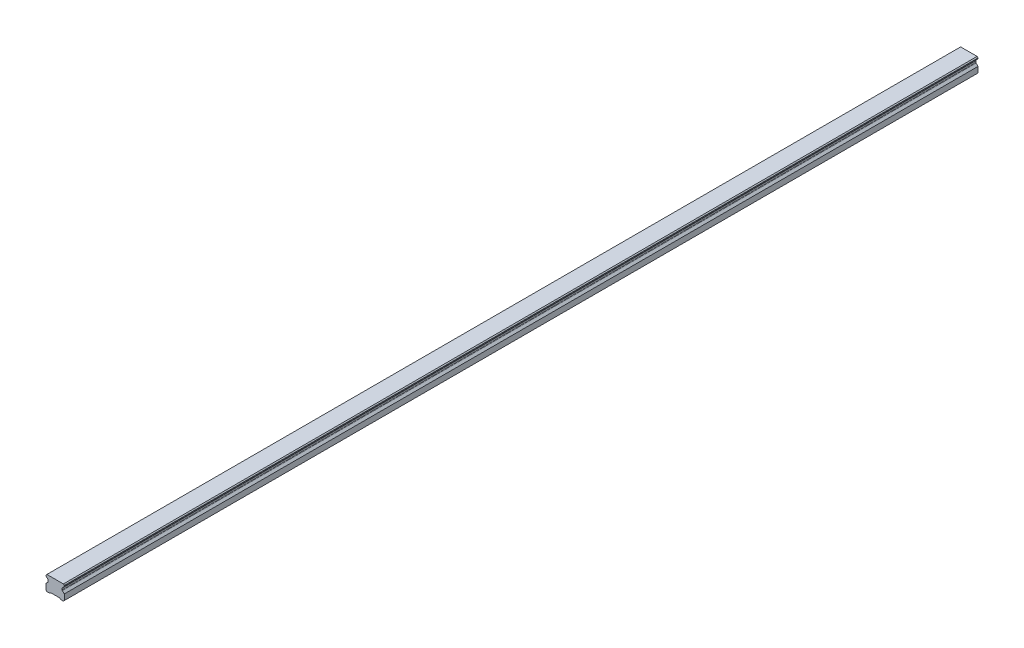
ISO-10303-21;
HEADER;
FILE_DESCRIPTION(('STEP AP214'),'2;1');
FILE_NAME('part.step','',(''),(''),'','','');
FILE_SCHEMA(('AUTOMOTIVE_DESIGN { 1 0 10303 214 1 1 1 1 }'));
ENDSEC;
DATA;
#1=APPLICATION_CONTEXT('core data for automotive mechanical design processes');
#2=APPLICATION_PROTOCOL_DEFINITION('international standard','automotive_design',2000,#1);
#3=PRODUCT_CONTEXT('',#1,'mechanical');
#4=PRODUCT('Part','Part','',(#3));
#5=PRODUCT_RELATED_PRODUCT_CATEGORY('part','',(#4));
#6=PRODUCT_DEFINITION_FORMATION('','',#4);
#7=PRODUCT_DEFINITION_CONTEXT('part definition',#1,'design');
#8=PRODUCT_DEFINITION('design','',#6,#7);
#9=PRODUCT_DEFINITION_SHAPE('','',#8);
#10=(LENGTH_UNIT() NAMED_UNIT(*) SI_UNIT(.MILLI.,.METRE.));
#11=(NAMED_UNIT(*) PLANE_ANGLE_UNIT() SI_UNIT($,.RADIAN.));
#12=(NAMED_UNIT(*) SI_UNIT($,.STERADIAN.) SOLID_ANGLE_UNIT());
#13=UNCERTAINTY_MEASURE_WITH_UNIT(LENGTH_MEASURE(1.E-05),#10,'distance_accuracy_value','');
#14=(GEOMETRIC_REPRESENTATION_CONTEXT(3) GLOBAL_UNCERTAINTY_ASSIGNED_CONTEXT((#13)) GLOBAL_UNIT_ASSIGNED_CONTEXT((#10,
#11,#12)) REPRESENTATION_CONTEXT('',''));
#15=CARTESIAN_POINT('',(0.,0.,0.));
#16=DIRECTION('',(0.,0.,1.));
#17=DIRECTION('',(1.,0.,0.));
#18=AXIS2_PLACEMENT_3D('',#15,#16,#17);
#19=CARTESIAN_POINT('',(0.,11.,-480.));
#20=DIRECTION('',(0.,-1.,0.));
#21=DIRECTION('',(0.,0.,-1.));
#22=AXIS2_PLACEMENT_3D('',#19,#20,#21);
#23=PLANE('',#22);
#24=CARTESIAN_POINT('',(0.,11.,-480.));
#25=DIRECTION('',(0.,-1.,0.));
#26=DIRECTION('',(0.,0.,-1.));
#27=AXIS2_PLACEMENT_3D('',#24,#25,#26);
#28=CIRCLE('',#27,2.5);
#29=CARTESIAN_POINT('',(0.,11.,-482.5));
#30=VERTEX_POINT('',#29);
#31=EDGE_CURVE('E42',#30,#30,#28,.T.);
#32=ORIENTED_EDGE('',*,*,#31,.F.);
#33=EDGE_LOOP('',(#32));
#34=FACE_BOUND('',#33,.T.);
#35=CARTESIAN_POINT('',(0.,11.,-480.));
#36=DIRECTION('',(0.,-1.,0.));
#37=DIRECTION('',(0.,0.,-1.));
#38=AXIS2_PLACEMENT_3D('',#35,#36,#37);
#39=CIRCLE('',#38,3.);
#40=CARTESIAN_POINT('',(0.,11.,-483.));
#41=VERTEX_POINT('',#40);
#42=EDGE_CURVE('E11',#41,#41,#39,.T.);
#43=ORIENTED_EDGE('',*,*,#42,.T.);
#44=EDGE_LOOP('',(#43));
#45=FACE_BOUND('',#44,.T.);
#46=ADVANCED_FACE('F39',(#34,#45),#23,.T.);
#47=CARTESIAN_POINT('',(0.,11.,-480.));
#48=DIRECTION('',(0.,-1.,0.));
#49=DIRECTION('',(0.,0.,-1.));
#50=AXIS2_PLACEMENT_3D('',#47,#48,#49);
#51=CYLINDRICAL_SURFACE('',#50,3.);
#52=ORIENTED_EDGE('',*,*,#42,.F.);
#53=EDGE_LOOP('',(#52));
#54=FACE_BOUND('',#53,.T.);
#55=CARTESIAN_POINT('',(0.,1.,-480.));
#56=DIRECTION('',(0.,-1.,0.));
#57=DIRECTION('',(0.,0.,-1.));
#58=AXIS2_PLACEMENT_3D('',#55,#56,#57);
#59=CIRCLE('',#58,3.);
#60=CARTESIAN_POINT('',(0.,1.,-483.));
#61=VERTEX_POINT('',#60);
#62=EDGE_CURVE('E48',#61,#61,#59,.T.);
#63=ORIENTED_EDGE('',*,*,#62,.T.);
#64=EDGE_LOOP('',(#63));
#65=FACE_BOUND('',#64,.T.);
#66=ADVANCED_FACE('F766',(#54,#65),#51,.F.);
#67=CARTESIAN_POINT('',(0.,11.,-420.));
#68=DIRECTION('',(0.,-1.,0.));
#69=DIRECTION('',(0.,0.,-1.));
#70=AXIS2_PLACEMENT_3D('',#67,#68,#69);
#71=PLANE('',#70);
#72=CARTESIAN_POINT('',(0.,11.,-420.));
#73=DIRECTION('',(0.,-1.,0.));
#74=DIRECTION('',(0.,0.,-1.));
#75=AXIS2_PLACEMENT_3D('',#72,#73,#74);
#76=CIRCLE('',#75,2.5);
#77=CARTESIAN_POINT('',(0.,11.,-422.5));
#78=VERTEX_POINT('',#77);
#79=EDGE_CURVE('E752',#78,#78,#76,.T.);
#80=ORIENTED_EDGE('',*,*,#79,.F.);
#81=EDGE_LOOP('',(#80));
#82=FACE_BOUND('',#81,.T.);
#83=CARTESIAN_POINT('',(0.,11.,-420.));
#84=DIRECTION('',(0.,-1.,0.));
#85=DIRECTION('',(0.,0.,-1.));
#86=AXIS2_PLACEMENT_3D('',#83,#84,#85);
#87=CIRCLE('',#86,3.);
#88=CARTESIAN_POINT('',(0.,11.,-423.));
#89=VERTEX_POINT('',#88);
#90=EDGE_CURVE('E695',#89,#89,#87,.T.);
#91=ORIENTED_EDGE('',*,*,#90,.T.);
#92=EDGE_LOOP('',(#91));
#93=FACE_BOUND('',#92,.T.);
#94=ADVANCED_FACE('F771',(#82,#93),#71,.T.);
#95=CARTESIAN_POINT('',(0.,11.,-420.));
#96=DIRECTION('',(0.,-1.,0.));
#97=DIRECTION('',(0.,0.,-1.));
#98=AXIS2_PLACEMENT_3D('',#95,#96,#97);
#99=CYLINDRICAL_SURFACE('',#98,3.);
#100=ORIENTED_EDGE('',*,*,#90,.F.);
#101=EDGE_LOOP('',(#100));
#102=FACE_BOUND('',#101,.T.);
#103=CARTESIAN_POINT('',(0.,1.,-420.));
#104=DIRECTION('',(0.,-1.,0.));
#105=DIRECTION('',(0.,0.,-1.));
#106=AXIS2_PLACEMENT_3D('',#103,#104,#105);
#107=CIRCLE('',#106,3.);
#108=CARTESIAN_POINT('',(0.,1.,-423.));
#109=VERTEX_POINT('',#108);
#110=EDGE_CURVE('E691',#109,#109,#107,.T.);
#111=ORIENTED_EDGE('',*,*,#110,.T.);
#112=EDGE_LOOP('',(#111));
#113=FACE_BOUND('',#112,.T.);
#114=ADVANCED_FACE('F978',(#102,#113),#99,.F.);
#115=CARTESIAN_POINT('',(0.,11.,-360.));
#116=DIRECTION('',(0.,-1.,0.));
#117=DIRECTION('',(0.,0.,-1.));
#118=AXIS2_PLACEMENT_3D('',#115,#116,#117);
#119=PLANE('',#118);
#120=CARTESIAN_POINT('',(0.,11.,-360.));
#121=DIRECTION('',(0.,-1.,0.));
#122=DIRECTION('',(0.,0.,-1.));
#123=AXIS2_PLACEMENT_3D('',#120,#121,#122);
#124=CIRCLE('',#123,2.5);
#125=CARTESIAN_POINT('',(0.,11.,-362.5));
#126=VERTEX_POINT('',#125);
#127=EDGE_CURVE('E749',#126,#126,#124,.T.);
#128=ORIENTED_EDGE('',*,*,#127,.F.);
#129=EDGE_LOOP('',(#128));
#130=FACE_BOUND('',#129,.T.);
#131=CARTESIAN_POINT('',(0.,11.,-360.));
#132=DIRECTION('',(0.,-1.,0.));
#133=DIRECTION('',(0.,0.,-1.));
#134=AXIS2_PLACEMENT_3D('',#131,#132,#133);
#135=CIRCLE('',#134,3.);
#136=CARTESIAN_POINT('',(0.,11.,-363.));
#137=VERTEX_POINT('',#136);
#138=EDGE_CURVE('E687',#137,#137,#135,.T.);
#139=ORIENTED_EDGE('',*,*,#138,.T.);
#140=EDGE_LOOP('',(#139));
#141=FACE_BOUND('',#140,.T.);
#142=ADVANCED_FACE('F974',(#130,#141),#119,.T.);
#143=CARTESIAN_POINT('',(0.,11.,-360.));
#144=DIRECTION('',(0.,-1.,0.));
#145=DIRECTION('',(0.,0.,-1.));
#146=AXIS2_PLACEMENT_3D('',#143,#144,#145);
#147=CYLINDRICAL_SURFACE('',#146,3.);
#148=ORIENTED_EDGE('',*,*,#138,.F.);
#149=EDGE_LOOP('',(#148));
#150=FACE_BOUND('',#149,.T.);
#151=CARTESIAN_POINT('',(0.,1.,-360.));
#152=DIRECTION('',(0.,-1.,0.));
#153=DIRECTION('',(0.,0.,-1.));
#154=AXIS2_PLACEMENT_3D('',#151,#152,#153);
#155=CIRCLE('',#154,3.);
#156=CARTESIAN_POINT('',(0.,1.,-363.));
#157=VERTEX_POINT('',#156);
#158=EDGE_CURVE('E683',#157,#157,#155,.T.);
#159=ORIENTED_EDGE('',*,*,#158,.T.);
#160=EDGE_LOOP('',(#159));
#161=FACE_BOUND('',#160,.T.);
#162=ADVANCED_FACE('F970',(#150,#161),#147,.F.);
#163=CARTESIAN_POINT('',(0.,11.,-300.));
#164=DIRECTION('',(0.,-1.,0.));
#165=DIRECTION('',(0.,0.,-1.));
#166=AXIS2_PLACEMENT_3D('',#163,#164,#165);
#167=PLANE('',#166);
#168=CARTESIAN_POINT('',(0.,11.,-300.));
#169=DIRECTION('',(0.,-1.,0.));
#170=DIRECTION('',(0.,0.,-1.));
#171=AXIS2_PLACEMENT_3D('',#168,#169,#170);
#172=CIRCLE('',#171,2.5);
#173=CARTESIAN_POINT('',(0.,11.,-302.5));
#174=VERTEX_POINT('',#173);
#175=EDGE_CURVE('E745',#174,#174,#172,.T.);
#176=ORIENTED_EDGE('',*,*,#175,.F.);
#177=EDGE_LOOP('',(#176));
#178=FACE_BOUND('',#177,.T.);
#179=CARTESIAN_POINT('',(0.,11.,-300.));
#180=DIRECTION('',(0.,-1.,0.));
#181=DIRECTION('',(0.,0.,-1.));
#182=AXIS2_PLACEMENT_3D('',#179,#180,#181);
#183=CIRCLE('',#182,3.);
#184=CARTESIAN_POINT('',(0.,11.,-303.));
#185=VERTEX_POINT('',#184);
#186=EDGE_CURVE('E679',#185,#185,#183,.T.);
#187=ORIENTED_EDGE('',*,*,#186,.T.);
#188=EDGE_LOOP('',(#187));
#189=FACE_BOUND('',#188,.T.);
#190=ADVANCED_FACE('F966',(#178,#189),#167,.T.);
#191=CARTESIAN_POINT('',(0.,11.,-300.));
#192=DIRECTION('',(0.,-1.,0.));
#193=DIRECTION('',(0.,0.,-1.));
#194=AXIS2_PLACEMENT_3D('',#191,#192,#193);
#195=CYLINDRICAL_SURFACE('',#194,3.);
#196=ORIENTED_EDGE('',*,*,#186,.F.);
#197=EDGE_LOOP('',(#196));
#198=FACE_BOUND('',#197,.T.);
#199=CARTESIAN_POINT('',(0.,1.,-300.));
#200=DIRECTION('',(0.,-1.,0.));
#201=DIRECTION('',(0.,0.,-1.));
#202=AXIS2_PLACEMENT_3D('',#199,#200,#201);
#203=CIRCLE('',#202,3.);
#204=CARTESIAN_POINT('',(0.,1.,-303.));
#205=VERTEX_POINT('',#204);
#206=EDGE_CURVE('E675',#205,#205,#203,.T.);
#207=ORIENTED_EDGE('',*,*,#206,.T.);
#208=EDGE_LOOP('',(#207));
#209=FACE_BOUND('',#208,.T.);
#210=ADVANCED_FACE('F962',(#198,#209),#195,.F.);
#211=CARTESIAN_POINT('',(0.,11.,-240.));
#212=DIRECTION('',(0.,-1.,0.));
#213=DIRECTION('',(0.,0.,-1.));
#214=AXIS2_PLACEMENT_3D('',#211,#212,#213);
#215=PLANE('',#214);
#216=CARTESIAN_POINT('',(0.,11.,-240.));
#217=DIRECTION('',(0.,-1.,0.));
#218=DIRECTION('',(0.,0.,-1.));
#219=AXIS2_PLACEMENT_3D('',#216,#217,#218);
#220=CIRCLE('',#219,2.5);
#221=CARTESIAN_POINT('',(0.,11.,-242.5));
#222=VERTEX_POINT('',#221);
#223=EDGE_CURVE('E741',#222,#222,#220,.T.);
#224=ORIENTED_EDGE('',*,*,#223,.F.);
#225=EDGE_LOOP('',(#224));
#226=FACE_BOUND('',#225,.T.);
#227=CARTESIAN_POINT('',(0.,11.,-240.));
#228=DIRECTION('',(0.,-1.,0.));
#229=DIRECTION('',(0.,0.,-1.));
#230=AXIS2_PLACEMENT_3D('',#227,#228,#229);
#231=CIRCLE('',#230,3.);
#232=CARTESIAN_POINT('',(0.,11.,-243.));
#233=VERTEX_POINT('',#232);
#234=EDGE_CURVE('E671',#233,#233,#231,.T.);
#235=ORIENTED_EDGE('',*,*,#234,.T.);
#236=EDGE_LOOP('',(#235));
#237=FACE_BOUND('',#236,.T.);
#238=ADVANCED_FACE('F958',(#226,#237),#215,.T.);
#239=CARTESIAN_POINT('',(0.,11.,-240.));
#240=DIRECTION('',(0.,-1.,0.));
#241=DIRECTION('',(0.,0.,-1.));
#242=AXIS2_PLACEMENT_3D('',#239,#240,#241);
#243=CYLINDRICAL_SURFACE('',#242,3.);
#244=ORIENTED_EDGE('',*,*,#234,.F.);
#245=EDGE_LOOP('',(#244));
#246=FACE_BOUND('',#245,.T.);
#247=CARTESIAN_POINT('',(0.,1.,-240.));
#248=DIRECTION('',(0.,-1.,0.));
#249=DIRECTION('',(0.,0.,-1.));
#250=AXIS2_PLACEMENT_3D('',#247,#248,#249);
#251=CIRCLE('',#250,3.);
#252=CARTESIAN_POINT('',(0.,1.,-243.));
#253=VERTEX_POINT('',#252);
#254=EDGE_CURVE('E667',#253,#253,#251,.T.);
#255=ORIENTED_EDGE('',*,*,#254,.T.);
#256=EDGE_LOOP('',(#255));
#257=FACE_BOUND('',#256,.T.);
#258=ADVANCED_FACE('F954',(#246,#257),#243,.F.);
#259=CARTESIAN_POINT('',(0.,11.,-180.));
#260=DIRECTION('',(0.,-1.,0.));
#261=DIRECTION('',(0.,0.,-1.));
#262=AXIS2_PLACEMENT_3D('',#259,#260,#261);
#263=PLANE('',#262);
#264=CARTESIAN_POINT('',(0.,11.,-180.));
#265=DIRECTION('',(0.,-1.,0.));
#266=DIRECTION('',(0.,0.,-1.));
#267=AXIS2_PLACEMENT_3D('',#264,#265,#266);
#268=CIRCLE('',#267,2.5);
#269=CARTESIAN_POINT('',(0.,11.,-182.5));
#270=VERTEX_POINT('',#269);
#271=EDGE_CURVE('E737',#270,#270,#268,.T.);
#272=ORIENTED_EDGE('',*,*,#271,.F.);
#273=EDGE_LOOP('',(#272));
#274=FACE_BOUND('',#273,.T.);
#275=CARTESIAN_POINT('',(0.,11.,-180.));
#276=DIRECTION('',(0.,-1.,0.));
#277=DIRECTION('',(0.,0.,-1.));
#278=AXIS2_PLACEMENT_3D('',#275,#276,#277);
#279=CIRCLE('',#278,3.);
#280=CARTESIAN_POINT('',(0.,11.,-183.));
#281=VERTEX_POINT('',#280);
#282=EDGE_CURVE('E663',#281,#281,#279,.T.);
#283=ORIENTED_EDGE('',*,*,#282,.T.);
#284=EDGE_LOOP('',(#283));
#285=FACE_BOUND('',#284,.T.);
#286=ADVANCED_FACE('F950',(#274,#285),#263,.T.);
#287=CARTESIAN_POINT('',(0.,11.,-180.));
#288=DIRECTION('',(0.,-1.,0.));
#289=DIRECTION('',(0.,0.,-1.));
#290=AXIS2_PLACEMENT_3D('',#287,#288,#289);
#291=CYLINDRICAL_SURFACE('',#290,3.);
#292=ORIENTED_EDGE('',*,*,#282,.F.);
#293=EDGE_LOOP('',(#292));
#294=FACE_BOUND('',#293,.T.);
#295=CARTESIAN_POINT('',(0.,1.,-180.));
#296=DIRECTION('',(0.,-1.,0.));
#297=DIRECTION('',(0.,0.,-1.));
#298=AXIS2_PLACEMENT_3D('',#295,#296,#297);
#299=CIRCLE('',#298,3.);
#300=CARTESIAN_POINT('',(0.,1.,-183.));
#301=VERTEX_POINT('',#300);
#302=EDGE_CURVE('E659',#301,#301,#299,.T.);
#303=ORIENTED_EDGE('',*,*,#302,.T.);
#304=EDGE_LOOP('',(#303));
#305=FACE_BOUND('',#304,.T.);
#306=ADVANCED_FACE('F946',(#294,#305),#291,.F.);
#307=CARTESIAN_POINT('',(0.,11.,-120.));
#308=DIRECTION('',(0.,-1.,0.));
#309=DIRECTION('',(0.,0.,-1.));
#310=AXIS2_PLACEMENT_3D('',#307,#308,#309);
#311=PLANE('',#310);
#312=CARTESIAN_POINT('',(0.,11.,-120.));
#313=DIRECTION('',(0.,-1.,0.));
#314=DIRECTION('',(0.,0.,-1.));
#315=AXIS2_PLACEMENT_3D('',#312,#313,#314);
#316=CIRCLE('',#315,2.5);
#317=CARTESIAN_POINT('',(0.,11.,-122.5));
#318=VERTEX_POINT('',#317);
#319=EDGE_CURVE('E733',#318,#318,#316,.T.);
#320=ORIENTED_EDGE('',*,*,#319,.F.);
#321=EDGE_LOOP('',(#320));
#322=FACE_BOUND('',#321,.T.);
#323=CARTESIAN_POINT('',(0.,11.,-120.));
#324=DIRECTION('',(0.,-1.,0.));
#325=DIRECTION('',(0.,0.,-1.));
#326=AXIS2_PLACEMENT_3D('',#323,#324,#325);
#327=CIRCLE('',#326,3.);
#328=CARTESIAN_POINT('',(0.,11.,-123.));
#329=VERTEX_POINT('',#328);
#330=EDGE_CURVE('E655',#329,#329,#327,.T.);
#331=ORIENTED_EDGE('',*,*,#330,.T.);
#332=EDGE_LOOP('',(#331));
#333=FACE_BOUND('',#332,.T.);
#334=ADVANCED_FACE('F942',(#322,#333),#311,.T.);
#335=CARTESIAN_POINT('',(0.,11.,-120.));
#336=DIRECTION('',(0.,-1.,0.));
#337=DIRECTION('',(0.,0.,-1.));
#338=AXIS2_PLACEMENT_3D('',#335,#336,#337);
#339=CYLINDRICAL_SURFACE('',#338,3.);
#340=ORIENTED_EDGE('',*,*,#330,.F.);
#341=EDGE_LOOP('',(#340));
#342=FACE_BOUND('',#341,.T.);
#343=CARTESIAN_POINT('',(0.,1.,-120.));
#344=DIRECTION('',(0.,-1.,0.));
#345=DIRECTION('',(0.,0.,-1.));
#346=AXIS2_PLACEMENT_3D('',#343,#344,#345);
#347=CIRCLE('',#346,3.);
#348=CARTESIAN_POINT('',(0.,1.,-123.));
#349=VERTEX_POINT('',#348);
#350=EDGE_CURVE('E651',#349,#349,#347,.T.);
#351=ORIENTED_EDGE('',*,*,#350,.T.);
#352=EDGE_LOOP('',(#351));
#353=FACE_BOUND('',#352,.T.);
#354=ADVANCED_FACE('F938',(#342,#353),#339,.F.);
#355=CARTESIAN_POINT('',(0.,11.,-60.0000000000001));
#356=DIRECTION('',(0.,-1.,0.));
#357=DIRECTION('',(0.,0.,-1.));
#358=AXIS2_PLACEMENT_3D('',#355,#356,#357);
#359=PLANE('',#358);
#360=CARTESIAN_POINT('',(0.,11.,-60.0000000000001));
#361=DIRECTION('',(0.,-1.,0.));
#362=DIRECTION('',(0.,0.,-1.));
#363=AXIS2_PLACEMENT_3D('',#360,#361,#362);
#364=CIRCLE('',#363,2.5);
#365=CARTESIAN_POINT('',(0.,11.,-62.5000000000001));
#366=VERTEX_POINT('',#365);
#367=EDGE_CURVE('E729',#366,#366,#364,.T.);
#368=ORIENTED_EDGE('',*,*,#367,.F.);
#369=EDGE_LOOP('',(#368));
#370=FACE_BOUND('',#369,.T.);
#371=CARTESIAN_POINT('',(0.,11.,-60.0000000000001));
#372=DIRECTION('',(0.,-1.,0.));
#373=DIRECTION('',(0.,0.,-1.));
#374=AXIS2_PLACEMENT_3D('',#371,#372,#373);
#375=CIRCLE('',#374,3.);
#376=CARTESIAN_POINT('',(0.,11.,-63.0000000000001));
#377=VERTEX_POINT('',#376);
#378=EDGE_CURVE('E647',#377,#377,#375,.T.);
#379=ORIENTED_EDGE('',*,*,#378,.T.);
#380=EDGE_LOOP('',(#379));
#381=FACE_BOUND('',#380,.T.);
#382=ADVANCED_FACE('F934',(#370,#381),#359,.T.);
#383=CARTESIAN_POINT('',(0.,11.,-60.0000000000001));
#384=DIRECTION('',(0.,-1.,0.));
#385=DIRECTION('',(0.,0.,-1.));
#386=AXIS2_PLACEMENT_3D('',#383,#384,#385);
#387=CYLINDRICAL_SURFACE('',#386,3.);
#388=ORIENTED_EDGE('',*,*,#378,.F.);
#389=EDGE_LOOP('',(#388));
#390=FACE_BOUND('',#389,.T.);
#391=CARTESIAN_POINT('',(0.,1.,-60.0000000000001));
#392=DIRECTION('',(0.,-1.,0.));
#393=DIRECTION('',(0.,0.,-1.));
#394=AXIS2_PLACEMENT_3D('',#391,#392,#393);
#395=CIRCLE('',#394,3.);
#396=CARTESIAN_POINT('',(0.,1.,-63.0000000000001));
#397=VERTEX_POINT('',#396);
#398=EDGE_CURVE('E643',#397,#397,#395,.T.);
#399=ORIENTED_EDGE('',*,*,#398,.T.);
#400=EDGE_LOOP('',(#399));
#401=FACE_BOUND('',#400,.T.);
#402=ADVANCED_FACE('F930',(#390,#401),#387,.F.);
#403=CARTESIAN_POINT('',(0.,11.,0.));
#404=DIRECTION('',(0.,-1.,0.));
#405=DIRECTION('',(0.,0.,-1.));
#406=AXIS2_PLACEMENT_3D('',#403,#404,#405);
#407=PLANE('',#406);
#408=CARTESIAN_POINT('',(0.,11.,0.));
#409=DIRECTION('',(0.,-1.,0.));
#410=DIRECTION('',(0.,0.,-1.));
#411=AXIS2_PLACEMENT_3D('',#408,#409,#410);
#412=CIRCLE('',#411,2.5);
#413=CARTESIAN_POINT('',(0.,11.,-2.5));
#414=VERTEX_POINT('',#413);
#415=EDGE_CURVE('E725',#414,#414,#412,.T.);
#416=ORIENTED_EDGE('',*,*,#415,.F.);
#417=EDGE_LOOP('',(#416));
#418=FACE_BOUND('',#417,.T.);
#419=CARTESIAN_POINT('',(0.,11.,0.));
#420=DIRECTION('',(0.,-1.,0.));
#421=DIRECTION('',(0.,0.,-1.));
#422=AXIS2_PLACEMENT_3D('',#419,#420,#421);
#423=CIRCLE('',#422,3.);
#424=CARTESIAN_POINT('',(0.,11.,-3.));
#425=VERTEX_POINT('',#424);
#426=EDGE_CURVE('E639',#425,#425,#423,.T.);
#427=ORIENTED_EDGE('',*,*,#426,.T.);
#428=EDGE_LOOP('',(#427));
#429=FACE_BOUND('',#428,.T.);
#430=ADVANCED_FACE('F926',(#418,#429),#407,.T.);
#431=CARTESIAN_POINT('',(0.,11.,0.));
#432=DIRECTION('',(0.,-1.,0.));
#433=DIRECTION('',(0.,0.,-1.));
#434=AXIS2_PLACEMENT_3D('',#431,#432,#433);
#435=CYLINDRICAL_SURFACE('',#434,3.);
#436=ORIENTED_EDGE('',*,*,#426,.F.);
#437=EDGE_LOOP('',(#436));
#438=FACE_BOUND('',#437,.T.);
#439=CARTESIAN_POINT('',(0.,1.,0.));
#440=DIRECTION('',(0.,-1.,0.));
#441=DIRECTION('',(0.,0.,-1.));
#442=AXIS2_PLACEMENT_3D('',#439,#440,#441);
#443=CIRCLE('',#442,3.);
#444=CARTESIAN_POINT('',(0.,1.,-3.));
#445=VERTEX_POINT('',#444);
#446=EDGE_CURVE('E635',#445,#445,#443,.T.);
#447=ORIENTED_EDGE('',*,*,#446,.T.);
#448=EDGE_LOOP('',(#447));
#449=FACE_BOUND('',#448,.T.);
#450=ADVANCED_FACE('F922',(#438,#449),#435,.F.);
#451=CARTESIAN_POINT('',(0.,11.,60.));
#452=DIRECTION('',(0.,-1.,0.));
#453=DIRECTION('',(0.,0.,-1.));
#454=AXIS2_PLACEMENT_3D('',#451,#452,#453);
#455=PLANE('',#454);
#456=CARTESIAN_POINT('',(0.,11.,60.));
#457=DIRECTION('',(0.,-1.,0.));
#458=DIRECTION('',(0.,0.,-1.));
#459=AXIS2_PLACEMENT_3D('',#456,#457,#458);
#460=CIRCLE('',#459,2.5);
#461=CARTESIAN_POINT('',(0.,11.,57.5));
#462=VERTEX_POINT('',#461);
#463=EDGE_CURVE('E721',#462,#462,#460,.T.);
#464=ORIENTED_EDGE('',*,*,#463,.F.);
#465=EDGE_LOOP('',(#464));
#466=FACE_BOUND('',#465,.T.);
#467=CARTESIAN_POINT('',(0.,11.,60.));
#468=DIRECTION('',(0.,-1.,0.));
#469=DIRECTION('',(0.,0.,-1.));
#470=AXIS2_PLACEMENT_3D('',#467,#468,#469);
#471=CIRCLE('',#470,3.);
#472=CARTESIAN_POINT('',(0.,11.,57.));
#473=VERTEX_POINT('',#472);
#474=EDGE_CURVE('E631',#473,#473,#471,.T.);
#475=ORIENTED_EDGE('',*,*,#474,.T.);
#476=EDGE_LOOP('',(#475));
#477=FACE_BOUND('',#476,.T.);
#478=ADVANCED_FACE('F918',(#466,#477),#455,.T.);
#479=CARTESIAN_POINT('',(0.,11.,60.));
#480=DIRECTION('',(0.,-1.,0.));
#481=DIRECTION('',(0.,0.,-1.));
#482=AXIS2_PLACEMENT_3D('',#479,#480,#481);
#483=CYLINDRICAL_SURFACE('',#482,3.);
#484=ORIENTED_EDGE('',*,*,#474,.F.);
#485=EDGE_LOOP('',(#484));
#486=FACE_BOUND('',#485,.T.);
#487=CARTESIAN_POINT('',(0.,1.,60.));
#488=DIRECTION('',(0.,-1.,0.));
#489=DIRECTION('',(0.,0.,-1.));
#490=AXIS2_PLACEMENT_3D('',#487,#488,#489);
#491=CIRCLE('',#490,3.);
#492=CARTESIAN_POINT('',(0.,1.,57.));
#493=VERTEX_POINT('',#492);
#494=EDGE_CURVE('E627',#493,#493,#491,.T.);
#495=ORIENTED_EDGE('',*,*,#494,.T.);
#496=EDGE_LOOP('',(#495));
#497=FACE_BOUND('',#496,.T.);
#498=ADVANCED_FACE('F914',(#486,#497),#483,.F.);
#499=CARTESIAN_POINT('',(0.,11.,120.));
#500=DIRECTION('',(0.,-1.,0.));
#501=DIRECTION('',(0.,0.,-1.));
#502=AXIS2_PLACEMENT_3D('',#499,#500,#501);
#503=PLANE('',#502);
#504=CARTESIAN_POINT('',(0.,11.,120.));
#505=DIRECTION('',(0.,-1.,0.));
#506=DIRECTION('',(0.,0.,-1.));
#507=AXIS2_PLACEMENT_3D('',#504,#505,#506);
#508=CIRCLE('',#507,2.5);
#509=CARTESIAN_POINT('',(0.,11.,117.5));
#510=VERTEX_POINT('',#509);
#511=EDGE_CURVE('E717',#510,#510,#508,.T.);
#512=ORIENTED_EDGE('',*,*,#511,.F.);
#513=EDGE_LOOP('',(#512));
#514=FACE_BOUND('',#513,.T.);
#515=CARTESIAN_POINT('',(0.,11.,120.));
#516=DIRECTION('',(0.,-1.,0.));
#517=DIRECTION('',(0.,0.,-1.));
#518=AXIS2_PLACEMENT_3D('',#515,#516,#517);
#519=CIRCLE('',#518,3.);
#520=CARTESIAN_POINT('',(0.,11.,117.));
#521=VERTEX_POINT('',#520);
#522=EDGE_CURVE('E623',#521,#521,#519,.T.);
#523=ORIENTED_EDGE('',*,*,#522,.T.);
#524=EDGE_LOOP('',(#523));
#525=FACE_BOUND('',#524,.T.);
#526=ADVANCED_FACE('F910',(#514,#525),#503,.T.);
#527=CARTESIAN_POINT('',(0.,11.,120.));
#528=DIRECTION('',(0.,-1.,0.));
#529=DIRECTION('',(0.,0.,-1.));
#530=AXIS2_PLACEMENT_3D('',#527,#528,#529);
#531=CYLINDRICAL_SURFACE('',#530,3.);
#532=ORIENTED_EDGE('',*,*,#522,.F.);
#533=EDGE_LOOP('',(#532));
#534=FACE_BOUND('',#533,.T.);
#535=CARTESIAN_POINT('',(0.,1.,120.));
#536=DIRECTION('',(0.,-1.,0.));
#537=DIRECTION('',(0.,0.,-1.));
#538=AXIS2_PLACEMENT_3D('',#535,#536,#537);
#539=CIRCLE('',#538,3.);
#540=CARTESIAN_POINT('',(0.,1.,117.));
#541=VERTEX_POINT('',#540);
#542=EDGE_CURVE('E619',#541,#541,#539,.T.);
#543=ORIENTED_EDGE('',*,*,#542,.T.);
#544=EDGE_LOOP('',(#543));
#545=FACE_BOUND('',#544,.T.);
#546=ADVANCED_FACE('F906',(#534,#545),#531,.F.);
#547=CARTESIAN_POINT('',(0.,11.,180.));
#548=DIRECTION('',(0.,-1.,0.));
#549=DIRECTION('',(0.,0.,-1.));
#550=AXIS2_PLACEMENT_3D('',#547,#548,#549);
#551=PLANE('',#550);
#552=CARTESIAN_POINT('',(0.,11.,180.));
#553=DIRECTION('',(0.,-1.,0.));
#554=DIRECTION('',(0.,0.,-1.));
#555=AXIS2_PLACEMENT_3D('',#552,#553,#554);
#556=CIRCLE('',#555,2.5);
#557=CARTESIAN_POINT('',(0.,11.,177.5));
#558=VERTEX_POINT('',#557);
#559=EDGE_CURVE('E713',#558,#558,#556,.T.);
#560=ORIENTED_EDGE('',*,*,#559,.F.);
#561=EDGE_LOOP('',(#560));
#562=FACE_BOUND('',#561,.T.);
#563=CARTESIAN_POINT('',(0.,11.,180.));
#564=DIRECTION('',(0.,-1.,0.));
#565=DIRECTION('',(0.,0.,-1.));
#566=AXIS2_PLACEMENT_3D('',#563,#564,#565);
#567=CIRCLE('',#566,3.);
#568=CARTESIAN_POINT('',(0.,11.,177.));
#569=VERTEX_POINT('',#568);
#570=EDGE_CURVE('E615',#569,#569,#567,.T.);
#571=ORIENTED_EDGE('',*,*,#570,.T.);
#572=EDGE_LOOP('',(#571));
#573=FACE_BOUND('',#572,.T.);
#574=ADVANCED_FACE('F902',(#562,#573),#551,.T.);
#575=CARTESIAN_POINT('',(0.,11.,180.));
#576=DIRECTION('',(0.,-1.,0.));
#577=DIRECTION('',(0.,0.,-1.));
#578=AXIS2_PLACEMENT_3D('',#575,#576,#577);
#579=CYLINDRICAL_SURFACE('',#578,3.);
#580=ORIENTED_EDGE('',*,*,#570,.F.);
#581=EDGE_LOOP('',(#580));
#582=FACE_BOUND('',#581,.T.);
#583=CARTESIAN_POINT('',(0.,1.,180.));
#584=DIRECTION('',(0.,-1.,0.));
#585=DIRECTION('',(0.,0.,-1.));
#586=AXIS2_PLACEMENT_3D('',#583,#584,#585);
#587=CIRCLE('',#586,3.);
#588=CARTESIAN_POINT('',(0.,1.,177.));
#589=VERTEX_POINT('',#588);
#590=EDGE_CURVE('E611',#589,#589,#587,.T.);
#591=ORIENTED_EDGE('',*,*,#590,.T.);
#592=EDGE_LOOP('',(#591));
#593=FACE_BOUND('',#592,.T.);
#594=ADVANCED_FACE('F898',(#582,#593),#579,.F.);
#595=CARTESIAN_POINT('',(0.,11.,240.));
#596=DIRECTION('',(0.,-1.,0.));
#597=DIRECTION('',(0.,0.,-1.));
#598=AXIS2_PLACEMENT_3D('',#595,#596,#597);
#599=PLANE('',#598);
#600=CARTESIAN_POINT('',(0.,11.,240.));
#601=DIRECTION('',(0.,-1.,0.));
#602=DIRECTION('',(0.,0.,-1.));
#603=AXIS2_PLACEMENT_3D('',#600,#601,#602);
#604=CIRCLE('',#603,2.5);
#605=CARTESIAN_POINT('',(0.,11.,237.5));
#606=VERTEX_POINT('',#605);
#607=EDGE_CURVE('E709',#606,#606,#604,.T.);
#608=ORIENTED_EDGE('',*,*,#607,.F.);
#609=EDGE_LOOP('',(#608));
#610=FACE_BOUND('',#609,.T.);
#611=CARTESIAN_POINT('',(0.,11.,240.));
#612=DIRECTION('',(0.,-1.,0.));
#613=DIRECTION('',(0.,0.,-1.));
#614=AXIS2_PLACEMENT_3D('',#611,#612,#613);
#615=CIRCLE('',#614,3.);
#616=CARTESIAN_POINT('',(0.,11.,237.));
#617=VERTEX_POINT('',#616);
#618=EDGE_CURVE('E607',#617,#617,#615,.T.);
#619=ORIENTED_EDGE('',*,*,#618,.T.);
#620=EDGE_LOOP('',(#619));
#621=FACE_BOUND('',#620,.T.);
#622=ADVANCED_FACE('F894',(#610,#621),#599,.T.);
#623=CARTESIAN_POINT('',(0.,11.,240.));
#624=DIRECTION('',(0.,-1.,0.));
#625=DIRECTION('',(0.,0.,-1.));
#626=AXIS2_PLACEMENT_3D('',#623,#624,#625);
#627=CYLINDRICAL_SURFACE('',#626,3.);
#628=ORIENTED_EDGE('',*,*,#618,.F.);
#629=EDGE_LOOP('',(#628));
#630=FACE_BOUND('',#629,.T.);
#631=CARTESIAN_POINT('',(0.,1.,240.));
#632=DIRECTION('',(0.,-1.,0.));
#633=DIRECTION('',(0.,0.,-1.));
#634=AXIS2_PLACEMENT_3D('',#631,#632,#633);
#635=CIRCLE('',#634,3.);
#636=CARTESIAN_POINT('',(0.,1.,237.));
#637=VERTEX_POINT('',#636);
#638=EDGE_CURVE('E603',#637,#637,#635,.T.);
#639=ORIENTED_EDGE('',*,*,#638,.T.);
#640=EDGE_LOOP('',(#639));
#641=FACE_BOUND('',#640,.T.);
#642=ADVANCED_FACE('F890',(#630,#641),#627,.F.);
#643=CARTESIAN_POINT('',(0.,11.,300.));
#644=DIRECTION('',(0.,-1.,0.));
#645=DIRECTION('',(0.,0.,-1.));
#646=AXIS2_PLACEMENT_3D('',#643,#644,#645);
#647=PLANE('',#646);
#648=CARTESIAN_POINT('',(0.,11.,300.));
#649=DIRECTION('',(0.,-1.,0.));
#650=DIRECTION('',(0.,0.,-1.));
#651=AXIS2_PLACEMENT_3D('',#648,#649,#650);
#652=CIRCLE('',#651,2.5);
#653=CARTESIAN_POINT('',(0.,11.,297.5));
#654=VERTEX_POINT('',#653);
#655=EDGE_CURVE('E705',#654,#654,#652,.T.);
#656=ORIENTED_EDGE('',*,*,#655,.F.);
#657=EDGE_LOOP('',(#656));
#658=FACE_BOUND('',#657,.T.);
#659=CARTESIAN_POINT('',(0.,11.,300.));
#660=DIRECTION('',(0.,-1.,0.));
#661=DIRECTION('',(0.,0.,-1.));
#662=AXIS2_PLACEMENT_3D('',#659,#660,#661);
#663=CIRCLE('',#662,3.);
#664=CARTESIAN_POINT('',(0.,11.,297.));
#665=VERTEX_POINT('',#664);
#666=EDGE_CURVE('E599',#665,#665,#663,.T.);
#667=ORIENTED_EDGE('',*,*,#666,.T.);
#668=EDGE_LOOP('',(#667));
#669=FACE_BOUND('',#668,.T.);
#670=ADVANCED_FACE('F886',(#658,#669),#647,.T.);
#671=CARTESIAN_POINT('',(0.,11.,300.));
#672=DIRECTION('',(0.,-1.,0.));
#673=DIRECTION('',(0.,0.,-1.));
#674=AXIS2_PLACEMENT_3D('',#671,#672,#673);
#675=CYLINDRICAL_SURFACE('',#674,3.);
#676=ORIENTED_EDGE('',*,*,#666,.F.);
#677=EDGE_LOOP('',(#676));
#678=FACE_BOUND('',#677,.T.);
#679=CARTESIAN_POINT('',(0.,1.,300.));
#680=DIRECTION('',(0.,-1.,0.));
#681=DIRECTION('',(0.,0.,-1.));
#682=AXIS2_PLACEMENT_3D('',#679,#680,#681);
#683=CIRCLE('',#682,3.);
#684=CARTESIAN_POINT('',(0.,1.,297.));
#685=VERTEX_POINT('',#684);
#686=EDGE_CURVE('E595',#685,#685,#683,.T.);
#687=ORIENTED_EDGE('',*,*,#686,.T.);
#688=EDGE_LOOP('',(#687));
#689=FACE_BOUND('',#688,.T.);
#690=ADVANCED_FACE('F882',(#678,#689),#675,.F.);
#691=CARTESIAN_POINT('',(0.,11.,360.));
#692=DIRECTION('',(0.,-1.,0.));
#693=DIRECTION('',(0.,0.,-1.));
#694=AXIS2_PLACEMENT_3D('',#691,#692,#693);
#695=PLANE('',#694);
#696=CARTESIAN_POINT('',(0.,11.,360.));
#697=DIRECTION('',(0.,-1.,0.));
#698=DIRECTION('',(0.,0.,-1.));
#699=AXIS2_PLACEMENT_3D('',#696,#697,#698);
#700=CIRCLE('',#699,2.5);
#701=CARTESIAN_POINT('',(0.,11.,357.5));
#702=VERTEX_POINT('',#701);
#703=EDGE_CURVE('E269',#702,#702,#700,.T.);
#704=ORIENTED_EDGE('',*,*,#703,.F.);
#705=EDGE_LOOP('',(#704));
#706=FACE_BOUND('',#705,.T.);
#707=CARTESIAN_POINT('',(0.,11.,360.));
#708=DIRECTION('',(0.,-1.,0.));
#709=DIRECTION('',(0.,0.,-1.));
#710=AXIS2_PLACEMENT_3D('',#707,#708,#709);
#711=CIRCLE('',#710,3.);
#712=CARTESIAN_POINT('',(0.,11.,357.));
#713=VERTEX_POINT('',#712);
#714=EDGE_CURVE('E591',#713,#713,#711,.T.);
#715=ORIENTED_EDGE('',*,*,#714,.T.);
#716=EDGE_LOOP('',(#715));
#717=FACE_BOUND('',#716,.T.);
#718=ADVANCED_FACE('F878',(#706,#717),#695,.T.);
#719=CARTESIAN_POINT('',(0.,11.,360.));
#720=DIRECTION('',(0.,-1.,0.));
#721=DIRECTION('',(0.,0.,-1.));
#722=AXIS2_PLACEMENT_3D('',#719,#720,#721);
#723=CYLINDRICAL_SURFACE('',#722,3.);
#724=ORIENTED_EDGE('',*,*,#714,.F.);
#725=EDGE_LOOP('',(#724));
#726=FACE_BOUND('',#725,.T.);
#727=CARTESIAN_POINT('',(0.,1.,360.));
#728=DIRECTION('',(0.,-1.,0.));
#729=DIRECTION('',(0.,0.,-1.));
#730=AXIS2_PLACEMENT_3D('',#727,#728,#729);
#731=CIRCLE('',#730,3.);
#732=CARTESIAN_POINT('',(0.,1.,357.));
#733=VERTEX_POINT('',#732);
#734=EDGE_CURVE('E587',#733,#733,#731,.T.);
#735=ORIENTED_EDGE('',*,*,#734,.T.);
#736=EDGE_LOOP('',(#735));
#737=FACE_BOUND('',#736,.T.);
#738=ADVANCED_FACE('F875',(#726,#737),#723,.F.);
#739=CARTESIAN_POINT('',(10.,0.,500.));
#740=DIRECTION('',(0.,1.,0.));
#741=DIRECTION('',(-1.,0.,0.));
#742=AXIS2_PLACEMENT_3D('',#739,#740,#741);
#743=PLANE('',#742);
#744=DIRECTION('',(1.,0.,0.));
#745=VECTOR('',#744,1.);
#746=CARTESIAN_POINT('',(10.,0.,-500.));
#747=LINE('',#746,#745);
#748=CARTESIAN_POINT('',(-9.,0.,-500.));
#749=VERTEX_POINT('',#748);
#750=CARTESIAN_POINT('',(-6.,0.,-500.));
#751=VERTEX_POINT('',#750);
#752=EDGE_CURVE('E470',#749,#751,#747,.T.);
#753=ORIENTED_EDGE('',*,*,#752,.T.);
#754=DIRECTION('',(0.,0.,1.));
#755=VECTOR('',#754,1.);
#756=CARTESIAN_POINT('',(-6.,0.,-500.));
#757=LINE('',#756,#755);
#758=CARTESIAN_POINT('',(-6.,0.,500.));
#759=VERTEX_POINT('',#758);
#760=EDGE_CURVE('E376',#751,#759,#757,.T.);
#761=ORIENTED_EDGE('',*,*,#760,.T.);
#762=DIRECTION('',(1.,0.,0.));
#763=VECTOR('',#762,1.);
#764=CARTESIAN_POINT('',(10.,0.,500.));
#765=LINE('',#764,#763);
#766=CARTESIAN_POINT('',(-9.,0.,500.));
#767=VERTEX_POINT('',#766);
#768=EDGE_CURVE('E451',#767,#759,#765,.T.);
#769=ORIENTED_EDGE('',*,*,#768,.F.);
#770=DIRECTION('',(0.,0.,-1.));
#771=VECTOR('',#770,1.);
#772=CARTESIAN_POINT('',(-9.,0.,500.));
#773=LINE('',#772,#771);
#774=EDGE_CURVE('E522',#767,#749,#773,.T.);
#775=ORIENTED_EDGE('',*,*,#774,.T.);
#776=EDGE_LOOP('',(#753,#761,#769,#775));
#777=FACE_BOUND('',#776,.T.);
#778=ADVANCED_FACE('F840',(#777),#743,.F.);
#779=CARTESIAN_POINT('',(-10.,16.3,500.));
#780=DIRECTION('',(1.,0.,0.));
#781=DIRECTION('',(0.,1.,0.));
#782=AXIS2_PLACEMENT_3D('',#779,#780,#781);
#783=PLANE('',#782);
#784=DIRECTION('',(0.,-1.,0.));
#785=VECTOR('',#784,1.);
#786=CARTESIAN_POINT('',(-10.,16.3,500.));
#787=LINE('',#786,#785);
#788=CARTESIAN_POINT('',(-10.,15.3,500.));
#789=VERTEX_POINT('',#788);
#790=CARTESIAN_POINT('',(-10.,14.3,500.));
#791=VERTEX_POINT('',#790);
#792=EDGE_CURVE('E445',#789,#791,#787,.T.);
#793=ORIENTED_EDGE('',*,*,#792,.F.);
#794=DIRECTION('',(0.,0.,-1.));
#795=VECTOR('',#794,1.);
#796=CARTESIAN_POINT('',(-10.,15.3,500.));
#797=LINE('',#796,#795);
#798=CARTESIAN_POINT('',(-10.,15.3,-500.));
#799=VERTEX_POINT('',#798);
#800=EDGE_CURVE('E464',#789,#799,#797,.T.);
#801=ORIENTED_EDGE('',*,*,#800,.T.);
#802=DIRECTION('',(0.,-1.,0.));
#803=VECTOR('',#802,1.);
#804=CARTESIAN_POINT('',(-10.,16.3,-500.));
#805=LINE('',#804,#803);
#806=CARTESIAN_POINT('',(-10.,14.3,-500.));
#807=VERTEX_POINT('',#806);
#808=EDGE_CURVE('E465',#799,#807,#805,.T.);
#809=ORIENTED_EDGE('',*,*,#808,.T.);
#810=DIRECTION('',(0.,0.,1.));
#811=VECTOR('',#810,1.);
#812=CARTESIAN_POINT('',(-10.,14.3,-500.));
#813=LINE('',#812,#811);
#814=EDGE_CURVE('E400',#807,#791,#813,.T.);
#815=ORIENTED_EDGE('',*,*,#814,.T.);
#816=EDGE_LOOP('',(#793,#801,#809,#815));
#817=FACE_BOUND('',#816,.T.);
#818=ADVANCED_FACE('F844',(#817),#783,.F.);
#819=CARTESIAN_POINT('',(10.,16.3,500.));
#820=DIRECTION('',(-1.,0.,0.));
#821=DIRECTION('',(0.,-1.,0.));
#822=AXIS2_PLACEMENT_3D('',#819,#820,#821);
#823=PLANE('',#822);
#824=DIRECTION('',(0.,1.,0.));
#825=VECTOR('',#824,1.);
#826=CARTESIAN_POINT('',(10.,16.3,500.));
#827=LINE('',#826,#825);
#828=CARTESIAN_POINT('',(10.,1.,500.));
#829=VERTEX_POINT('',#828);
#830=CARTESIAN_POINT('',(10.,7.3,500.));
#831=VERTEX_POINT('',#830);
#832=EDGE_CURVE('E456',#829,#831,#827,.T.);
#833=ORIENTED_EDGE('',*,*,#832,.F.);
#834=DIRECTION('',(0.,0.,-1.));
#835=VECTOR('',#834,1.);
#836=CARTESIAN_POINT('',(10.,1.,500.));
#837=LINE('',#836,#835);
#838=CARTESIAN_POINT('',(10.,1.,-500.));
#839=VERTEX_POINT('',#838);
#840=EDGE_CURVE('E529',#829,#839,#837,.T.);
#841=ORIENTED_EDGE('',*,*,#840,.T.);
#842=DIRECTION('',(0.,1.,0.));
#843=VECTOR('',#842,1.);
#844=CARTESIAN_POINT('',(10.,16.3,-500.));
#845=LINE('',#844,#843);
#846=CARTESIAN_POINT('',(10.,7.3,-500.));
#847=VERTEX_POINT('',#846);
#848=EDGE_CURVE('E475',#839,#847,#845,.T.);
#849=ORIENTED_EDGE('',*,*,#848,.T.);
#850=DIRECTION('',(0.,0.,1.));
#851=VECTOR('',#850,1.);
#852=CARTESIAN_POINT('',(10.,7.3,-500.));
#853=LINE('',#852,#851);
#854=EDGE_CURVE('E430',#847,#831,#853,.T.);
#855=ORIENTED_EDGE('',*,*,#854,.T.);
#856=EDGE_LOOP('',(#833,#841,#849,#855));
#857=FACE_BOUND('',#856,.T.);
#858=ADVANCED_FACE('F835',(#857),#823,.F.);
#859=CARTESIAN_POINT('',(-10.,7.3,-500.));
#860=VERTEX_POINT('',#859);
#861=CARTESIAN_POINT('',(-10.,0.999999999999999,-500.));
#862=VERTEX_POINT('',#861);
#863=EDGE_CURVE('E415',#860,#862,#805,.T.);
#864=ORIENTED_EDGE('',*,*,#863,.T.);
#865=DIRECTION('',(0.,0.,1.));
#866=VECTOR('',#865,1.);
#867=CARTESIAN_POINT('',(-10.,0.999999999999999,500.));
#868=LINE('',#867,#866);
#869=CARTESIAN_POINT('',(-10.,0.999999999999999,500.));
#870=VERTEX_POINT('',#869);
#871=EDGE_CURVE('E526',#862,#870,#868,.T.);
#872=ORIENTED_EDGE('',*,*,#871,.T.);
#873=CARTESIAN_POINT('',(-10.,7.3,500.));
#874=VERTEX_POINT('',#873);
#875=EDGE_CURVE('E450',#874,#870,#787,.T.);
#876=ORIENTED_EDGE('',*,*,#875,.F.);
#877=DIRECTION('',(0.,0.,1.));
#878=VECTOR('',#877,1.);
#879=CARTESIAN_POINT('',(-10.,7.3,-500.));
#880=LINE('',#879,#878);
#881=EDGE_CURVE('E412',#860,#874,#880,.T.);
#882=ORIENTED_EDGE('',*,*,#881,.F.);
#883=EDGE_LOOP('',(#864,#872,#876,#882));
#884=FACE_BOUND('',#883,.T.);
#885=ADVANCED_FACE('F838',(#884),#783,.F.);
#886=CARTESIAN_POINT('',(6.,0.,500.));
#887=VERTEX_POINT('',#886);
#888=CARTESIAN_POINT('',(9.,0.,500.));
#889=VERTEX_POINT('',#888);
#890=EDGE_CURVE('E449',#887,#889,#765,.T.);
#891=ORIENTED_EDGE('',*,*,#890,.F.);
#892=DIRECTION('',(0.,0.,1.));
#893=VECTOR('',#892,1.);
#894=CARTESIAN_POINT('',(6.,0.,-500.));
#895=LINE('',#894,#893);
#896=CARTESIAN_POINT('',(6.,0.,-500.));
#897=VERTEX_POINT('',#896);
#898=EDGE_CURVE('E366',#897,#887,#895,.T.);
#899=ORIENTED_EDGE('',*,*,#898,.F.);
#900=CARTESIAN_POINT('',(9.,0.,-500.));
#901=VERTEX_POINT('',#900);
#902=EDGE_CURVE('E469',#897,#901,#747,.T.);
#903=ORIENTED_EDGE('',*,*,#902,.T.);
#904=DIRECTION('',(0.,0.,1.));
#905=VECTOR('',#904,1.);
#906=CARTESIAN_POINT('',(9.,0.,500.));
#907=LINE('',#906,#905);
#908=EDGE_CURVE('E518',#901,#889,#907,.T.);
#909=ORIENTED_EDGE('',*,*,#908,.T.);
#910=EDGE_LOOP('',(#891,#899,#903,#909));
#911=FACE_BOUND('',#910,.T.);
#912=ADVANCED_FACE('F833',(#911),#743,.F.);
#913=CARTESIAN_POINT('',(10.,14.3,-500.));
#914=VERTEX_POINT('',#913);
#915=CARTESIAN_POINT('',(10.,15.3,-500.));
#916=VERTEX_POINT('',#915);
#917=EDGE_CURVE('E474',#914,#916,#845,.T.);
#918=ORIENTED_EDGE('',*,*,#917,.T.);
#919=DIRECTION('',(0.,0.,1.));
#920=VECTOR('',#919,1.);
#921=CARTESIAN_POINT('',(10.,15.3,500.));
#922=LINE('',#921,#920);
#923=CARTESIAN_POINT('',(10.,15.3,500.));
#924=VERTEX_POINT('',#923);
#925=EDGE_CURVE('E533',#916,#924,#922,.T.);
#926=ORIENTED_EDGE('',*,*,#925,.T.);
#927=CARTESIAN_POINT('',(10.,14.3,500.));
#928=VERTEX_POINT('',#927);
#929=EDGE_CURVE('E455',#928,#924,#827,.T.);
#930=ORIENTED_EDGE('',*,*,#929,.F.);
#931=DIRECTION('',(0.,0.,1.));
#932=VECTOR('',#931,1.);
#933=CARTESIAN_POINT('',(10.,14.3,-500.));
#934=LINE('',#933,#932);
#935=EDGE_CURVE('E405',#914,#928,#934,.T.);
#936=ORIENTED_EDGE('',*,*,#935,.F.);
#937=EDGE_LOOP('',(#918,#926,#930,#936));
#938=FACE_BOUND('',#937,.T.);
#939=ADVANCED_FACE('F829',(#938),#823,.F.);
#940=CARTESIAN_POINT('',(10.,16.3,500.));
#941=DIRECTION('',(0.,-1.,0.));
#942=DIRECTION('',(0.,0.,-1.));
#943=AXIS2_PLACEMENT_3D('',#940,#941,#942);
#944=PLANE('',#943);
#945=DIRECTION('',(-1.,0.,0.));
#946=VECTOR('',#945,1.);
#947=CARTESIAN_POINT('',(10.,16.3,-500.));
#948=LINE('',#947,#946);
#949=CARTESIAN_POINT('',(9.00000000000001,16.3,-500.));
#950=VERTEX_POINT('',#949);
#951=CARTESIAN_POINT('',(-9.,16.3,-500.));
#952=VERTEX_POINT('',#951);
#953=EDGE_CURVE('E479',#950,#952,#948,.T.);
#954=ORIENTED_EDGE('',*,*,#953,.T.);
#955=DIRECTION('',(0.,0.,1.));
#956=VECTOR('',#955,1.);
#957=CARTESIAN_POINT('',(-9.,16.3,500.));
#958=LINE('',#957,#956);
#959=CARTESIAN_POINT('',(-9.,16.3,500.));
#960=VERTEX_POINT('',#959);
#961=EDGE_CURVE('E503',#952,#960,#958,.T.);
#962=ORIENTED_EDGE('',*,*,#961,.T.);
#963=DIRECTION('',(-1.,0.,0.));
#964=VECTOR('',#963,1.);
#965=CARTESIAN_POINT('',(10.,16.3,500.));
#966=LINE('',#965,#964);
#967=CARTESIAN_POINT('',(9.00000000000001,16.3,500.));
#968=VERTEX_POINT('',#967);
#969=EDGE_CURVE('E460',#968,#960,#966,.T.);
#970=ORIENTED_EDGE('',*,*,#969,.F.);
#971=DIRECTION('',(0.,0.,-1.));
#972=VECTOR('',#971,1.);
#973=CARTESIAN_POINT('',(9.00000000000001,16.3,500.));
#974=LINE('',#973,#972);
#975=EDGE_CURVE('E499',#968,#950,#974,.T.);
#976=ORIENTED_EDGE('',*,*,#975,.T.);
#977=EDGE_LOOP('',(#954,#962,#970,#976));
#978=FACE_BOUND('',#977,.T.);
#979=ADVANCED_FACE('F823',(#978),#944,.F.);
#980=CARTESIAN_POINT('',(0.,0.,500.));
#981=DIRECTION('',(0.,0.,-1.));
#982=DIRECTION('',(-1.,0.,0.));
#983=AXIS2_PLACEMENT_3D('',#980,#981,#982);
#984=PLANE('',#983);
#985=ORIENTED_EDGE('',*,*,#768,.T.);
#986=DIRECTION('',(-0.707106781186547,-0.707106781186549,0.));
#987=VECTOR('',#986,1.);
#988=CARTESIAN_POINT('',(-6.,0.,500.));
#989=LINE('',#988,#987);
#990=CARTESIAN_POINT('',(-5.,1.,500.));
#991=VERTEX_POINT('',#990);
#992=EDGE_CURVE('E359',#991,#759,#989,.T.);
#993=ORIENTED_EDGE('',*,*,#992,.F.);
#994=DIRECTION('',(-1.,0.,0.));
#995=VECTOR('',#994,1.);
#996=CARTESIAN_POINT('',(-5.,1.,500.));
#997=LINE('',#996,#995);
#998=CARTESIAN_POINT('',(5.,1.,500.));
#999=VERTEX_POINT('',#998);
#1000=EDGE_CURVE('E370',#999,#991,#997,.T.);
#1001=ORIENTED_EDGE('',*,*,#1000,.F.);
#1002=DIRECTION('',(-0.707106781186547,0.707106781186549,0.));
#1003=VECTOR('',#1002,1.);
#1004=CARTESIAN_POINT('',(5.,1.,500.));
#1005=LINE('',#1004,#1003);
#1006=EDGE_CURVE('E351',#887,#999,#1005,.T.);
#1007=ORIENTED_EDGE('',*,*,#1006,.F.);
#1008=ORIENTED_EDGE('',*,*,#890,.T.);
#1009=DIRECTION('',(-0.707106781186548,-0.707106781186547,0.));
#1010=VECTOR('',#1009,1.);
#1011=CARTESIAN_POINT('',(10.,1.,500.));
#1012=LINE('',#1011,#1010);
#1013=EDGE_CURVE('E509',#889,#829,#1012,.F.);
#1014=ORIENTED_EDGE('',*,*,#1013,.T.);
#1015=ORIENTED_EDGE('',*,*,#832,.T.);
#1016=DIRECTION('',(0.707106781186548,-0.707106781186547,0.));
#1017=VECTOR('',#1016,1.);
#1018=CARTESIAN_POINT('',(10.,7.3,500.));
#1019=LINE('',#1018,#1017);
#1020=CARTESIAN_POINT('',(7.95955988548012,9.34044011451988,500.));
#1021=VERTEX_POINT('',#1020);
#1022=EDGE_CURVE('E380',#1021,#831,#1019,.T.);
#1023=ORIENTED_EDGE('',*,*,#1022,.F.);
#1024=CARTESIAN_POINT('',(8.66666666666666,10.0475468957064,500.));
#1025=DIRECTION('',(0.,0.,-1.));
#1026=DIRECTION('',(-1.,0.,0.));
#1027=AXIS2_PLACEMENT_3D('',#1024,#1025,#1026);
#1028=CIRCLE('',#1027,1.);
#1029=CARTESIAN_POINT('',(7.66666666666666,10.0475468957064,500.));
#1030=VERTEX_POINT('',#1029);
#1031=EDGE_CURVE('E564',#1021,#1030,#1028,.T.);
#1032=ORIENTED_EDGE('',*,*,#1031,.T.);
#1033=DIRECTION('',(0.,-1.,0.));
#1034=VECTOR('',#1033,1.);
#1035=CARTESIAN_POINT('',(7.66666666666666,9.63333333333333,500.));
#1036=LINE('',#1035,#1034);
#1037=CARTESIAN_POINT('',(7.66666666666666,11.5524531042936,500.));
#1038=VERTEX_POINT('',#1037);
#1039=EDGE_CURVE('E423',#1038,#1030,#1036,.T.);
#1040=ORIENTED_EDGE('',*,*,#1039,.F.);
#1041=CARTESIAN_POINT('',(8.66666666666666,11.5524531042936,500.));
#1042=DIRECTION('',(0.,0.,-1.));
#1043=DIRECTION('',(-1.,0.,0.));
#1044=AXIS2_PLACEMENT_3D('',#1041,#1042,#1043);
#1045=CIRCLE('',#1044,1.);
#1046=CARTESIAN_POINT('',(7.95955988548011,12.2595598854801,500.));
#1047=VERTEX_POINT('',#1046);
#1048=EDGE_CURVE('E570',#1038,#1047,#1045,.T.);
#1049=ORIENTED_EDGE('',*,*,#1048,.T.);
#1050=DIRECTION('',(-0.707106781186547,-0.707106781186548,0.));
#1051=VECTOR('',#1050,1.);
#1052=CARTESIAN_POINT('',(7.66666666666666,11.9666666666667,500.));
#1053=LINE('',#1052,#1051);
#1054=EDGE_CURVE('E433',#928,#1047,#1053,.T.);
#1055=ORIENTED_EDGE('',*,*,#1054,.F.);
#1056=ORIENTED_EDGE('',*,*,#929,.T.);
#1057=DIRECTION('',(0.707106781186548,-0.707106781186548,0.));
#1058=VECTOR('',#1057,1.);
#1059=CARTESIAN_POINT('',(9.00000000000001,16.3,500.));
#1060=LINE('',#1059,#1058);
#1061=EDGE_CURVE('E506',#924,#968,#1060,.F.);
#1062=ORIENTED_EDGE('',*,*,#1061,.T.);
#1063=ORIENTED_EDGE('',*,*,#969,.T.);
#1064=DIRECTION('',(0.707106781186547,0.707106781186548,0.));
#1065=VECTOR('',#1064,1.);
#1066=CARTESIAN_POINT('',(-10.,15.3,500.));
#1067=LINE('',#1066,#1065);
#1068=EDGE_CURVE('E515',#960,#789,#1067,.F.);
#1069=ORIENTED_EDGE('',*,*,#1068,.T.);
#1070=ORIENTED_EDGE('',*,*,#792,.T.);
#1071=DIRECTION('',(-0.707106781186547,0.707106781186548,0.));
#1072=VECTOR('',#1071,1.);
#1073=CARTESIAN_POINT('',(-7.66666666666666,11.9666666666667,500.));
#1074=LINE('',#1073,#1072);
#1075=CARTESIAN_POINT('',(-7.95955988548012,12.2595598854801,500.));
#1076=VERTEX_POINT('',#1075);
#1077=EDGE_CURVE('E401',#1076,#791,#1074,.T.);
#1078=ORIENTED_EDGE('',*,*,#1077,.F.);
#1079=CARTESIAN_POINT('',(-8.66666666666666,11.5524531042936,500.));
#1080=DIRECTION('',(0.,0.,-1.));
#1081=DIRECTION('',(-1.,0.,0.));
#1082=AXIS2_PLACEMENT_3D('',#1079,#1080,#1081);
#1083=CIRCLE('',#1082,1.);
#1084=CARTESIAN_POINT('',(-7.66666666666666,11.5524531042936,500.));
#1085=VERTEX_POINT('',#1084);
#1086=EDGE_CURVE('E582',#1076,#1085,#1083,.T.);
#1087=ORIENTED_EDGE('',*,*,#1086,.T.);
#1088=DIRECTION('',(0.,1.,0.));
#1089=VECTOR('',#1088,1.);
#1090=CARTESIAN_POINT('',(-7.66666666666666,9.63333333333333,500.));
#1091=LINE('',#1090,#1089);
#1092=CARTESIAN_POINT('',(-7.66666666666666,10.0475468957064,500.));
#1093=VERTEX_POINT('',#1092);
#1094=EDGE_CURVE('E393',#1093,#1085,#1091,.T.);
#1095=ORIENTED_EDGE('',*,*,#1094,.F.);
#1096=CARTESIAN_POINT('',(-8.66666666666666,10.0475468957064,500.));
#1097=DIRECTION('',(0.,0.,-1.));
#1098=DIRECTION('',(-1.,0.,0.));
#1099=AXIS2_PLACEMENT_3D('',#1096,#1097,#1098);
#1100=CIRCLE('',#1099,1.);
#1101=CARTESIAN_POINT('',(-7.95955988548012,9.34044011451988,500.));
#1102=VERTEX_POINT('',#1101);
#1103=EDGE_CURVE('E576',#1093,#1102,#1100,.T.);
#1104=ORIENTED_EDGE('',*,*,#1103,.T.);
#1105=DIRECTION('',(0.707106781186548,0.707106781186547,0.));
#1106=VECTOR('',#1105,1.);
#1107=CARTESIAN_POINT('',(-10.,7.3,500.));
#1108=LINE('',#1107,#1106);
#1109=EDGE_CURVE('E404',#874,#1102,#1108,.T.);
#1110=ORIENTED_EDGE('',*,*,#1109,.F.);
#1111=ORIENTED_EDGE('',*,*,#875,.T.);
#1112=DIRECTION('',(-0.707106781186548,0.707106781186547,0.));
#1113=VECTOR('',#1112,1.);
#1114=CARTESIAN_POINT('',(-9.,0.,500.));
#1115=LINE('',#1114,#1113);
#1116=EDGE_CURVE('E512',#870,#767,#1115,.F.);
#1117=ORIENTED_EDGE('',*,*,#1116,.T.);
#1118=EDGE_LOOP('',(#985,#993,#1001,#1007,#1008,#1014,#1015,#1023,#1032,#1040,#1049,#1055,#1056,
#1062,#1063,#1069,#1070,#1078,#1087,#1095,#1104,#1110,#1111,#1117));
#1119=FACE_BOUND('',#1118,.T.);
#1120=ADVANCED_FACE('F820',(#1119),#984,.F.);
#1121=CARTESIAN_POINT('',(0.,0.,-500.));
#1122=DIRECTION('',(0.,0.,-1.));
#1123=DIRECTION('',(-1.,0.,0.));
#1124=AXIS2_PLACEMENT_3D('',#1121,#1122,#1123);
#1125=PLANE('',#1124);
#1126=DIRECTION('',(-0.707106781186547,-0.707106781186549,0.));
#1127=VECTOR('',#1126,1.);
#1128=CARTESIAN_POINT('',(-6.,0.,-500.));
#1129=LINE('',#1128,#1127);
#1130=CARTESIAN_POINT('',(-5.,1.,-500.));
#1131=VERTEX_POINT('',#1130);
#1132=EDGE_CURVE('E362',#1131,#751,#1129,.T.);
#1133=ORIENTED_EDGE('',*,*,#1132,.T.);
#1134=ORIENTED_EDGE('',*,*,#752,.F.);
#1135=DIRECTION('',(0.707106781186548,-0.707106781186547,0.));
#1136=VECTOR('',#1135,1.);
#1137=CARTESIAN_POINT('',(-4.49999999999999,-4.5,-500.));
#1138=LINE('',#1137,#1136);
#1139=EDGE_CURVE('E493',#749,#862,#1138,.F.);
#1140=ORIENTED_EDGE('',*,*,#1139,.T.);
#1141=ORIENTED_EDGE('',*,*,#863,.F.);
#1142=DIRECTION('',(0.707106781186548,0.707106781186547,0.));
#1143=VECTOR('',#1142,1.);
#1144=CARTESIAN_POINT('',(-10.,7.3,-500.));
#1145=LINE('',#1144,#1143);
#1146=CARTESIAN_POINT('',(-7.95955988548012,9.34044011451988,-500.));
#1147=VERTEX_POINT('',#1146);
#1148=EDGE_CURVE('E392',#860,#1147,#1145,.T.);
#1149=ORIENTED_EDGE('',*,*,#1148,.T.);
#1150=CARTESIAN_POINT('',(-8.66666666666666,10.0475468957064,-500.));
#1151=DIRECTION('',(0.,0.,-1.));
#1152=DIRECTION('',(-1.,0.,0.));
#1153=AXIS2_PLACEMENT_3D('',#1150,#1151,#1152);
#1154=CIRCLE('',#1153,1.);
#1155=CARTESIAN_POINT('',(-7.66666666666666,10.0475468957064,-500.));
#1156=VERTEX_POINT('',#1155);
#1157=EDGE_CURVE('E579',#1147,#1156,#1154,.F.);
#1158=ORIENTED_EDGE('',*,*,#1157,.T.);
#1159=DIRECTION('',(0.,1.,0.));
#1160=VECTOR('',#1159,1.);
#1161=CARTESIAN_POINT('',(-7.66666666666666,9.63333333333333,-500.));
#1162=LINE('',#1161,#1160);
#1163=CARTESIAN_POINT('',(-7.66666666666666,11.5524531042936,-500.));
#1164=VERTEX_POINT('',#1163);
#1165=EDGE_CURVE('E397',#1156,#1164,#1162,.T.);
#1166=ORIENTED_EDGE('',*,*,#1165,.T.);
#1167=CARTESIAN_POINT('',(-8.66666666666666,11.5524531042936,-500.));
#1168=DIRECTION('',(0.,0.,-1.));
#1169=DIRECTION('',(-1.,0.,0.));
#1170=AXIS2_PLACEMENT_3D('',#1167,#1168,#1169);
#1171=CIRCLE('',#1170,1.);
#1172=CARTESIAN_POINT('',(-7.95955988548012,12.2595598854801,-500.));
#1173=VERTEX_POINT('',#1172);
#1174=EDGE_CURVE('E64',#1164,#1173,#1171,.F.);
#1175=ORIENTED_EDGE('',*,*,#1174,.T.);
#1176=DIRECTION('',(-0.707106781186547,0.707106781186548,0.));
#1177=VECTOR('',#1176,1.);
#1178=CARTESIAN_POINT('',(-7.66666666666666,11.9666666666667,-500.));
#1179=LINE('',#1178,#1177);
#1180=EDGE_CURVE('E389',#1173,#807,#1179,.T.);
#1181=ORIENTED_EDGE('',*,*,#1180,.T.);
#1182=ORIENTED_EDGE('',*,*,#808,.F.);
#1183=DIRECTION('',(-0.707106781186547,-0.707106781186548,0.));
#1184=VECTOR('',#1183,1.);
#1185=CARTESIAN_POINT('',(-12.65,12.65,-500.));
#1186=LINE('',#1185,#1184);
#1187=EDGE_CURVE('E496',#799,#952,#1186,.F.);
#1188=ORIENTED_EDGE('',*,*,#1187,.T.);
#1189=ORIENTED_EDGE('',*,*,#953,.F.);
#1190=DIRECTION('',(-0.707106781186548,0.707106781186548,0.));
#1191=VECTOR('',#1190,1.);
#1192=CARTESIAN_POINT('',(12.65,12.65,-500.));
#1193=LINE('',#1192,#1191);
#1194=EDGE_CURVE('E486',#950,#916,#1193,.F.);
#1195=ORIENTED_EDGE('',*,*,#1194,.T.);
#1196=ORIENTED_EDGE('',*,*,#917,.F.);
#1197=DIRECTION('',(-0.707106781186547,-0.707106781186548,0.));
#1198=VECTOR('',#1197,1.);
#1199=CARTESIAN_POINT('',(7.66666666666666,11.9666666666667,-500.));
#1200=LINE('',#1199,#1198);
#1201=CARTESIAN_POINT('',(7.95955988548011,12.2595598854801,-500.));
#1202=VERTEX_POINT('',#1201);
#1203=EDGE_CURVE('E422',#914,#1202,#1200,.T.);
#1204=ORIENTED_EDGE('',*,*,#1203,.T.);
#1205=CARTESIAN_POINT('',(8.66666666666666,11.5524531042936,-500.));
#1206=DIRECTION('',(0.,0.,-1.));
#1207=DIRECTION('',(-1.,0.,0.));
#1208=AXIS2_PLACEMENT_3D('',#1205,#1206,#1207);
#1209=CIRCLE('',#1208,1.);
#1210=CARTESIAN_POINT('',(7.66666666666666,11.5524531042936,-500.));
#1211=VERTEX_POINT('',#1210);
#1212=EDGE_CURVE('E573',#1202,#1211,#1209,.F.);
#1213=ORIENTED_EDGE('',*,*,#1212,.T.);
#1214=DIRECTION('',(0.,-1.,0.));
#1215=VECTOR('',#1214,1.);
#1216=CARTESIAN_POINT('',(7.66666666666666,9.63333333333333,-500.));
#1217=LINE('',#1216,#1215);
#1218=CARTESIAN_POINT('',(7.66666666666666,10.0475468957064,-500.));
#1219=VERTEX_POINT('',#1218);
#1220=EDGE_CURVE('E427',#1211,#1219,#1217,.T.);
#1221=ORIENTED_EDGE('',*,*,#1220,.T.);
#1222=CARTESIAN_POINT('',(8.66666666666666,10.0475468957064,-500.));
#1223=DIRECTION('',(0.,0.,-1.));
#1224=DIRECTION('',(-1.,0.,0.));
#1225=AXIS2_PLACEMENT_3D('',#1222,#1223,#1224);
#1226=CIRCLE('',#1225,1.);
#1227=CARTESIAN_POINT('',(7.95955988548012,9.34044011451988,-500.));
#1228=VERTEX_POINT('',#1227);
#1229=EDGE_CURVE('E567',#1219,#1228,#1226,.F.);
#1230=ORIENTED_EDGE('',*,*,#1229,.T.);
#1231=DIRECTION('',(0.707106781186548,-0.707106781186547,0.));
#1232=VECTOR('',#1231,1.);
#1233=CARTESIAN_POINT('',(10.,7.3,-500.));
#1234=LINE('',#1233,#1232);
#1235=EDGE_CURVE('E419',#1228,#847,#1234,.T.);
#1236=ORIENTED_EDGE('',*,*,#1235,.T.);
#1237=ORIENTED_EDGE('',*,*,#848,.F.);
#1238=DIRECTION('',(0.707106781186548,0.707106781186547,0.));
#1239=VECTOR('',#1238,1.);
#1240=CARTESIAN_POINT('',(4.5,-4.5,-500.));
#1241=LINE('',#1240,#1239);
#1242=EDGE_CURVE('E489',#839,#901,#1241,.F.);
#1243=ORIENTED_EDGE('',*,*,#1242,.T.);
#1244=ORIENTED_EDGE('',*,*,#902,.F.);
#1245=DIRECTION('',(-0.707106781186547,0.707106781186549,0.));
#1246=VECTOR('',#1245,1.);
#1247=CARTESIAN_POINT('',(5.,1.,-500.));
#1248=LINE('',#1247,#1246);
#1249=CARTESIAN_POINT('',(5.,1.,-500.));
#1250=VERTEX_POINT('',#1249);
#1251=EDGE_CURVE('E355',#897,#1250,#1248,.T.);
#1252=ORIENTED_EDGE('',*,*,#1251,.T.);
#1253=DIRECTION('',(-1.,0.,0.));
#1254=VECTOR('',#1253,1.);
#1255=CARTESIAN_POINT('',(-5.,1.,-500.));
#1256=LINE('',#1255,#1254);
#1257=EDGE_CURVE('E56',#1250,#1131,#1256,.T.);
#1258=ORIENTED_EDGE('',*,*,#1257,.T.);
#1259=EDGE_LOOP('',(#1133,#1134,#1140,#1141,#1149,#1158,#1166,#1175,#1181,#1182,#1188,#1189,
#1195,#1196,#1204,#1213,#1221,#1230,#1236,#1237,#1243,#1244,#1252,#1258));
#1260=FACE_BOUND('',#1259,.T.);
#1261=ADVANCED_FACE('F818',(#1260),#1125,.T.);
#1262=CARTESIAN_POINT('',(10.,7.3,-500.));
#1263=DIRECTION('',(-0.707106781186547,-0.707106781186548,0.));
#1264=DIRECTION('',(0.707106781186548,-0.707106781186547,0.));
#1265=AXIS2_PLACEMENT_3D('',#1262,#1263,#1264);
#1266=PLANE('',#1265);
#1267=ORIENTED_EDGE('',*,*,#1235,.F.);
#1268=DIRECTION('',(0.,0.,1.));
#1269=VECTOR('',#1268,1.);
#1270=CARTESIAN_POINT('',(7.95955988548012,9.34044011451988,500.));
#1271=LINE('',#1270,#1269);
#1272=EDGE_CURVE('E536',#1228,#1021,#1271,.T.);
#1273=ORIENTED_EDGE('',*,*,#1272,.T.);
#1274=ORIENTED_EDGE('',*,*,#1022,.T.);
#1275=ORIENTED_EDGE('',*,*,#854,.F.);
#1276=EDGE_LOOP('',(#1267,#1273,#1274,#1275));
#1277=FACE_BOUND('',#1276,.T.);
#1278=ADVANCED_FACE('F811',(#1277),#1266,.F.);
#1279=CARTESIAN_POINT('',(7.66666666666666,9.63333333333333,-500.));
#1280=DIRECTION('',(-1.,0.,0.));
#1281=DIRECTION('',(0.,-1.,0.));
#1282=AXIS2_PLACEMENT_3D('',#1279,#1280,#1281);
#1283=PLANE('',#1282);
#1284=ORIENTED_EDGE('',*,*,#1039,.T.);
#1285=DIRECTION('',(0.,0.,1.));
#1286=VECTOR('',#1285,1.);
#1287=CARTESIAN_POINT('',(7.66666666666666,10.0475468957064,-500.));
#1288=LINE('',#1287,#1286);
#1289=EDGE_CURVE('E544',#1030,#1219,#1288,.F.);
#1290=ORIENTED_EDGE('',*,*,#1289,.T.);
#1291=ORIENTED_EDGE('',*,*,#1220,.F.);
#1292=DIRECTION('',(0.,0.,1.));
#1293=VECTOR('',#1292,1.);
#1294=CARTESIAN_POINT('',(7.66666666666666,11.5524531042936,500.));
#1295=LINE('',#1294,#1293);
#1296=EDGE_CURVE('E540',#1211,#1038,#1295,.T.);
#1297=ORIENTED_EDGE('',*,*,#1296,.T.);
#1298=EDGE_LOOP('',(#1284,#1290,#1291,#1297));
#1299=FACE_BOUND('',#1298,.T.);
#1300=ADVANCED_FACE('F808',(#1299),#1283,.F.);
#1301=CARTESIAN_POINT('',(7.66666666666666,11.9666666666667,-500.));
#1302=DIRECTION('',(-0.707106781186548,0.707106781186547,0.));
#1303=DIRECTION('',(-0.707106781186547,-0.707106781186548,0.));
#1304=AXIS2_PLACEMENT_3D('',#1301,#1302,#1303);
#1305=PLANE('',#1304);
#1306=ORIENTED_EDGE('',*,*,#1054,.T.);
#1307=DIRECTION('',(0.,0.,1.));
#1308=VECTOR('',#1307,1.);
#1309=CARTESIAN_POINT('',(7.95955988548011,12.2595598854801,-500.));
#1310=LINE('',#1309,#1308);
#1311=EDGE_CURVE('E547',#1047,#1202,#1310,.F.);
#1312=ORIENTED_EDGE('',*,*,#1311,.T.);
#1313=ORIENTED_EDGE('',*,*,#1203,.F.);
#1314=ORIENTED_EDGE('',*,*,#935,.T.);
#1315=EDGE_LOOP('',(#1306,#1312,#1313,#1314));
#1316=FACE_BOUND('',#1315,.T.);
#1317=ADVANCED_FACE('F806',(#1316),#1305,.F.);
#1318=CARTESIAN_POINT('',(-7.66666666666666,11.9666666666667,-500.));
#1319=DIRECTION('',(0.707106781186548,0.707106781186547,0.));
#1320=DIRECTION('',(-0.707106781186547,0.707106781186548,0.));
#1321=AXIS2_PLACEMENT_3D('',#1318,#1319,#1320);
#1322=PLANE('',#1321);
#1323=ORIENTED_EDGE('',*,*,#1180,.F.);
#1324=DIRECTION('',(0.,0.,1.));
#1325=VECTOR('',#1324,1.);
#1326=CARTESIAN_POINT('',(-7.95955988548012,12.2595598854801,500.));
#1327=LINE('',#1326,#1325);
#1328=EDGE_CURVE('E560',#1173,#1076,#1327,.T.);
#1329=ORIENTED_EDGE('',*,*,#1328,.T.);
#1330=ORIENTED_EDGE('',*,*,#1077,.T.);
#1331=ORIENTED_EDGE('',*,*,#814,.F.);
#1332=EDGE_LOOP('',(#1323,#1329,#1330,#1331));
#1333=FACE_BOUND('',#1332,.T.);
#1334=ADVANCED_FACE('F798',(#1333),#1322,.F.);
#1335=CARTESIAN_POINT('',(-7.66666666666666,9.63333333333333,-500.));
#1336=DIRECTION('',(1.,0.,0.));
#1337=DIRECTION('',(0.,1.,0.));
#1338=AXIS2_PLACEMENT_3D('',#1335,#1336,#1337);
#1339=PLANE('',#1338);
#1340=ORIENTED_EDGE('',*,*,#1165,.F.);
#1341=DIRECTION('',(0.,0.,1.));
#1342=VECTOR('',#1341,1.);
#1343=CARTESIAN_POINT('',(-7.66666666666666,10.0475468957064,500.));
#1344=LINE('',#1343,#1342);
#1345=EDGE_CURVE('E553',#1156,#1093,#1344,.T.);
#1346=ORIENTED_EDGE('',*,*,#1345,.T.);
#1347=ORIENTED_EDGE('',*,*,#1094,.T.);
#1348=DIRECTION('',(0.,0.,1.));
#1349=VECTOR('',#1348,1.);
#1350=CARTESIAN_POINT('',(-7.66666666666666,11.5524531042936,-500.));
#1351=LINE('',#1350,#1349);
#1352=EDGE_CURVE('E550',#1085,#1164,#1351,.F.);
#1353=ORIENTED_EDGE('',*,*,#1352,.T.);
#1354=EDGE_LOOP('',(#1340,#1346,#1347,#1353));
#1355=FACE_BOUND('',#1354,.T.);
#1356=ADVANCED_FACE('F794',(#1355),#1339,.F.);
#1357=CARTESIAN_POINT('',(-10.,7.3,-500.));
#1358=DIRECTION('',(0.707106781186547,-0.707106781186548,0.));
#1359=DIRECTION('',(0.707106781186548,0.707106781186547,0.));
#1360=AXIS2_PLACEMENT_3D('',#1357,#1358,#1359);
#1361=PLANE('',#1360);
#1362=ORIENTED_EDGE('',*,*,#1109,.T.);
#1363=DIRECTION('',(0.,0.,1.));
#1364=VECTOR('',#1363,1.);
#1365=CARTESIAN_POINT('',(-7.95955988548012,9.34044011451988,-500.));
#1366=LINE('',#1365,#1364);
#1367=EDGE_CURVE('E557',#1102,#1147,#1366,.F.);
#1368=ORIENTED_EDGE('',*,*,#1367,.T.);
#1369=ORIENTED_EDGE('',*,*,#1148,.F.);
#1370=ORIENTED_EDGE('',*,*,#881,.T.);
#1371=EDGE_LOOP('',(#1362,#1368,#1369,#1370));
#1372=FACE_BOUND('',#1371,.T.);
#1373=ADVANCED_FACE('F797',(#1372),#1361,.F.);
#1374=CARTESIAN_POINT('',(-10.,15.3,500.));
#1375=DIRECTION('',(0.707106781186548,-0.707106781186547,0.));
#1376=DIRECTION('',(0.,0.,-1.));
#1377=AXIS2_PLACEMENT_3D('',#1374,#1375,#1376);
#1378=PLANE('',#1377);
#1379=ORIENTED_EDGE('',*,*,#1068,.F.);
#1380=ORIENTED_EDGE('',*,*,#961,.F.);
#1381=ORIENTED_EDGE('',*,*,#1187,.F.);
#1382=ORIENTED_EDGE('',*,*,#800,.F.);
#1383=EDGE_LOOP('',(#1379,#1380,#1381,#1382));
#1384=FACE_BOUND('',#1383,.T.);
#1385=ADVANCED_FACE('F802',(#1384),#1378,.F.);
#1386=CARTESIAN_POINT('',(-9.,0.,500.));
#1387=DIRECTION('',(0.707106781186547,0.707106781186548,0.));
#1388=DIRECTION('',(0.,0.,-1.));
#1389=AXIS2_PLACEMENT_3D('',#1386,#1387,#1388);
#1390=PLANE('',#1389);
#1391=ORIENTED_EDGE('',*,*,#1116,.F.);
#1392=ORIENTED_EDGE('',*,*,#871,.F.);
#1393=ORIENTED_EDGE('',*,*,#1139,.F.);
#1394=ORIENTED_EDGE('',*,*,#774,.F.);
#1395=EDGE_LOOP('',(#1391,#1392,#1393,#1394));
#1396=FACE_BOUND('',#1395,.T.);
#1397=ADVANCED_FACE('F847',(#1396),#1390,.F.);
#1398=CARTESIAN_POINT('',(10.,1.,500.));
#1399=DIRECTION('',(-0.707106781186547,0.707106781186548,0.));
#1400=DIRECTION('',(0.,0.,-1.));
#1401=AXIS2_PLACEMENT_3D('',#1398,#1399,#1400);
#1402=PLANE('',#1401);
#1403=ORIENTED_EDGE('',*,*,#1013,.F.);
#1404=ORIENTED_EDGE('',*,*,#908,.F.);
#1405=ORIENTED_EDGE('',*,*,#1242,.F.);
#1406=ORIENTED_EDGE('',*,*,#840,.F.);
#1407=EDGE_LOOP('',(#1403,#1404,#1405,#1406));
#1408=FACE_BOUND('',#1407,.T.);
#1409=ADVANCED_FACE('F851',(#1408),#1402,.F.);
#1410=CARTESIAN_POINT('',(9.00000000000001,16.3,500.));
#1411=DIRECTION('',(-0.707106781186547,-0.707106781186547,0.));
#1412=DIRECTION('',(0.,0.,-1.));
#1413=AXIS2_PLACEMENT_3D('',#1410,#1411,#1412);
#1414=PLANE('',#1413);
#1415=ORIENTED_EDGE('',*,*,#1061,.F.);
#1416=ORIENTED_EDGE('',*,*,#925,.F.);
#1417=ORIENTED_EDGE('',*,*,#1194,.F.);
#1418=ORIENTED_EDGE('',*,*,#975,.F.);
#1419=EDGE_LOOP('',(#1415,#1416,#1417,#1418));
#1420=FACE_BOUND('',#1419,.T.);
#1421=ADVANCED_FACE('F855',(#1420),#1414,.F.);
#1422=CARTESIAN_POINT('',(8.66666666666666,10.0475468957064,-500.));
#1423=DIRECTION('',(0.,0.,-1.));
#1424=DIRECTION('',(-1.,0.,0.));
#1425=AXIS2_PLACEMENT_3D('',#1422,#1423,#1424);
#1426=CYLINDRICAL_SURFACE('',#1425,1.);
#1427=ORIENTED_EDGE('',*,*,#1229,.F.);
#1428=ORIENTED_EDGE('',*,*,#1289,.F.);
#1429=ORIENTED_EDGE('',*,*,#1031,.F.);
#1430=ORIENTED_EDGE('',*,*,#1272,.F.);
#1431=EDGE_LOOP('',(#1427,#1428,#1429,#1430));
#1432=FACE_BOUND('',#1431,.T.);
#1433=ADVANCED_FACE('F859',(#1432),#1426,.F.);
#1434=CARTESIAN_POINT('',(8.66666666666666,11.5524531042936,-500.));
#1435=DIRECTION('',(0.,0.,-1.));
#1436=DIRECTION('',(-1.,0.,0.));
#1437=AXIS2_PLACEMENT_3D('',#1434,#1435,#1436);
#1438=CYLINDRICAL_SURFACE('',#1437,1.);
#1439=ORIENTED_EDGE('',*,*,#1212,.F.);
#1440=ORIENTED_EDGE('',*,*,#1311,.F.);
#1441=ORIENTED_EDGE('',*,*,#1048,.F.);
#1442=ORIENTED_EDGE('',*,*,#1296,.F.);
#1443=EDGE_LOOP('',(#1439,#1440,#1441,#1442));
#1444=FACE_BOUND('',#1443,.T.);
#1445=ADVANCED_FACE('F863',(#1444),#1438,.F.);
#1446=CARTESIAN_POINT('',(-8.66666666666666,10.0475468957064,-500.));
#1447=DIRECTION('',(0.,0.,-1.));
#1448=DIRECTION('',(-1.,0.,0.));
#1449=AXIS2_PLACEMENT_3D('',#1446,#1447,#1448);
#1450=CYLINDRICAL_SURFACE('',#1449,1.);
#1451=ORIENTED_EDGE('',*,*,#1157,.F.);
#1452=ORIENTED_EDGE('',*,*,#1367,.F.);
#1453=ORIENTED_EDGE('',*,*,#1103,.F.);
#1454=ORIENTED_EDGE('',*,*,#1345,.F.);
#1455=EDGE_LOOP('',(#1451,#1452,#1453,#1454));
#1456=FACE_BOUND('',#1455,.T.);
#1457=ADVANCED_FACE('F867',(#1456),#1450,.F.);
#1458=CARTESIAN_POINT('',(-8.66666666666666,11.5524531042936,-500.));
#1459=DIRECTION('',(0.,0.,-1.));
#1460=DIRECTION('',(-1.,0.,0.));
#1461=AXIS2_PLACEMENT_3D('',#1458,#1459,#1460);
#1462=CYLINDRICAL_SURFACE('',#1461,1.);
#1463=ORIENTED_EDGE('',*,*,#1174,.F.);
#1464=ORIENTED_EDGE('',*,*,#1352,.F.);
#1465=ORIENTED_EDGE('',*,*,#1086,.F.);
#1466=ORIENTED_EDGE('',*,*,#1328,.F.);
#1467=EDGE_LOOP('',(#1463,#1464,#1465,#1466));
#1468=FACE_BOUND('',#1467,.T.);
#1469=ADVANCED_FACE('F787',(#1468),#1462,.F.);
#1470=CARTESIAN_POINT('',(-6.,0.,-500.));
#1471=DIRECTION('',(-0.707106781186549,0.707106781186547,0.));
#1472=DIRECTION('',(-0.707106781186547,-0.707106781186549,0.));
#1473=AXIS2_PLACEMENT_3D('',#1470,#1471,#1472);
#1474=PLANE('',#1473);
#1475=ORIENTED_EDGE('',*,*,#992,.T.);
#1476=ORIENTED_EDGE('',*,*,#760,.F.);
#1477=ORIENTED_EDGE('',*,*,#1132,.F.);
#1478=DIRECTION('',(0.,0.,1.));
#1479=VECTOR('',#1478,1.);
#1480=CARTESIAN_POINT('',(-5.,1.,-500.));
#1481=LINE('',#1480,#1479);
#1482=EDGE_CURVE('E381',#1131,#991,#1481,.T.);
#1483=ORIENTED_EDGE('',*,*,#1482,.T.);
#1484=EDGE_LOOP('',(#1475,#1476,#1477,#1483));
#1485=FACE_BOUND('',#1484,.T.);
#1486=ADVANCED_FACE('F777',(#1485),#1474,.F.);
#1487=CARTESIAN_POINT('',(-5.,1.,-500.));
#1488=DIRECTION('',(0.,1.,0.));
#1489=DIRECTION('',(0.,0.,1.));
#1490=AXIS2_PLACEMENT_3D('',#1487,#1488,#1489);
#1491=PLANE('',#1490);
#1492=CARTESIAN_POINT('',(0.,1.,420.));
#1493=DIRECTION('',(0.,-1.,0.));
#1494=DIRECTION('',(0.,0.,-1.));
#1495=AXIS2_PLACEMENT_3D('',#1492,#1493,#1494);
#1496=CIRCLE('',#1495,3.);
#1497=CARTESIAN_POINT('',(0.,1.,417.));
#1498=VERTEX_POINT('',#1497);
#1499=EDGE_CURVE('E330',#1498,#1498,#1496,.T.);
#1500=ORIENTED_EDGE('',*,*,#1499,.F.);
#1501=EDGE_LOOP('',(#1500));
#1502=FACE_BOUND('',#1501,.T.);
#1503=CARTESIAN_POINT('',(0.,1.,480.));
#1504=DIRECTION('',(0.,-1.,0.));
#1505=DIRECTION('',(0.,0.,-1.));
#1506=AXIS2_PLACEMENT_3D('',#1503,#1504,#1505);
#1507=CIRCLE('',#1506,3.);
#1508=CARTESIAN_POINT('',(0.,1.,477.));
#1509=VERTEX_POINT('',#1508);
#1510=EDGE_CURVE('E346',#1509,#1509,#1507,.T.);
#1511=ORIENTED_EDGE('',*,*,#1510,.F.);
#1512=EDGE_LOOP('',(#1511));
#1513=FACE_BOUND('',#1512,.T.);
#1514=ORIENTED_EDGE('',*,*,#1000,.T.);
#1515=ORIENTED_EDGE('',*,*,#1482,.F.);
#1516=ORIENTED_EDGE('',*,*,#1257,.F.);
#1517=DIRECTION('',(0.,0.,1.));
#1518=VECTOR('',#1517,1.);
#1519=CARTESIAN_POINT('',(5.,1.,-500.));
#1520=LINE('',#1519,#1518);
#1521=EDGE_CURVE('E384',#1250,#999,#1520,.T.);
#1522=ORIENTED_EDGE('',*,*,#1521,.T.);
#1523=EDGE_LOOP('',(#1514,#1515,#1516,#1522));
#1524=FACE_BOUND('',#1523,.T.);
#1525=ORIENTED_EDGE('',*,*,#734,.F.);
#1526=EDGE_LOOP('',(#1525));
#1527=FACE_BOUND('',#1526,.T.);
#1528=ORIENTED_EDGE('',*,*,#686,.F.);
#1529=EDGE_LOOP('',(#1528));
#1530=FACE_BOUND('',#1529,.T.);
#1531=ORIENTED_EDGE('',*,*,#638,.F.);
#1532=EDGE_LOOP('',(#1531));
#1533=FACE_BOUND('',#1532,.T.);
#1534=ORIENTED_EDGE('',*,*,#590,.F.);
#1535=EDGE_LOOP('',(#1534));
#1536=FACE_BOUND('',#1535,.T.);
#1537=ORIENTED_EDGE('',*,*,#542,.F.);
#1538=EDGE_LOOP('',(#1537));
#1539=FACE_BOUND('',#1538,.T.);
#1540=ORIENTED_EDGE('',*,*,#494,.F.);
#1541=EDGE_LOOP('',(#1540));
#1542=FACE_BOUND('',#1541,.T.);
#1543=ORIENTED_EDGE('',*,*,#446,.F.);
#1544=EDGE_LOOP('',(#1543));
#1545=FACE_BOUND('',#1544,.T.);
#1546=ORIENTED_EDGE('',*,*,#398,.F.);
#1547=EDGE_LOOP('',(#1546));
#1548=FACE_BOUND('',#1547,.T.);
#1549=ORIENTED_EDGE('',*,*,#350,.F.);
#1550=EDGE_LOOP('',(#1549));
#1551=FACE_BOUND('',#1550,.T.);
#1552=ORIENTED_EDGE('',*,*,#302,.F.);
#1553=EDGE_LOOP('',(#1552));
#1554=FACE_BOUND('',#1553,.T.);
#1555=ORIENTED_EDGE('',*,*,#254,.F.);
#1556=EDGE_LOOP('',(#1555));
#1557=FACE_BOUND('',#1556,.T.);
#1558=ORIENTED_EDGE('',*,*,#206,.F.);
#1559=EDGE_LOOP('',(#1558));
#1560=FACE_BOUND('',#1559,.T.);
#1561=ORIENTED_EDGE('',*,*,#158,.F.);
#1562=EDGE_LOOP('',(#1561));
#1563=FACE_BOUND('',#1562,.T.);
#1564=ORIENTED_EDGE('',*,*,#110,.F.);
#1565=EDGE_LOOP('',(#1564));
#1566=FACE_BOUND('',#1565,.T.);
#1567=ORIENTED_EDGE('',*,*,#62,.F.);
#1568=EDGE_LOOP('',(#1567));
#1569=FACE_BOUND('',#1568,.T.);
#1570=ADVANCED_FACE('F774',(#1502,#1513,#1524,#1527,#1530,#1533,#1536,#1539,#1542,#1545,#1548,
#1551,#1554,#1557,#1560,#1563,#1566,#1569),#1491,.F.);
#1571=CARTESIAN_POINT('',(5.,1.,-500.));
#1572=DIRECTION('',(0.707106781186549,0.707106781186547,0.));
#1573=DIRECTION('',(-0.707106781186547,0.707106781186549,0.));
#1574=AXIS2_PLACEMENT_3D('',#1571,#1572,#1573);
#1575=PLANE('',#1574);
#1576=ORIENTED_EDGE('',*,*,#1006,.T.);
#1577=ORIENTED_EDGE('',*,*,#1521,.F.);
#1578=ORIENTED_EDGE('',*,*,#1251,.F.);
#1579=ORIENTED_EDGE('',*,*,#898,.T.);
#1580=EDGE_LOOP('',(#1576,#1577,#1578,#1579));
#1581=FACE_BOUND('',#1580,.T.);
#1582=ADVANCED_FACE('F776',(#1581),#1575,.F.);
#1583=CARTESIAN_POINT('',(0.,11.,480.));
#1584=DIRECTION('',(0.,-1.,0.));
#1585=DIRECTION('',(0.,0.,-1.));
#1586=AXIS2_PLACEMENT_3D('',#1583,#1584,#1585);
#1587=CYLINDRICAL_SURFACE('',#1586,3.);
#1588=CARTESIAN_POINT('',(0.,11.,480.));
#1589=DIRECTION('',(0.,-1.,0.));
#1590=DIRECTION('',(0.,0.,-1.));
#1591=AXIS2_PLACEMENT_3D('',#1588,#1589,#1590);
#1592=CIRCLE('',#1591,3.);
#1593=CARTESIAN_POINT('',(0.,11.,477.));
#1594=VERTEX_POINT('',#1593);
#1595=EDGE_CURVE('E347',#1594,#1594,#1592,.T.);
#1596=ORIENTED_EDGE('',*,*,#1595,.F.);
#1597=EDGE_LOOP('',(#1596));
#1598=FACE_BOUND('',#1597,.T.);
#1599=ORIENTED_EDGE('',*,*,#1510,.T.);
#1600=EDGE_LOOP('',(#1599));
#1601=FACE_BOUND('',#1600,.T.);
#1602=ADVANCED_FACE('F784',(#1598,#1601),#1587,.F.);
#1603=CARTESIAN_POINT('',(0.,11.,480.));
#1604=DIRECTION('',(0.,-1.,0.));
#1605=DIRECTION('',(0.,0.,-1.));
#1606=AXIS2_PLACEMENT_3D('',#1603,#1604,#1605);
#1607=PLANE('',#1606);
#1608=CARTESIAN_POINT('',(0.,11.,480.));
#1609=DIRECTION('',(0.,-1.,0.));
#1610=DIRECTION('',(0.,0.,-1.));
#1611=AXIS2_PLACEMENT_3D('',#1608,#1609,#1610);
#1612=CIRCLE('',#1611,2.5);
#1613=CARTESIAN_POINT('',(0.,11.,477.5));
#1614=VERTEX_POINT('',#1613);
#1615=EDGE_CURVE('E342',#1614,#1614,#1612,.T.);
#1616=ORIENTED_EDGE('',*,*,#1615,.F.);
#1617=EDGE_LOOP('',(#1616));
#1618=FACE_BOUND('',#1617,.T.);
#1619=ORIENTED_EDGE('',*,*,#1595,.T.);
#1620=EDGE_LOOP('',(#1619));
#1621=FACE_BOUND('',#1620,.T.);
#1622=ADVANCED_FACE('F1169',(#1618,#1621),#1607,.T.);
#1623=CARTESIAN_POINT('',(0.,14.,480.));
#1624=DIRECTION('',(0.,-1.,0.));
#1625=DIRECTION('',(0.,0.,-1.));
#1626=AXIS2_PLACEMENT_3D('',#1623,#1624,#1625);
#1627=CYLINDRICAL_SURFACE('',#1626,2.5);
#1628=CARTESIAN_POINT('',(0.,14.,480.));
#1629=DIRECTION('',(0.,-1.,0.));
#1630=DIRECTION('',(0.,0.,-1.));
#1631=AXIS2_PLACEMENT_3D('',#1628,#1629,#1630);
#1632=CIRCLE('',#1631,2.5);
#1633=CARTESIAN_POINT('',(0.,14.,477.5));
#1634=VERTEX_POINT('',#1633);
#1635=EDGE_CURVE('E338',#1634,#1634,#1632,.T.);
#1636=CARTESIAN_POINT('',(0.,11.,477.5));
#1637=CARTESIAN_POINT('',(0.,11.03125,477.5));
#1638=CARTESIAN_POINT('',(0.,11.0625,477.5));
#1639=CARTESIAN_POINT('',(0.,11.125,477.5));
#1640=CARTESIAN_POINT('',(0.,11.15625,477.5));
#1641=CARTESIAN_POINT('',(0.,11.21875,477.5));
#1642=CARTESIAN_POINT('',(0.,11.25,477.5));
#1643=CARTESIAN_POINT('',(0.,11.3125,477.5));
#1644=CARTESIAN_POINT('',(0.,11.34375,477.5));
#1645=CARTESIAN_POINT('',(0.,11.40625,477.5));
#1646=CARTESIAN_POINT('',(0.,11.4375,477.5));
#1647=CARTESIAN_POINT('',(0.,11.5,477.5));
#1648=CARTESIAN_POINT('',(0.,11.53125,477.5));
#1649=CARTESIAN_POINT('',(0.,11.59375,477.5));
#1650=CARTESIAN_POINT('',(0.,11.625,477.5));
#1651=CARTESIAN_POINT('',(0.,11.6875,477.5));
#1652=CARTESIAN_POINT('',(0.,11.71875,477.5));
#1653=CARTESIAN_POINT('',(0.,11.78125,477.5));
#1654=CARTESIAN_POINT('',(0.,11.8125,477.5));
#1655=CARTESIAN_POINT('',(0.,11.875,477.5));
#1656=CARTESIAN_POINT('',(0.,11.90625,477.5));
#1657=CARTESIAN_POINT('',(0.,11.96875,477.5));
#1658=CARTESIAN_POINT('',(0.,12.,477.5));
#1659=CARTESIAN_POINT('',(0.,12.0625,477.5));
#1660=CARTESIAN_POINT('',(0.,12.09375,477.5));
#1661=CARTESIAN_POINT('',(0.,12.15625,477.5));
#1662=CARTESIAN_POINT('',(0.,12.1875,477.5));
#1663=CARTESIAN_POINT('',(0.,12.25,477.5));
#1664=CARTESIAN_POINT('',(0.,12.28125,477.5));
#1665=CARTESIAN_POINT('',(0.,12.34375,477.5));
#1666=CARTESIAN_POINT('',(0.,12.375,477.5));
#1667=CARTESIAN_POINT('',(0.,12.4375,477.5));
#1668=CARTESIAN_POINT('',(0.,12.46875,477.5));
#1669=CARTESIAN_POINT('',(0.,12.53125,477.5));
#1670=CARTESIAN_POINT('',(0.,12.5625,477.5));
#1671=CARTESIAN_POINT('',(0.,12.625,477.5));
#1672=CARTESIAN_POINT('',(0.,12.65625,477.5));
#1673=CARTESIAN_POINT('',(0.,12.71875,477.5));
#1674=CARTESIAN_POINT('',(0.,12.75,477.5));
#1675=CARTESIAN_POINT('',(0.,12.8125,477.5));
#1676=CARTESIAN_POINT('',(0.,12.84375,477.5));
#1677=CARTESIAN_POINT('',(0.,12.90625,477.5));
#1678=CARTESIAN_POINT('',(0.,12.9375,477.5));
#1679=CARTESIAN_POINT('',(0.,13.,477.5));
#1680=CARTESIAN_POINT('',(0.,13.03125,477.5));
#1681=CARTESIAN_POINT('',(0.,13.09375,477.5));
#1682=CARTESIAN_POINT('',(0.,13.125,477.5));
#1683=CARTESIAN_POINT('',(0.,13.1875,477.5));
#1684=CARTESIAN_POINT('',(0.,13.21875,477.5));
#1685=CARTESIAN_POINT('',(0.,13.28125,477.5));
#1686=CARTESIAN_POINT('',(0.,13.3125,477.5));
#1687=CARTESIAN_POINT('',(0.,13.375,477.5));
#1688=CARTESIAN_POINT('',(0.,13.40625,477.5));
#1689=CARTESIAN_POINT('',(0.,13.46875,477.5));
#1690=CARTESIAN_POINT('',(0.,13.5,477.5));
#1691=CARTESIAN_POINT('',(0.,13.5625,477.5));
#1692=CARTESIAN_POINT('',(0.,13.59375,477.5));
#1693=CARTESIAN_POINT('',(0.,13.65625,477.5));
#1694=CARTESIAN_POINT('',(0.,13.6875,477.5));
#1695=CARTESIAN_POINT('',(0.,13.75,477.5));
#1696=CARTESIAN_POINT('',(0.,13.78125,477.5));
#1697=CARTESIAN_POINT('',(0.,13.84375,477.5));
#1698=CARTESIAN_POINT('',(0.,13.875,477.5));
#1699=CARTESIAN_POINT('',(0.,13.9375,477.5));
#1700=CARTESIAN_POINT('',(0.,13.96875,477.5));
#1701=CARTESIAN_POINT('',(0.,14.,477.5));
#1702=B_SPLINE_CURVE_WITH_KNOTS('',3,(#1636,#1637,#1638,#1639,#1640,#1641,#1642,#1643,#1644,
#1645,#1646,#1647,#1648,#1649,#1650,#1651,#1652,#1653,#1654,#1655,#1656,#1657,#1658,#1659,#1660,
#1661,#1662,#1663,#1664,#1665,#1666,#1667,#1668,#1669,#1670,#1671,#1672,#1673,#1674,#1675,#1676,
#1677,#1678,#1679,#1680,#1681,#1682,#1683,#1684,#1685,#1686,#1687,#1688,#1689,#1690,#1691,#1692,
#1693,#1694,#1695,#1696,#1697,#1698,#1699,#1700,#1701),.UNSPECIFIED.,.F.,.F.,(4,2,2,2,2,2,2,2,2,
2,2,2,2,2,2,2,2,2,2,2,2,2,2,2,2,2,2,2,2,2,2,2,4),(0.,0.0937500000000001,0.1875,
0.281249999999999,0.374999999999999,0.468749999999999,0.562499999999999,0.656249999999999,
0.749999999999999,0.843749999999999,0.937499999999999,1.03125,1.125,1.21875,1.3125,1.40625,1.5,
1.59375,1.6875,1.78125,1.875,1.96875,2.0625,2.15625,2.25,2.34375,2.4375,2.53125,2.625,2.71875,
2.8125,2.90625,3.),.UNSPECIFIED.);
#1703=EDGE_CURVE('BSEAM1177',#1614,#1634,#1702,.T.);
#1704=ORIENTED_EDGE('',*,*,#1615,.T.);
#1705=ORIENTED_EDGE('',*,*,#1635,.F.);
#1706=ORIENTED_EDGE('',*,*,#1703,.T.);
#1707=ORIENTED_EDGE('',*,*,#1703,.F.);
#1708=EDGE_LOOP('',(#1704,#1706,#1705,#1707));
#1709=FACE_BOUND('',#1708,.T.);
#1710=ADVANCED_FACE('F1177',(#1709),#1627,.F.);
#1711=CARTESIAN_POINT('',(0.,14.,480.));
#1712=DIRECTION('',(0.,-1.,0.));
#1713=DIRECTION('',(0.,0.,-1.));
#1714=AXIS2_PLACEMENT_3D('',#1711,#1712,#1713);
#1715=CONICAL_SURFACE('',#1714,2.5,1.0471975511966);
#1716=CARTESIAN_POINT('',(0.,15.4433756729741,480.));
#1717=VERTEX_POINT('',#1716);
#1718=VERTEX_LOOP('',#1717);
#1719=FACE_BOUND('',#1718,.T.);
#1720=ORIENTED_EDGE('',*,*,#1635,.T.);
#1721=EDGE_LOOP('',(#1720));
#1722=FACE_BOUND('',#1721,.T.);
#1723=ADVANCED_FACE('F1186',(#1719,#1722),#1715,.F.);
#1724=CARTESIAN_POINT('',(0.,11.,420.));
#1725=DIRECTION('',(0.,-1.,0.));
#1726=DIRECTION('',(0.,0.,-1.));
#1727=AXIS2_PLACEMENT_3D('',#1724,#1725,#1726);
#1728=CYLINDRICAL_SURFACE('',#1727,3.);
#1729=CARTESIAN_POINT('',(0.,11.,420.));
#1730=DIRECTION('',(0.,-1.,0.));
#1731=DIRECTION('',(0.,0.,-1.));
#1732=AXIS2_PLACEMENT_3D('',#1729,#1730,#1731);
#1733=CIRCLE('',#1732,3.);
#1734=CARTESIAN_POINT('',(0.,11.,417.));
#1735=VERTEX_POINT('',#1734);
#1736=EDGE_CURVE('E334',#1735,#1735,#1733,.T.);
#1737=ORIENTED_EDGE('',*,*,#1736,.F.);
#1738=EDGE_LOOP('',(#1737));
#1739=FACE_BOUND('',#1738,.T.);
#1740=ORIENTED_EDGE('',*,*,#1499,.T.);
#1741=EDGE_LOOP('',(#1740));
#1742=FACE_BOUND('',#1741,.T.);
#1743=ADVANCED_FACE('F1195',(#1739,#1742),#1728,.F.);
#1744=CARTESIAN_POINT('',(0.,11.,420.));
#1745=DIRECTION('',(0.,-1.,0.));
#1746=DIRECTION('',(0.,0.,-1.));
#1747=AXIS2_PLACEMENT_3D('',#1744,#1745,#1746);
#1748=PLANE('',#1747);
#1749=CARTESIAN_POINT('',(0.,11.,420.));
#1750=DIRECTION('',(0.,-1.,0.));
#1751=DIRECTION('',(0.,0.,-1.));
#1752=AXIS2_PLACEMENT_3D('',#1749,#1750,#1751);
#1753=CIRCLE('',#1752,2.5);
#1754=CARTESIAN_POINT('',(0.,11.,417.5));
#1755=VERTEX_POINT('',#1754);
#1756=EDGE_CURVE('E262',#1755,#1755,#1753,.T.);
#1757=ORIENTED_EDGE('',*,*,#1756,.F.);
#1758=EDGE_LOOP('',(#1757));
#1759=FACE_BOUND('',#1758,.T.);
#1760=ORIENTED_EDGE('',*,*,#1736,.T.);
#1761=EDGE_LOOP('',(#1760));
#1762=FACE_BOUND('',#1761,.T.);
#1763=ADVANCED_FACE('F1204',(#1759,#1762),#1748,.T.);
#1764=CARTESIAN_POINT('',(0.,14.,420.));
#1765=DIRECTION('',(0.,-1.,0.));
#1766=DIRECTION('',(0.,0.,-1.));
#1767=AXIS2_PLACEMENT_3D('',#1764,#1765,#1766);
#1768=CYLINDRICAL_SURFACE('',#1767,2.5);
#1769=CARTESIAN_POINT('',(0.,14.,420.));
#1770=DIRECTION('',(0.,-1.,0.));
#1771=DIRECTION('',(0.,0.,-1.));
#1772=AXIS2_PLACEMENT_3D('',#1769,#1770,#1771);
#1773=CIRCLE('',#1772,2.5);
#1774=CARTESIAN_POINT('',(0.,14.,417.5));
#1775=VERTEX_POINT('',#1774);
#1776=EDGE_CURVE('E259',#1775,#1775,#1773,.T.);
#1777=CARTESIAN_POINT('',(0.,11.,417.5));
#1778=CARTESIAN_POINT('',(0.,11.03125,417.5));
#1779=CARTESIAN_POINT('',(0.,11.0625,417.5));
#1780=CARTESIAN_POINT('',(0.,11.125,417.5));
#1781=CARTESIAN_POINT('',(0.,11.15625,417.5));
#1782=CARTESIAN_POINT('',(0.,11.21875,417.5));
#1783=CARTESIAN_POINT('',(0.,11.25,417.5));
#1784=CARTESIAN_POINT('',(0.,11.3125,417.5));
#1785=CARTESIAN_POINT('',(0.,11.34375,417.5));
#1786=CARTESIAN_POINT('',(0.,11.40625,417.5));
#1787=CARTESIAN_POINT('',(0.,11.4375,417.5));
#1788=CARTESIAN_POINT('',(0.,11.5,417.5));
#1789=CARTESIAN_POINT('',(0.,11.53125,417.5));
#1790=CARTESIAN_POINT('',(0.,11.59375,417.5));
#1791=CARTESIAN_POINT('',(0.,11.625,417.5));
#1792=CARTESIAN_POINT('',(0.,11.6875,417.5));
#1793=CARTESIAN_POINT('',(0.,11.71875,417.5));
#1794=CARTESIAN_POINT('',(0.,11.78125,417.5));
#1795=CARTESIAN_POINT('',(0.,11.8125,417.5));
#1796=CARTESIAN_POINT('',(0.,11.875,417.5));
#1797=CARTESIAN_POINT('',(0.,11.90625,417.5));
#1798=CARTESIAN_POINT('',(0.,11.96875,417.5));
#1799=CARTESIAN_POINT('',(0.,12.,417.5));
#1800=CARTESIAN_POINT('',(0.,12.0625,417.5));
#1801=CARTESIAN_POINT('',(0.,12.09375,417.5));
#1802=CARTESIAN_POINT('',(0.,12.15625,417.5));
#1803=CARTESIAN_POINT('',(0.,12.1875,417.5));
#1804=CARTESIAN_POINT('',(0.,12.25,417.5));
#1805=CARTESIAN_POINT('',(0.,12.28125,417.5));
#1806=CARTESIAN_POINT('',(0.,12.34375,417.5));
#1807=CARTESIAN_POINT('',(0.,12.375,417.5));
#1808=CARTESIAN_POINT('',(0.,12.4375,417.5));
#1809=CARTESIAN_POINT('',(0.,12.46875,417.5));
#1810=CARTESIAN_POINT('',(0.,12.53125,417.5));
#1811=CARTESIAN_POINT('',(0.,12.5625,417.5));
#1812=CARTESIAN_POINT('',(0.,12.625,417.5));
#1813=CARTESIAN_POINT('',(0.,12.65625,417.5));
#1814=CARTESIAN_POINT('',(0.,12.71875,417.5));
#1815=CARTESIAN_POINT('',(0.,12.75,417.5));
#1816=CARTESIAN_POINT('',(0.,12.8125,417.5));
#1817=CARTESIAN_POINT('',(0.,12.84375,417.5));
#1818=CARTESIAN_POINT('',(0.,12.90625,417.5));
#1819=CARTESIAN_POINT('',(0.,12.9375,417.5));
#1820=CARTESIAN_POINT('',(0.,13.,417.5));
#1821=CARTESIAN_POINT('',(0.,13.03125,417.5));
#1822=CARTESIAN_POINT('',(0.,13.09375,417.5));
#1823=CARTESIAN_POINT('',(0.,13.125,417.5));
#1824=CARTESIAN_POINT('',(0.,13.1875,417.5));
#1825=CARTESIAN_POINT('',(0.,13.21875,417.5));
#1826=CARTESIAN_POINT('',(0.,13.28125,417.5));
#1827=CARTESIAN_POINT('',(0.,13.3125,417.5));
#1828=CARTESIAN_POINT('',(0.,13.375,417.5));
#1829=CARTESIAN_POINT('',(0.,13.40625,417.5));
#1830=CARTESIAN_POINT('',(0.,13.46875,417.5));
#1831=CARTESIAN_POINT('',(0.,13.5,417.5));
#1832=CARTESIAN_POINT('',(0.,13.5625,417.5));
#1833=CARTESIAN_POINT('',(0.,13.59375,417.5));
#1834=CARTESIAN_POINT('',(0.,13.65625,417.5));
#1835=CARTESIAN_POINT('',(0.,13.6875,417.5));
#1836=CARTESIAN_POINT('',(0.,13.75,417.5));
#1837=CARTESIAN_POINT('',(0.,13.78125,417.5));
#1838=CARTESIAN_POINT('',(0.,13.84375,417.5));
#1839=CARTESIAN_POINT('',(0.,13.875,417.5));
#1840=CARTESIAN_POINT('',(0.,13.9375,417.5));
#1841=CARTESIAN_POINT('',(0.,13.96875,417.5));
#1842=CARTESIAN_POINT('',(0.,14.,417.5));
#1843=B_SPLINE_CURVE_WITH_KNOTS('',3,(#1777,#1778,#1779,#1780,#1781,#1782,#1783,#1784,#1785,
#1786,#1787,#1788,#1789,#1790,#1791,#1792,#1793,#1794,#1795,#1796,#1797,#1798,#1799,#1800,#1801,
#1802,#1803,#1804,#1805,#1806,#1807,#1808,#1809,#1810,#1811,#1812,#1813,#1814,#1815,#1816,#1817,
#1818,#1819,#1820,#1821,#1822,#1823,#1824,#1825,#1826,#1827,#1828,#1829,#1830,#1831,#1832,#1833,
#1834,#1835,#1836,#1837,#1838,#1839,#1840,#1841,#1842),.UNSPECIFIED.,.F.,.F.,(4,2,2,2,2,2,2,2,2,
2,2,2,2,2,2,2,2,2,2,2,2,2,2,2,2,2,2,2,2,2,2,2,4),(0.,0.0937500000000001,0.1875,
0.281249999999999,0.374999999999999,0.468749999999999,0.562499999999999,0.656249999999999,
0.749999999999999,0.843749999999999,0.937499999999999,1.03125,1.125,1.21875,1.3125,1.40625,1.5,
1.59375,1.6875,1.78125,1.875,1.96875,2.0625,2.15625,2.25,2.34375,2.4375,2.53125,2.625,2.71875,
2.8125,2.90625,3.),.UNSPECIFIED.);
#1844=EDGE_CURVE('BSEAM1213',#1755,#1775,#1843,.T.);
#1845=ORIENTED_EDGE('',*,*,#1756,.T.);
#1846=ORIENTED_EDGE('',*,*,#1776,.F.);
#1847=ORIENTED_EDGE('',*,*,#1844,.T.);
#1848=ORIENTED_EDGE('',*,*,#1844,.F.);
#1849=EDGE_LOOP('',(#1845,#1847,#1846,#1848));
#1850=FACE_BOUND('',#1849,.T.);
#1851=ADVANCED_FACE('F1213',(#1850),#1768,.F.);
#1852=CARTESIAN_POINT('',(0.,14.,360.));
#1853=DIRECTION('',(0.,-1.,0.));
#1854=DIRECTION('',(0.,0.,-1.));
#1855=AXIS2_PLACEMENT_3D('',#1852,#1853,#1854);
#1856=CYLINDRICAL_SURFACE('',#1855,2.5);
#1857=CARTESIAN_POINT('',(0.,14.,360.));
#1858=DIRECTION('',(0.,-1.,0.));
#1859=DIRECTION('',(0.,0.,-1.));
#1860=AXIS2_PLACEMENT_3D('',#1857,#1858,#1859);
#1861=CIRCLE('',#1860,2.5);
#1862=CARTESIAN_POINT('',(0.,14.,357.5));
#1863=VERTEX_POINT('',#1862);
#1864=EDGE_CURVE('E263',#1863,#1863,#1861,.T.);
#1865=CARTESIAN_POINT('',(0.,11.,357.5));
#1866=CARTESIAN_POINT('',(0.,11.03125,357.5));
#1867=CARTESIAN_POINT('',(0.,11.0625,357.5));
#1868=CARTESIAN_POINT('',(0.,11.125,357.5));
#1869=CARTESIAN_POINT('',(0.,11.15625,357.5));
#1870=CARTESIAN_POINT('',(0.,11.21875,357.5));
#1871=CARTESIAN_POINT('',(0.,11.25,357.5));
#1872=CARTESIAN_POINT('',(0.,11.3125,357.5));
#1873=CARTESIAN_POINT('',(0.,11.34375,357.5));
#1874=CARTESIAN_POINT('',(0.,11.40625,357.5));
#1875=CARTESIAN_POINT('',(0.,11.4375,357.5));
#1876=CARTESIAN_POINT('',(0.,11.5,357.5));
#1877=CARTESIAN_POINT('',(0.,11.53125,357.5));
#1878=CARTESIAN_POINT('',(0.,11.59375,357.5));
#1879=CARTESIAN_POINT('',(0.,11.625,357.5));
#1880=CARTESIAN_POINT('',(0.,11.6875,357.5));
#1881=CARTESIAN_POINT('',(0.,11.71875,357.5));
#1882=CARTESIAN_POINT('',(0.,11.78125,357.5));
#1883=CARTESIAN_POINT('',(0.,11.8125,357.5));
#1884=CARTESIAN_POINT('',(0.,11.875,357.5));
#1885=CARTESIAN_POINT('',(0.,11.90625,357.5));
#1886=CARTESIAN_POINT('',(0.,11.96875,357.5));
#1887=CARTESIAN_POINT('',(0.,12.,357.5));
#1888=CARTESIAN_POINT('',(0.,12.0625,357.5));
#1889=CARTESIAN_POINT('',(0.,12.09375,357.5));
#1890=CARTESIAN_POINT('',(0.,12.15625,357.5));
#1891=CARTESIAN_POINT('',(0.,12.1875,357.5));
#1892=CARTESIAN_POINT('',(0.,12.25,357.5));
#1893=CARTESIAN_POINT('',(0.,12.28125,357.5));
#1894=CARTESIAN_POINT('',(0.,12.34375,357.5));
#1895=CARTESIAN_POINT('',(0.,12.375,357.5));
#1896=CARTESIAN_POINT('',(0.,12.4375,357.5));
#1897=CARTESIAN_POINT('',(0.,12.46875,357.5));
#1898=CARTESIAN_POINT('',(0.,12.53125,357.5));
#1899=CARTESIAN_POINT('',(0.,12.5625,357.5));
#1900=CARTESIAN_POINT('',(0.,12.625,357.5));
#1901=CARTESIAN_POINT('',(0.,12.65625,357.5));
#1902=CARTESIAN_POINT('',(0.,12.71875,357.5));
#1903=CARTESIAN_POINT('',(0.,12.75,357.5));
#1904=CARTESIAN_POINT('',(0.,12.8125,357.5));
#1905=CARTESIAN_POINT('',(0.,12.84375,357.5));
#1906=CARTESIAN_POINT('',(0.,12.90625,357.5));
#1907=CARTESIAN_POINT('',(0.,12.9375,357.5));
#1908=CARTESIAN_POINT('',(0.,13.,357.5));
#1909=CARTESIAN_POINT('',(0.,13.03125,357.5));
#1910=CARTESIAN_POINT('',(0.,13.09375,357.5));
#1911=CARTESIAN_POINT('',(0.,13.125,357.5));
#1912=CARTESIAN_POINT('',(0.,13.1875,357.5));
#1913=CARTESIAN_POINT('',(0.,13.21875,357.5));
#1914=CARTESIAN_POINT('',(0.,13.28125,357.5));
#1915=CARTESIAN_POINT('',(0.,13.3125,357.5));
#1916=CARTESIAN_POINT('',(0.,13.375,357.5));
#1917=CARTESIAN_POINT('',(0.,13.40625,357.5));
#1918=CARTESIAN_POINT('',(0.,13.46875,357.5));
#1919=CARTESIAN_POINT('',(0.,13.5,357.5));
#1920=CARTESIAN_POINT('',(0.,13.5625,357.5));
#1921=CARTESIAN_POINT('',(0.,13.59375,357.5));
#1922=CARTESIAN_POINT('',(0.,13.65625,357.5));
#1923=CARTESIAN_POINT('',(0.,13.6875,357.5));
#1924=CARTESIAN_POINT('',(0.,13.75,357.5));
#1925=CARTESIAN_POINT('',(0.,13.78125,357.5));
#1926=CARTESIAN_POINT('',(0.,13.84375,357.5));
#1927=CARTESIAN_POINT('',(0.,13.875,357.5));
#1928=CARTESIAN_POINT('',(0.,13.9375,357.5));
#1929=CARTESIAN_POINT('',(0.,13.96875,357.5));
#1930=CARTESIAN_POINT('',(0.,14.,357.5));
#1931=B_SPLINE_CURVE_WITH_KNOTS('',3,(#1865,#1866,#1867,#1868,#1869,#1870,#1871,#1872,#1873,
#1874,#1875,#1876,#1877,#1878,#1879,#1880,#1881,#1882,#1883,#1884,#1885,#1886,#1887,#1888,#1889,
#1890,#1891,#1892,#1893,#1894,#1895,#1896,#1897,#1898,#1899,#1900,#1901,#1902,#1903,#1904,#1905,
#1906,#1907,#1908,#1909,#1910,#1911,#1912,#1913,#1914,#1915,#1916,#1917,#1918,#1919,#1920,#1921,
#1922,#1923,#1924,#1925,#1926,#1927,#1928,#1929,#1930),.UNSPECIFIED.,.F.,.F.,(4,2,2,2,2,2,2,2,2,
2,2,2,2,2,2,2,2,2,2,2,2,2,2,2,2,2,2,2,2,2,2,2,4),(0.,0.0937500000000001,0.1875,
0.281249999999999,0.374999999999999,0.468749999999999,0.562499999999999,0.656249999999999,
0.749999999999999,0.843749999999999,0.937499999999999,1.03125,1.125,1.21875,1.3125,1.40625,1.5,
1.59375,1.6875,1.78125,1.875,1.96875,2.0625,2.15625,2.25,2.34375,2.4375,2.53125,2.625,2.71875,
2.8125,2.90625,3.),.UNSPECIFIED.);
#1932=EDGE_CURVE('BSEAM1222',#702,#1863,#1931,.T.);
#1933=ORIENTED_EDGE('',*,*,#703,.T.);
#1934=ORIENTED_EDGE('',*,*,#1864,.F.);
#1935=ORIENTED_EDGE('',*,*,#1932,.T.);
#1936=ORIENTED_EDGE('',*,*,#1932,.F.);
#1937=EDGE_LOOP('',(#1933,#1935,#1934,#1936));
#1938=FACE_BOUND('',#1937,.T.);
#1939=ADVANCED_FACE('F1222',(#1938),#1856,.F.);
#1940=CARTESIAN_POINT('',(0.,14.,300.));
#1941=DIRECTION('',(0.,-1.,0.));
#1942=DIRECTION('',(0.,0.,-1.));
#1943=AXIS2_PLACEMENT_3D('',#1940,#1941,#1942);
#1944=CYLINDRICAL_SURFACE('',#1943,2.5);
#1945=CARTESIAN_POINT('',(0.,14.,300.));
#1946=DIRECTION('',(0.,-1.,0.));
#1947=DIRECTION('',(0.,0.,-1.));
#1948=AXIS2_PLACEMENT_3D('',#1945,#1946,#1947);
#1949=CIRCLE('',#1948,2.5);
#1950=CARTESIAN_POINT('',(0.,14.,297.5));
#1951=VERTEX_POINT('',#1950);
#1952=EDGE_CURVE('E272',#1951,#1951,#1949,.T.);
#1953=CARTESIAN_POINT('',(0.,11.,297.5));
#1954=CARTESIAN_POINT('',(0.,11.03125,297.5));
#1955=CARTESIAN_POINT('',(0.,11.0625,297.5));
#1956=CARTESIAN_POINT('',(0.,11.125,297.5));
#1957=CARTESIAN_POINT('',(0.,11.15625,297.5));
#1958=CARTESIAN_POINT('',(0.,11.21875,297.5));
#1959=CARTESIAN_POINT('',(0.,11.25,297.5));
#1960=CARTESIAN_POINT('',(0.,11.3125,297.5));
#1961=CARTESIAN_POINT('',(0.,11.34375,297.5));
#1962=CARTESIAN_POINT('',(0.,11.40625,297.5));
#1963=CARTESIAN_POINT('',(0.,11.4375,297.5));
#1964=CARTESIAN_POINT('',(0.,11.5,297.5));
#1965=CARTESIAN_POINT('',(0.,11.53125,297.5));
#1966=CARTESIAN_POINT('',(0.,11.59375,297.5));
#1967=CARTESIAN_POINT('',(0.,11.625,297.5));
#1968=CARTESIAN_POINT('',(0.,11.6875,297.5));
#1969=CARTESIAN_POINT('',(0.,11.71875,297.5));
#1970=CARTESIAN_POINT('',(0.,11.78125,297.5));
#1971=CARTESIAN_POINT('',(0.,11.8125,297.5));
#1972=CARTESIAN_POINT('',(0.,11.875,297.5));
#1973=CARTESIAN_POINT('',(0.,11.90625,297.5));
#1974=CARTESIAN_POINT('',(0.,11.96875,297.5));
#1975=CARTESIAN_POINT('',(0.,12.,297.5));
#1976=CARTESIAN_POINT('',(0.,12.0625,297.5));
#1977=CARTESIAN_POINT('',(0.,12.09375,297.5));
#1978=CARTESIAN_POINT('',(0.,12.15625,297.5));
#1979=CARTESIAN_POINT('',(0.,12.1875,297.5));
#1980=CARTESIAN_POINT('',(0.,12.25,297.5));
#1981=CARTESIAN_POINT('',(0.,12.28125,297.5));
#1982=CARTESIAN_POINT('',(0.,12.34375,297.5));
#1983=CARTESIAN_POINT('',(0.,12.375,297.5));
#1984=CARTESIAN_POINT('',(0.,12.4375,297.5));
#1985=CARTESIAN_POINT('',(0.,12.46875,297.5));
#1986=CARTESIAN_POINT('',(0.,12.53125,297.5));
#1987=CARTESIAN_POINT('',(0.,12.5625,297.5));
#1988=CARTESIAN_POINT('',(0.,12.625,297.5));
#1989=CARTESIAN_POINT('',(0.,12.65625,297.5));
#1990=CARTESIAN_POINT('',(0.,12.71875,297.5));
#1991=CARTESIAN_POINT('',(0.,12.75,297.5));
#1992=CARTESIAN_POINT('',(0.,12.8125,297.5));
#1993=CARTESIAN_POINT('',(0.,12.84375,297.5));
#1994=CARTESIAN_POINT('',(0.,12.90625,297.5));
#1995=CARTESIAN_POINT('',(0.,12.9375,297.5));
#1996=CARTESIAN_POINT('',(0.,13.,297.5));
#1997=CARTESIAN_POINT('',(0.,13.03125,297.5));
#1998=CARTESIAN_POINT('',(0.,13.09375,297.5));
#1999=CARTESIAN_POINT('',(0.,13.125,297.5));
#2000=CARTESIAN_POINT('',(0.,13.1875,297.5));
#2001=CARTESIAN_POINT('',(0.,13.21875,297.5));
#2002=CARTESIAN_POINT('',(0.,13.28125,297.5));
#2003=CARTESIAN_POINT('',(0.,13.3125,297.5));
#2004=CARTESIAN_POINT('',(0.,13.375,297.5));
#2005=CARTESIAN_POINT('',(0.,13.40625,297.5));
#2006=CARTESIAN_POINT('',(0.,13.46875,297.5));
#2007=CARTESIAN_POINT('',(0.,13.5,297.5));
#2008=CARTESIAN_POINT('',(0.,13.5625,297.5));
#2009=CARTESIAN_POINT('',(0.,13.59375,297.5));
#2010=CARTESIAN_POINT('',(0.,13.65625,297.5));
#2011=CARTESIAN_POINT('',(0.,13.6875,297.5));
#2012=CARTESIAN_POINT('',(0.,13.75,297.5));
#2013=CARTESIAN_POINT('',(0.,13.78125,297.5));
#2014=CARTESIAN_POINT('',(0.,13.84375,297.5));
#2015=CARTESIAN_POINT('',(0.,13.875,297.5));
#2016=CARTESIAN_POINT('',(0.,13.9375,297.5));
#2017=CARTESIAN_POINT('',(0.,13.96875,297.5));
#2018=CARTESIAN_POINT('',(0.,14.,297.5));
#2019=B_SPLINE_CURVE_WITH_KNOTS('',3,(#1953,#1954,#1955,#1956,#1957,#1958,#1959,#1960,#1961,
#1962,#1963,#1964,#1965,#1966,#1967,#1968,#1969,#1970,#1971,#1972,#1973,#1974,#1975,#1976,#1977,
#1978,#1979,#1980,#1981,#1982,#1983,#1984,#1985,#1986,#1987,#1988,#1989,#1990,#1991,#1992,#1993,
#1994,#1995,#1996,#1997,#1998,#1999,#2000,#2001,#2002,#2003,#2004,#2005,#2006,#2007,#2008,#2009,
#2010,#2011,#2012,#2013,#2014,#2015,#2016,#2017,#2018),.UNSPECIFIED.,.F.,.F.,(4,2,2,2,2,2,2,2,2,
2,2,2,2,2,2,2,2,2,2,2,2,2,2,2,2,2,2,2,2,2,2,2,4),(0.,0.0937500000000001,0.1875,
0.281249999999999,0.374999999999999,0.468749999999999,0.562499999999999,0.656249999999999,
0.749999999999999,0.843749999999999,0.937499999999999,1.03125,1.125,1.21875,1.3125,1.40625,1.5,
1.59375,1.6875,1.78125,1.875,1.96875,2.0625,2.15625,2.25,2.34375,2.4375,2.53125,2.625,2.71875,
2.8125,2.90625,3.),.UNSPECIFIED.);
#2020=EDGE_CURVE('BSEAM1231',#654,#1951,#2019,.T.);
#2021=ORIENTED_EDGE('',*,*,#655,.T.);
#2022=ORIENTED_EDGE('',*,*,#1952,.F.);
#2023=ORIENTED_EDGE('',*,*,#2020,.T.);
#2024=ORIENTED_EDGE('',*,*,#2020,.F.);
#2025=EDGE_LOOP('',(#2021,#2023,#2022,#2024));
#2026=FACE_BOUND('',#2025,.T.);
#2027=ADVANCED_FACE('F1231',(#2026),#1944,.F.);
#2028=CARTESIAN_POINT('',(0.,14.,240.));
#2029=DIRECTION('',(0.,-1.,0.));
#2030=DIRECTION('',(0.,0.,-1.));
#2031=AXIS2_PLACEMENT_3D('',#2028,#2029,#2030);
#2032=CYLINDRICAL_SURFACE('',#2031,2.5);
#2033=CARTESIAN_POINT('',(0.,14.,240.));
#2034=DIRECTION('',(0.,-1.,0.));
#2035=DIRECTION('',(0.,0.,-1.));
#2036=AXIS2_PLACEMENT_3D('',#2033,#2034,#2035);
#2037=CIRCLE('',#2036,2.5);
#2038=CARTESIAN_POINT('',(0.,14.,237.5));
#2039=VERTEX_POINT('',#2038);
#2040=EDGE_CURVE('E278',#2039,#2039,#2037,.T.);
#2041=CARTESIAN_POINT('',(0.,11.,237.5));
#2042=CARTESIAN_POINT('',(0.,11.03125,237.5));
#2043=CARTESIAN_POINT('',(0.,11.0625,237.5));
#2044=CARTESIAN_POINT('',(0.,11.125,237.5));
#2045=CARTESIAN_POINT('',(0.,11.15625,237.5));
#2046=CARTESIAN_POINT('',(0.,11.21875,237.5));
#2047=CARTESIAN_POINT('',(0.,11.25,237.5));
#2048=CARTESIAN_POINT('',(0.,11.3125,237.5));
#2049=CARTESIAN_POINT('',(0.,11.34375,237.5));
#2050=CARTESIAN_POINT('',(0.,11.40625,237.5));
#2051=CARTESIAN_POINT('',(0.,11.4375,237.5));
#2052=CARTESIAN_POINT('',(0.,11.5,237.5));
#2053=CARTESIAN_POINT('',(0.,11.53125,237.5));
#2054=CARTESIAN_POINT('',(0.,11.59375,237.5));
#2055=CARTESIAN_POINT('',(0.,11.625,237.5));
#2056=CARTESIAN_POINT('',(0.,11.6875,237.5));
#2057=CARTESIAN_POINT('',(0.,11.71875,237.5));
#2058=CARTESIAN_POINT('',(0.,11.78125,237.5));
#2059=CARTESIAN_POINT('',(0.,11.8125,237.5));
#2060=CARTESIAN_POINT('',(0.,11.875,237.5));
#2061=CARTESIAN_POINT('',(0.,11.90625,237.5));
#2062=CARTESIAN_POINT('',(0.,11.96875,237.5));
#2063=CARTESIAN_POINT('',(0.,12.,237.5));
#2064=CARTESIAN_POINT('',(0.,12.0625,237.5));
#2065=CARTESIAN_POINT('',(0.,12.09375,237.5));
#2066=CARTESIAN_POINT('',(0.,12.15625,237.5));
#2067=CARTESIAN_POINT('',(0.,12.1875,237.5));
#2068=CARTESIAN_POINT('',(0.,12.25,237.5));
#2069=CARTESIAN_POINT('',(0.,12.28125,237.5));
#2070=CARTESIAN_POINT('',(0.,12.34375,237.5));
#2071=CARTESIAN_POINT('',(0.,12.375,237.5));
#2072=CARTESIAN_POINT('',(0.,12.4375,237.5));
#2073=CARTESIAN_POINT('',(0.,12.46875,237.5));
#2074=CARTESIAN_POINT('',(0.,12.53125,237.5));
#2075=CARTESIAN_POINT('',(0.,12.5625,237.5));
#2076=CARTESIAN_POINT('',(0.,12.625,237.5));
#2077=CARTESIAN_POINT('',(0.,12.65625,237.5));
#2078=CARTESIAN_POINT('',(0.,12.71875,237.5));
#2079=CARTESIAN_POINT('',(0.,12.75,237.5));
#2080=CARTESIAN_POINT('',(0.,12.8125,237.5));
#2081=CARTESIAN_POINT('',(0.,12.84375,237.5));
#2082=CARTESIAN_POINT('',(0.,12.90625,237.5));
#2083=CARTESIAN_POINT('',(0.,12.9375,237.5));
#2084=CARTESIAN_POINT('',(0.,13.,237.5));
#2085=CARTESIAN_POINT('',(0.,13.03125,237.5));
#2086=CARTESIAN_POINT('',(0.,13.09375,237.5));
#2087=CARTESIAN_POINT('',(0.,13.125,237.5));
#2088=CARTESIAN_POINT('',(0.,13.1875,237.5));
#2089=CARTESIAN_POINT('',(0.,13.21875,237.5));
#2090=CARTESIAN_POINT('',(0.,13.28125,237.5));
#2091=CARTESIAN_POINT('',(0.,13.3125,237.5));
#2092=CARTESIAN_POINT('',(0.,13.375,237.5));
#2093=CARTESIAN_POINT('',(0.,13.40625,237.5));
#2094=CARTESIAN_POINT('',(0.,13.46875,237.5));
#2095=CARTESIAN_POINT('',(0.,13.5,237.5));
#2096=CARTESIAN_POINT('',(0.,13.5625,237.5));
#2097=CARTESIAN_POINT('',(0.,13.59375,237.5));
#2098=CARTESIAN_POINT('',(0.,13.65625,237.5));
#2099=CARTESIAN_POINT('',(0.,13.6875,237.5));
#2100=CARTESIAN_POINT('',(0.,13.75,237.5));
#2101=CARTESIAN_POINT('',(0.,13.78125,237.5));
#2102=CARTESIAN_POINT('',(0.,13.84375,237.5));
#2103=CARTESIAN_POINT('',(0.,13.875,237.5));
#2104=CARTESIAN_POINT('',(0.,13.9375,237.5));
#2105=CARTESIAN_POINT('',(0.,13.96875,237.5));
#2106=CARTESIAN_POINT('',(0.,14.,237.5));
#2107=B_SPLINE_CURVE_WITH_KNOTS('',3,(#2041,#2042,#2043,#2044,#2045,#2046,#2047,#2048,#2049,
#2050,#2051,#2052,#2053,#2054,#2055,#2056,#2057,#2058,#2059,#2060,#2061,#2062,#2063,#2064,#2065,
#2066,#2067,#2068,#2069,#2070,#2071,#2072,#2073,#2074,#2075,#2076,#2077,#2078,#2079,#2080,#2081,
#2082,#2083,#2084,#2085,#2086,#2087,#2088,#2089,#2090,#2091,#2092,#2093,#2094,#2095,#2096,#2097,
#2098,#2099,#2100,#2101,#2102,#2103,#2104,#2105,#2106),.UNSPECIFIED.,.F.,.F.,(4,2,2,2,2,2,2,2,2,
2,2,2,2,2,2,2,2,2,2,2,2,2,2,2,2,2,2,2,2,2,2,2,4),(0.,0.0937500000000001,0.1875,
0.281249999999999,0.374999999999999,0.468749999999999,0.562499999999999,0.656249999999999,
0.749999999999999,0.843749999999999,0.937499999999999,1.03125,1.125,1.21875,1.3125,1.40625,1.5,
1.59375,1.6875,1.78125,1.875,1.96875,2.0625,2.15625,2.25,2.34375,2.4375,2.53125,2.625,2.71875,
2.8125,2.90625,3.),.UNSPECIFIED.);
#2108=EDGE_CURVE('BSEAM1240',#606,#2039,#2107,.T.);
#2109=ORIENTED_EDGE('',*,*,#607,.T.);
#2110=ORIENTED_EDGE('',*,*,#2040,.F.);
#2111=ORIENTED_EDGE('',*,*,#2108,.T.);
#2112=ORIENTED_EDGE('',*,*,#2108,.F.);
#2113=EDGE_LOOP('',(#2109,#2111,#2110,#2112));
#2114=FACE_BOUND('',#2113,.T.);
#2115=ADVANCED_FACE('F1240',(#2114),#2032,.F.);
#2116=CARTESIAN_POINT('',(0.,14.,180.));
#2117=DIRECTION('',(0.,-1.,0.));
#2118=DIRECTION('',(0.,0.,-1.));
#2119=AXIS2_PLACEMENT_3D('',#2116,#2117,#2118);
#2120=CYLINDRICAL_SURFACE('',#2119,2.5);
#2121=CARTESIAN_POINT('',(0.,14.,180.));
#2122=DIRECTION('',(0.,-1.,0.));
#2123=DIRECTION('',(0.,0.,-1.));
#2124=AXIS2_PLACEMENT_3D('',#2121,#2122,#2123);
#2125=CIRCLE('',#2124,2.5);
#2126=CARTESIAN_POINT('',(0.,14.,177.5));
#2127=VERTEX_POINT('',#2126);
#2128=EDGE_CURVE('E282',#2127,#2127,#2125,.T.);
#2129=CARTESIAN_POINT('',(0.,11.,177.5));
#2130=CARTESIAN_POINT('',(0.,11.03125,177.5));
#2131=CARTESIAN_POINT('',(0.,11.0625,177.5));
#2132=CARTESIAN_POINT('',(0.,11.125,177.5));
#2133=CARTESIAN_POINT('',(0.,11.15625,177.5));
#2134=CARTESIAN_POINT('',(0.,11.21875,177.5));
#2135=CARTESIAN_POINT('',(0.,11.25,177.5));
#2136=CARTESIAN_POINT('',(0.,11.3125,177.5));
#2137=CARTESIAN_POINT('',(0.,11.34375,177.5));
#2138=CARTESIAN_POINT('',(0.,11.40625,177.5));
#2139=CARTESIAN_POINT('',(0.,11.4375,177.5));
#2140=CARTESIAN_POINT('',(0.,11.5,177.5));
#2141=CARTESIAN_POINT('',(0.,11.53125,177.5));
#2142=CARTESIAN_POINT('',(0.,11.59375,177.5));
#2143=CARTESIAN_POINT('',(0.,11.625,177.5));
#2144=CARTESIAN_POINT('',(0.,11.6875,177.5));
#2145=CARTESIAN_POINT('',(0.,11.71875,177.5));
#2146=CARTESIAN_POINT('',(0.,11.78125,177.5));
#2147=CARTESIAN_POINT('',(0.,11.8125,177.5));
#2148=CARTESIAN_POINT('',(0.,11.875,177.5));
#2149=CARTESIAN_POINT('',(0.,11.90625,177.5));
#2150=CARTESIAN_POINT('',(0.,11.96875,177.5));
#2151=CARTESIAN_POINT('',(0.,12.,177.5));
#2152=CARTESIAN_POINT('',(0.,12.0625,177.5));
#2153=CARTESIAN_POINT('',(0.,12.09375,177.5));
#2154=CARTESIAN_POINT('',(0.,12.15625,177.5));
#2155=CARTESIAN_POINT('',(0.,12.1875,177.5));
#2156=CARTESIAN_POINT('',(0.,12.25,177.5));
#2157=CARTESIAN_POINT('',(0.,12.28125,177.5));
#2158=CARTESIAN_POINT('',(0.,12.34375,177.5));
#2159=CARTESIAN_POINT('',(0.,12.375,177.5));
#2160=CARTESIAN_POINT('',(0.,12.4375,177.5));
#2161=CARTESIAN_POINT('',(0.,12.46875,177.5));
#2162=CARTESIAN_POINT('',(0.,12.53125,177.5));
#2163=CARTESIAN_POINT('',(0.,12.5625,177.5));
#2164=CARTESIAN_POINT('',(0.,12.625,177.5));
#2165=CARTESIAN_POINT('',(0.,12.65625,177.5));
#2166=CARTESIAN_POINT('',(0.,12.71875,177.5));
#2167=CARTESIAN_POINT('',(0.,12.75,177.5));
#2168=CARTESIAN_POINT('',(0.,12.8125,177.5));
#2169=CARTESIAN_POINT('',(0.,12.84375,177.5));
#2170=CARTESIAN_POINT('',(0.,12.90625,177.5));
#2171=CARTESIAN_POINT('',(0.,12.9375,177.5));
#2172=CARTESIAN_POINT('',(0.,13.,177.5));
#2173=CARTESIAN_POINT('',(0.,13.03125,177.5));
#2174=CARTESIAN_POINT('',(0.,13.09375,177.5));
#2175=CARTESIAN_POINT('',(0.,13.125,177.5));
#2176=CARTESIAN_POINT('',(0.,13.1875,177.5));
#2177=CARTESIAN_POINT('',(0.,13.21875,177.5));
#2178=CARTESIAN_POINT('',(0.,13.28125,177.5));
#2179=CARTESIAN_POINT('',(0.,13.3125,177.5));
#2180=CARTESIAN_POINT('',(0.,13.375,177.5));
#2181=CARTESIAN_POINT('',(0.,13.40625,177.5));
#2182=CARTESIAN_POINT('',(0.,13.46875,177.5));
#2183=CARTESIAN_POINT('',(0.,13.5,177.5));
#2184=CARTESIAN_POINT('',(0.,13.5625,177.5));
#2185=CARTESIAN_POINT('',(0.,13.59375,177.5));
#2186=CARTESIAN_POINT('',(0.,13.65625,177.5));
#2187=CARTESIAN_POINT('',(0.,13.6875,177.5));
#2188=CARTESIAN_POINT('',(0.,13.75,177.5));
#2189=CARTESIAN_POINT('',(0.,13.78125,177.5));
#2190=CARTESIAN_POINT('',(0.,13.84375,177.5));
#2191=CARTESIAN_POINT('',(0.,13.875,177.5));
#2192=CARTESIAN_POINT('',(0.,13.9375,177.5));
#2193=CARTESIAN_POINT('',(0.,13.96875,177.5));
#2194=CARTESIAN_POINT('',(0.,14.,177.5));
#2195=B_SPLINE_CURVE_WITH_KNOTS('',3,(#2129,#2130,#2131,#2132,#2133,#2134,#2135,#2136,#2137,
#2138,#2139,#2140,#2141,#2142,#2143,#2144,#2145,#2146,#2147,#2148,#2149,#2150,#2151,#2152,#2153,
#2154,#2155,#2156,#2157,#2158,#2159,#2160,#2161,#2162,#2163,#2164,#2165,#2166,#2167,#2168,#2169,
#2170,#2171,#2172,#2173,#2174,#2175,#2176,#2177,#2178,#2179,#2180,#2181,#2182,#2183,#2184,#2185,
#2186,#2187,#2188,#2189,#2190,#2191,#2192,#2193,#2194),.UNSPECIFIED.,.F.,.F.,(4,2,2,2,2,2,2,2,2,
2,2,2,2,2,2,2,2,2,2,2,2,2,2,2,2,2,2,2,2,2,2,2,4),(0.,0.0937500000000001,0.1875,
0.281249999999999,0.374999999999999,0.468749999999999,0.562499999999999,0.656249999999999,
0.749999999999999,0.843749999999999,0.937499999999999,1.03125,1.125,1.21875,1.3125,1.40625,1.5,
1.59375,1.6875,1.78125,1.875,1.96875,2.0625,2.15625,2.25,2.34375,2.4375,2.53125,2.625,2.71875,
2.8125,2.90625,3.),.UNSPECIFIED.);
#2196=EDGE_CURVE('BSEAM1249',#558,#2127,#2195,.T.);
#2197=ORIENTED_EDGE('',*,*,#559,.T.);
#2198=ORIENTED_EDGE('',*,*,#2128,.F.);
#2199=ORIENTED_EDGE('',*,*,#2196,.T.);
#2200=ORIENTED_EDGE('',*,*,#2196,.F.);
#2201=EDGE_LOOP('',(#2197,#2199,#2198,#2200));
#2202=FACE_BOUND('',#2201,.T.);
#2203=ADVANCED_FACE('F1249',(#2202),#2120,.F.);
#2204=CARTESIAN_POINT('',(0.,14.,120.));
#2205=DIRECTION('',(0.,-1.,0.));
#2206=DIRECTION('',(0.,0.,-1.));
#2207=AXIS2_PLACEMENT_3D('',#2204,#2205,#2206);
#2208=CYLINDRICAL_SURFACE('',#2207,2.5);
#2209=CARTESIAN_POINT('',(0.,14.,120.));
#2210=DIRECTION('',(0.,-1.,0.));
#2211=DIRECTION('',(0.,0.,-1.));
#2212=AXIS2_PLACEMENT_3D('',#2209,#2210,#2211);
#2213=CIRCLE('',#2212,2.5);
#2214=CARTESIAN_POINT('',(0.,14.,117.5));
#2215=VERTEX_POINT('',#2214);
#2216=EDGE_CURVE('E286',#2215,#2215,#2213,.T.);
#2217=CARTESIAN_POINT('',(0.,11.,117.5));
#2218=CARTESIAN_POINT('',(0.,11.03125,117.5));
#2219=CARTESIAN_POINT('',(0.,11.0625,117.5));
#2220=CARTESIAN_POINT('',(0.,11.125,117.5));
#2221=CARTESIAN_POINT('',(0.,11.15625,117.5));
#2222=CARTESIAN_POINT('',(0.,11.21875,117.5));
#2223=CARTESIAN_POINT('',(0.,11.25,117.5));
#2224=CARTESIAN_POINT('',(0.,11.3125,117.5));
#2225=CARTESIAN_POINT('',(0.,11.34375,117.5));
#2226=CARTESIAN_POINT('',(0.,11.40625,117.5));
#2227=CARTESIAN_POINT('',(0.,11.4375,117.5));
#2228=CARTESIAN_POINT('',(0.,11.5,117.5));
#2229=CARTESIAN_POINT('',(0.,11.53125,117.5));
#2230=CARTESIAN_POINT('',(0.,11.59375,117.5));
#2231=CARTESIAN_POINT('',(0.,11.625,117.5));
#2232=CARTESIAN_POINT('',(0.,11.6875,117.5));
#2233=CARTESIAN_POINT('',(0.,11.71875,117.5));
#2234=CARTESIAN_POINT('',(0.,11.78125,117.5));
#2235=CARTESIAN_POINT('',(0.,11.8125,117.5));
#2236=CARTESIAN_POINT('',(0.,11.875,117.5));
#2237=CARTESIAN_POINT('',(0.,11.90625,117.5));
#2238=CARTESIAN_POINT('',(0.,11.96875,117.5));
#2239=CARTESIAN_POINT('',(0.,12.,117.5));
#2240=CARTESIAN_POINT('',(0.,12.0625,117.5));
#2241=CARTESIAN_POINT('',(0.,12.09375,117.5));
#2242=CARTESIAN_POINT('',(0.,12.15625,117.5));
#2243=CARTESIAN_POINT('',(0.,12.1875,117.5));
#2244=CARTESIAN_POINT('',(0.,12.25,117.5));
#2245=CARTESIAN_POINT('',(0.,12.28125,117.5));
#2246=CARTESIAN_POINT('',(0.,12.34375,117.5));
#2247=CARTESIAN_POINT('',(0.,12.375,117.5));
#2248=CARTESIAN_POINT('',(0.,12.4375,117.5));
#2249=CARTESIAN_POINT('',(0.,12.46875,117.5));
#2250=CARTESIAN_POINT('',(0.,12.53125,117.5));
#2251=CARTESIAN_POINT('',(0.,12.5625,117.5));
#2252=CARTESIAN_POINT('',(0.,12.625,117.5));
#2253=CARTESIAN_POINT('',(0.,12.65625,117.5));
#2254=CARTESIAN_POINT('',(0.,12.71875,117.5));
#2255=CARTESIAN_POINT('',(0.,12.75,117.5));
#2256=CARTESIAN_POINT('',(0.,12.8125,117.5));
#2257=CARTESIAN_POINT('',(0.,12.84375,117.5));
#2258=CARTESIAN_POINT('',(0.,12.90625,117.5));
#2259=CARTESIAN_POINT('',(0.,12.9375,117.5));
#2260=CARTESIAN_POINT('',(0.,13.,117.5));
#2261=CARTESIAN_POINT('',(0.,13.03125,117.5));
#2262=CARTESIAN_POINT('',(0.,13.09375,117.5));
#2263=CARTESIAN_POINT('',(0.,13.125,117.5));
#2264=CARTESIAN_POINT('',(0.,13.1875,117.5));
#2265=CARTESIAN_POINT('',(0.,13.21875,117.5));
#2266=CARTESIAN_POINT('',(0.,13.28125,117.5));
#2267=CARTESIAN_POINT('',(0.,13.3125,117.5));
#2268=CARTESIAN_POINT('',(0.,13.375,117.5));
#2269=CARTESIAN_POINT('',(0.,13.40625,117.5));
#2270=CARTESIAN_POINT('',(0.,13.46875,117.5));
#2271=CARTESIAN_POINT('',(0.,13.5,117.5));
#2272=CARTESIAN_POINT('',(0.,13.5625,117.5));
#2273=CARTESIAN_POINT('',(0.,13.59375,117.5));
#2274=CARTESIAN_POINT('',(0.,13.65625,117.5));
#2275=CARTESIAN_POINT('',(0.,13.6875,117.5));
#2276=CARTESIAN_POINT('',(0.,13.75,117.5));
#2277=CARTESIAN_POINT('',(0.,13.78125,117.5));
#2278=CARTESIAN_POINT('',(0.,13.84375,117.5));
#2279=CARTESIAN_POINT('',(0.,13.875,117.5));
#2280=CARTESIAN_POINT('',(0.,13.9375,117.5));
#2281=CARTESIAN_POINT('',(0.,13.96875,117.5));
#2282=CARTESIAN_POINT('',(0.,14.,117.5));
#2283=B_SPLINE_CURVE_WITH_KNOTS('',3,(#2217,#2218,#2219,#2220,#2221,#2222,#2223,#2224,#2225,
#2226,#2227,#2228,#2229,#2230,#2231,#2232,#2233,#2234,#2235,#2236,#2237,#2238,#2239,#2240,#2241,
#2242,#2243,#2244,#2245,#2246,#2247,#2248,#2249,#2250,#2251,#2252,#2253,#2254,#2255,#2256,#2257,
#2258,#2259,#2260,#2261,#2262,#2263,#2264,#2265,#2266,#2267,#2268,#2269,#2270,#2271,#2272,#2273,
#2274,#2275,#2276,#2277,#2278,#2279,#2280,#2281,#2282),.UNSPECIFIED.,.F.,.F.,(4,2,2,2,2,2,2,2,2,
2,2,2,2,2,2,2,2,2,2,2,2,2,2,2,2,2,2,2,2,2,2,2,4),(0.,0.0937500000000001,0.1875,
0.281249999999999,0.374999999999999,0.468749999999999,0.562499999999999,0.656249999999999,
0.749999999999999,0.843749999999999,0.937499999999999,1.03125,1.125,1.21875,1.3125,1.40625,1.5,
1.59375,1.6875,1.78125,1.875,1.96875,2.0625,2.15625,2.25,2.34375,2.4375,2.53125,2.625,2.71875,
2.8125,2.90625,3.),.UNSPECIFIED.);
#2284=EDGE_CURVE('BSEAM1258',#510,#2215,#2283,.T.);
#2285=ORIENTED_EDGE('',*,*,#511,.T.);
#2286=ORIENTED_EDGE('',*,*,#2216,.F.);
#2287=ORIENTED_EDGE('',*,*,#2284,.T.);
#2288=ORIENTED_EDGE('',*,*,#2284,.F.);
#2289=EDGE_LOOP('',(#2285,#2287,#2286,#2288));
#2290=FACE_BOUND('',#2289,.T.);
#2291=ADVANCED_FACE('F1258',(#2290),#2208,.F.);
#2292=CARTESIAN_POINT('',(0.,14.,60.));
#2293=DIRECTION('',(0.,-1.,0.));
#2294=DIRECTION('',(0.,0.,-1.));
#2295=AXIS2_PLACEMENT_3D('',#2292,#2293,#2294);
#2296=CYLINDRICAL_SURFACE('',#2295,2.5);
#2297=CARTESIAN_POINT('',(0.,14.,60.));
#2298=DIRECTION('',(0.,-1.,0.));
#2299=DIRECTION('',(0.,0.,-1.));
#2300=AXIS2_PLACEMENT_3D('',#2297,#2298,#2299);
#2301=CIRCLE('',#2300,2.5);
#2302=CARTESIAN_POINT('',(0.,14.,57.5));
#2303=VERTEX_POINT('',#2302);
#2304=EDGE_CURVE('E290',#2303,#2303,#2301,.T.);
#2305=CARTESIAN_POINT('',(0.,11.,57.5));
#2306=CARTESIAN_POINT('',(0.,11.03125,57.5));
#2307=CARTESIAN_POINT('',(0.,11.0625,57.5));
#2308=CARTESIAN_POINT('',(0.,11.125,57.5));
#2309=CARTESIAN_POINT('',(0.,11.15625,57.5));
#2310=CARTESIAN_POINT('',(0.,11.21875,57.5));
#2311=CARTESIAN_POINT('',(0.,11.25,57.5));
#2312=CARTESIAN_POINT('',(0.,11.3125,57.5));
#2313=CARTESIAN_POINT('',(0.,11.34375,57.5));
#2314=CARTESIAN_POINT('',(0.,11.40625,57.5));
#2315=CARTESIAN_POINT('',(0.,11.4375,57.5));
#2316=CARTESIAN_POINT('',(0.,11.5,57.5));
#2317=CARTESIAN_POINT('',(0.,11.53125,57.5));
#2318=CARTESIAN_POINT('',(0.,11.59375,57.5));
#2319=CARTESIAN_POINT('',(0.,11.625,57.5));
#2320=CARTESIAN_POINT('',(0.,11.6875,57.5));
#2321=CARTESIAN_POINT('',(0.,11.71875,57.5));
#2322=CARTESIAN_POINT('',(0.,11.78125,57.5));
#2323=CARTESIAN_POINT('',(0.,11.8125,57.5));
#2324=CARTESIAN_POINT('',(0.,11.875,57.5));
#2325=CARTESIAN_POINT('',(0.,11.90625,57.5));
#2326=CARTESIAN_POINT('',(0.,11.96875,57.5));
#2327=CARTESIAN_POINT('',(0.,12.,57.5));
#2328=CARTESIAN_POINT('',(0.,12.0625,57.5));
#2329=CARTESIAN_POINT('',(0.,12.09375,57.5));
#2330=CARTESIAN_POINT('',(0.,12.15625,57.5));
#2331=CARTESIAN_POINT('',(0.,12.1875,57.5));
#2332=CARTESIAN_POINT('',(0.,12.25,57.5));
#2333=CARTESIAN_POINT('',(0.,12.28125,57.5));
#2334=CARTESIAN_POINT('',(0.,12.34375,57.5));
#2335=CARTESIAN_POINT('',(0.,12.375,57.5));
#2336=CARTESIAN_POINT('',(0.,12.4375,57.5));
#2337=CARTESIAN_POINT('',(0.,12.46875,57.5));
#2338=CARTESIAN_POINT('',(0.,12.53125,57.5));
#2339=CARTESIAN_POINT('',(0.,12.5625,57.5));
#2340=CARTESIAN_POINT('',(0.,12.625,57.5));
#2341=CARTESIAN_POINT('',(0.,12.65625,57.5));
#2342=CARTESIAN_POINT('',(0.,12.71875,57.5));
#2343=CARTESIAN_POINT('',(0.,12.75,57.5));
#2344=CARTESIAN_POINT('',(0.,12.8125,57.5));
#2345=CARTESIAN_POINT('',(0.,12.84375,57.5));
#2346=CARTESIAN_POINT('',(0.,12.90625,57.5));
#2347=CARTESIAN_POINT('',(0.,12.9375,57.5));
#2348=CARTESIAN_POINT('',(0.,13.,57.5));
#2349=CARTESIAN_POINT('',(0.,13.03125,57.5));
#2350=CARTESIAN_POINT('',(0.,13.09375,57.5));
#2351=CARTESIAN_POINT('',(0.,13.125,57.5));
#2352=CARTESIAN_POINT('',(0.,13.1875,57.5));
#2353=CARTESIAN_POINT('',(0.,13.21875,57.5));
#2354=CARTESIAN_POINT('',(0.,13.28125,57.5));
#2355=CARTESIAN_POINT('',(0.,13.3125,57.5));
#2356=CARTESIAN_POINT('',(0.,13.375,57.5));
#2357=CARTESIAN_POINT('',(0.,13.40625,57.5));
#2358=CARTESIAN_POINT('',(0.,13.46875,57.5));
#2359=CARTESIAN_POINT('',(0.,13.5,57.5));
#2360=CARTESIAN_POINT('',(0.,13.5625,57.5));
#2361=CARTESIAN_POINT('',(0.,13.59375,57.5));
#2362=CARTESIAN_POINT('',(0.,13.65625,57.5));
#2363=CARTESIAN_POINT('',(0.,13.6875,57.5));
#2364=CARTESIAN_POINT('',(0.,13.75,57.5));
#2365=CARTESIAN_POINT('',(0.,13.78125,57.5));
#2366=CARTESIAN_POINT('',(0.,13.84375,57.5));
#2367=CARTESIAN_POINT('',(0.,13.875,57.5));
#2368=CARTESIAN_POINT('',(0.,13.9375,57.5));
#2369=CARTESIAN_POINT('',(0.,13.96875,57.5));
#2370=CARTESIAN_POINT('',(0.,14.,57.5));
#2371=B_SPLINE_CURVE_WITH_KNOTS('',3,(#2305,#2306,#2307,#2308,#2309,#2310,#2311,#2312,#2313,
#2314,#2315,#2316,#2317,#2318,#2319,#2320,#2321,#2322,#2323,#2324,#2325,#2326,#2327,#2328,#2329,
#2330,#2331,#2332,#2333,#2334,#2335,#2336,#2337,#2338,#2339,#2340,#2341,#2342,#2343,#2344,#2345,
#2346,#2347,#2348,#2349,#2350,#2351,#2352,#2353,#2354,#2355,#2356,#2357,#2358,#2359,#2360,#2361,
#2362,#2363,#2364,#2365,#2366,#2367,#2368,#2369,#2370),.UNSPECIFIED.,.F.,.F.,(4,2,2,2,2,2,2,2,2,
2,2,2,2,2,2,2,2,2,2,2,2,2,2,2,2,2,2,2,2,2,2,2,4),(0.,0.0937500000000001,0.1875,
0.281249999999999,0.374999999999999,0.468749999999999,0.562499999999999,0.656249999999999,
0.749999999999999,0.843749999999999,0.937499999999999,1.03125,1.125,1.21875,1.3125,1.40625,1.5,
1.59375,1.6875,1.78125,1.875,1.96875,2.0625,2.15625,2.25,2.34375,2.4375,2.53125,2.625,2.71875,
2.8125,2.90625,3.),.UNSPECIFIED.);
#2372=EDGE_CURVE('BSEAM1267',#462,#2303,#2371,.T.);
#2373=ORIENTED_EDGE('',*,*,#463,.T.);
#2374=ORIENTED_EDGE('',*,*,#2304,.F.);
#2375=ORIENTED_EDGE('',*,*,#2372,.T.);
#2376=ORIENTED_EDGE('',*,*,#2372,.F.);
#2377=EDGE_LOOP('',(#2373,#2375,#2374,#2376));
#2378=FACE_BOUND('',#2377,.T.);
#2379=ADVANCED_FACE('F1267',(#2378),#2296,.F.);
#2380=CARTESIAN_POINT('',(0.,14.,0.));
#2381=DIRECTION('',(0.,-1.,0.));
#2382=DIRECTION('',(0.,0.,-1.));
#2383=AXIS2_PLACEMENT_3D('',#2380,#2381,#2382);
#2384=CYLINDRICAL_SURFACE('',#2383,2.5);
#2385=CARTESIAN_POINT('',(0.,14.,0.));
#2386=DIRECTION('',(0.,-1.,0.));
#2387=DIRECTION('',(0.,0.,-1.));
#2388=AXIS2_PLACEMENT_3D('',#2385,#2386,#2387);
#2389=CIRCLE('',#2388,2.5);
#2390=CARTESIAN_POINT('',(0.,14.,-2.5));
#2391=VERTEX_POINT('',#2390);
#2392=EDGE_CURVE('E294',#2391,#2391,#2389,.T.);
#2393=CARTESIAN_POINT('',(0.,11.,-2.5));
#2394=CARTESIAN_POINT('',(0.,11.03125,-2.5));
#2395=CARTESIAN_POINT('',(0.,11.0625,-2.5));
#2396=CARTESIAN_POINT('',(0.,11.125,-2.5));
#2397=CARTESIAN_POINT('',(0.,11.15625,-2.5));
#2398=CARTESIAN_POINT('',(0.,11.21875,-2.5));
#2399=CARTESIAN_POINT('',(0.,11.25,-2.5));
#2400=CARTESIAN_POINT('',(0.,11.3125,-2.5));
#2401=CARTESIAN_POINT('',(0.,11.34375,-2.5));
#2402=CARTESIAN_POINT('',(0.,11.40625,-2.5));
#2403=CARTESIAN_POINT('',(0.,11.4375,-2.5));
#2404=CARTESIAN_POINT('',(0.,11.5,-2.5));
#2405=CARTESIAN_POINT('',(0.,11.53125,-2.5));
#2406=CARTESIAN_POINT('',(0.,11.59375,-2.5));
#2407=CARTESIAN_POINT('',(0.,11.625,-2.5));
#2408=CARTESIAN_POINT('',(0.,11.6875,-2.5));
#2409=CARTESIAN_POINT('',(0.,11.71875,-2.5));
#2410=CARTESIAN_POINT('',(0.,11.78125,-2.5));
#2411=CARTESIAN_POINT('',(0.,11.8125,-2.5));
#2412=CARTESIAN_POINT('',(0.,11.875,-2.5));
#2413=CARTESIAN_POINT('',(0.,11.90625,-2.5));
#2414=CARTESIAN_POINT('',(0.,11.96875,-2.5));
#2415=CARTESIAN_POINT('',(0.,12.,-2.5));
#2416=CARTESIAN_POINT('',(0.,12.0625,-2.5));
#2417=CARTESIAN_POINT('',(0.,12.09375,-2.5));
#2418=CARTESIAN_POINT('',(0.,12.15625,-2.5));
#2419=CARTESIAN_POINT('',(0.,12.1875,-2.5));
#2420=CARTESIAN_POINT('',(0.,12.25,-2.5));
#2421=CARTESIAN_POINT('',(0.,12.28125,-2.5));
#2422=CARTESIAN_POINT('',(0.,12.34375,-2.5));
#2423=CARTESIAN_POINT('',(0.,12.375,-2.5));
#2424=CARTESIAN_POINT('',(0.,12.4375,-2.5));
#2425=CARTESIAN_POINT('',(0.,12.46875,-2.5));
#2426=CARTESIAN_POINT('',(0.,12.53125,-2.5));
#2427=CARTESIAN_POINT('',(0.,12.5625,-2.5));
#2428=CARTESIAN_POINT('',(0.,12.625,-2.5));
#2429=CARTESIAN_POINT('',(0.,12.65625,-2.5));
#2430=CARTESIAN_POINT('',(0.,12.71875,-2.5));
#2431=CARTESIAN_POINT('',(0.,12.75,-2.5));
#2432=CARTESIAN_POINT('',(0.,12.8125,-2.5));
#2433=CARTESIAN_POINT('',(0.,12.84375,-2.5));
#2434=CARTESIAN_POINT('',(0.,12.90625,-2.5));
#2435=CARTESIAN_POINT('',(0.,12.9375,-2.5));
#2436=CARTESIAN_POINT('',(0.,13.,-2.5));
#2437=CARTESIAN_POINT('',(0.,13.03125,-2.5));
#2438=CARTESIAN_POINT('',(0.,13.09375,-2.5));
#2439=CARTESIAN_POINT('',(0.,13.125,-2.5));
#2440=CARTESIAN_POINT('',(0.,13.1875,-2.5));
#2441=CARTESIAN_POINT('',(0.,13.21875,-2.5));
#2442=CARTESIAN_POINT('',(0.,13.28125,-2.5));
#2443=CARTESIAN_POINT('',(0.,13.3125,-2.5));
#2444=CARTESIAN_POINT('',(0.,13.375,-2.5));
#2445=CARTESIAN_POINT('',(0.,13.40625,-2.5));
#2446=CARTESIAN_POINT('',(0.,13.46875,-2.5));
#2447=CARTESIAN_POINT('',(0.,13.5,-2.5));
#2448=CARTESIAN_POINT('',(0.,13.5625,-2.5));
#2449=CARTESIAN_POINT('',(0.,13.59375,-2.5));
#2450=CARTESIAN_POINT('',(0.,13.65625,-2.5));
#2451=CARTESIAN_POINT('',(0.,13.6875,-2.5));
#2452=CARTESIAN_POINT('',(0.,13.75,-2.5));
#2453=CARTESIAN_POINT('',(0.,13.78125,-2.5));
#2454=CARTESIAN_POINT('',(0.,13.84375,-2.5));
#2455=CARTESIAN_POINT('',(0.,13.875,-2.5));
#2456=CARTESIAN_POINT('',(0.,13.9375,-2.5));
#2457=CARTESIAN_POINT('',(0.,13.96875,-2.5));
#2458=CARTESIAN_POINT('',(0.,14.,-2.5));
#2459=B_SPLINE_CURVE_WITH_KNOTS('',3,(#2393,#2394,#2395,#2396,#2397,#2398,#2399,#2400,#2401,
#2402,#2403,#2404,#2405,#2406,#2407,#2408,#2409,#2410,#2411,#2412,#2413,#2414,#2415,#2416,#2417,
#2418,#2419,#2420,#2421,#2422,#2423,#2424,#2425,#2426,#2427,#2428,#2429,#2430,#2431,#2432,#2433,
#2434,#2435,#2436,#2437,#2438,#2439,#2440,#2441,#2442,#2443,#2444,#2445,#2446,#2447,#2448,#2449,
#2450,#2451,#2452,#2453,#2454,#2455,#2456,#2457,#2458),.UNSPECIFIED.,.F.,.F.,(4,2,2,2,2,2,2,2,2,
2,2,2,2,2,2,2,2,2,2,2,2,2,2,2,2,2,2,2,2,2,2,2,4),(0.,0.0937500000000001,0.1875,
0.281249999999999,0.374999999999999,0.468749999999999,0.562499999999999,0.656249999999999,
0.749999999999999,0.843749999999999,0.937499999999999,1.03125,1.125,1.21875,1.3125,1.40625,1.5,
1.59375,1.6875,1.78125,1.875,1.96875,2.0625,2.15625,2.25,2.34375,2.4375,2.53125,2.625,2.71875,
2.8125,2.90625,3.),.UNSPECIFIED.);
#2460=EDGE_CURVE('BSEAM1276',#414,#2391,#2459,.T.);
#2461=ORIENTED_EDGE('',*,*,#415,.T.);
#2462=ORIENTED_EDGE('',*,*,#2392,.F.);
#2463=ORIENTED_EDGE('',*,*,#2460,.T.);
#2464=ORIENTED_EDGE('',*,*,#2460,.F.);
#2465=EDGE_LOOP('',(#2461,#2463,#2462,#2464));
#2466=FACE_BOUND('',#2465,.T.);
#2467=ADVANCED_FACE('F1276',(#2466),#2384,.F.);
#2468=CARTESIAN_POINT('',(0.,14.,-60.0000000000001));
#2469=DIRECTION('',(0.,-1.,0.));
#2470=DIRECTION('',(0.,0.,-1.));
#2471=AXIS2_PLACEMENT_3D('',#2468,#2469,#2470);
#2472=CYLINDRICAL_SURFACE('',#2471,2.5);
#2473=CARTESIAN_POINT('',(0.,14.,-60.0000000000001));
#2474=DIRECTION('',(0.,-1.,0.));
#2475=DIRECTION('',(0.,0.,-1.));
#2476=AXIS2_PLACEMENT_3D('',#2473,#2474,#2475);
#2477=CIRCLE('',#2476,2.5);
#2478=CARTESIAN_POINT('',(0.,14.,-62.5000000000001));
#2479=VERTEX_POINT('',#2478);
#2480=EDGE_CURVE('E298',#2479,#2479,#2477,.T.);
#2481=CARTESIAN_POINT('',(0.,11.,-62.5000000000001));
#2482=CARTESIAN_POINT('',(0.,11.03125,-62.5000000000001));
#2483=CARTESIAN_POINT('',(0.,11.0625,-62.5000000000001));
#2484=CARTESIAN_POINT('',(0.,11.125,-62.5000000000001));
#2485=CARTESIAN_POINT('',(0.,11.15625,-62.5000000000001));
#2486=CARTESIAN_POINT('',(0.,11.21875,-62.5000000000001));
#2487=CARTESIAN_POINT('',(0.,11.25,-62.5000000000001));
#2488=CARTESIAN_POINT('',(0.,11.3125,-62.5000000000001));
#2489=CARTESIAN_POINT('',(0.,11.34375,-62.5000000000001));
#2490=CARTESIAN_POINT('',(0.,11.40625,-62.5000000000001));
#2491=CARTESIAN_POINT('',(0.,11.4375,-62.5000000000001));
#2492=CARTESIAN_POINT('',(0.,11.5,-62.5000000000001));
#2493=CARTESIAN_POINT('',(0.,11.53125,-62.5000000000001));
#2494=CARTESIAN_POINT('',(0.,11.59375,-62.5000000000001));
#2495=CARTESIAN_POINT('',(0.,11.625,-62.5000000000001));
#2496=CARTESIAN_POINT('',(0.,11.6875,-62.5000000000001));
#2497=CARTESIAN_POINT('',(0.,11.71875,-62.5000000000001));
#2498=CARTESIAN_POINT('',(0.,11.78125,-62.5000000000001));
#2499=CARTESIAN_POINT('',(0.,11.8125,-62.5000000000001));
#2500=CARTESIAN_POINT('',(0.,11.875,-62.5000000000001));
#2501=CARTESIAN_POINT('',(0.,11.90625,-62.5000000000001));
#2502=CARTESIAN_POINT('',(0.,11.96875,-62.5000000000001));
#2503=CARTESIAN_POINT('',(0.,12.,-62.5000000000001));
#2504=CARTESIAN_POINT('',(0.,12.0625,-62.5000000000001));
#2505=CARTESIAN_POINT('',(0.,12.09375,-62.5000000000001));
#2506=CARTESIAN_POINT('',(0.,12.15625,-62.5000000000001));
#2507=CARTESIAN_POINT('',(0.,12.1875,-62.5000000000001));
#2508=CARTESIAN_POINT('',(0.,12.25,-62.5000000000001));
#2509=CARTESIAN_POINT('',(0.,12.28125,-62.5000000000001));
#2510=CARTESIAN_POINT('',(0.,12.34375,-62.5000000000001));
#2511=CARTESIAN_POINT('',(0.,12.375,-62.5000000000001));
#2512=CARTESIAN_POINT('',(0.,12.4375,-62.5000000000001));
#2513=CARTESIAN_POINT('',(0.,12.46875,-62.5000000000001));
#2514=CARTESIAN_POINT('',(0.,12.53125,-62.5000000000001));
#2515=CARTESIAN_POINT('',(0.,12.5625,-62.5000000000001));
#2516=CARTESIAN_POINT('',(0.,12.625,-62.5000000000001));
#2517=CARTESIAN_POINT('',(0.,12.65625,-62.5000000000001));
#2518=CARTESIAN_POINT('',(0.,12.71875,-62.5000000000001));
#2519=CARTESIAN_POINT('',(0.,12.75,-62.5000000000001));
#2520=CARTESIAN_POINT('',(0.,12.8125,-62.5000000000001));
#2521=CARTESIAN_POINT('',(0.,12.84375,-62.5000000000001));
#2522=CARTESIAN_POINT('',(0.,12.90625,-62.5000000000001));
#2523=CARTESIAN_POINT('',(0.,12.9375,-62.5000000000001));
#2524=CARTESIAN_POINT('',(0.,13.,-62.5000000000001));
#2525=CARTESIAN_POINT('',(0.,13.03125,-62.5000000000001));
#2526=CARTESIAN_POINT('',(0.,13.09375,-62.5000000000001));
#2527=CARTESIAN_POINT('',(0.,13.125,-62.5000000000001));
#2528=CARTESIAN_POINT('',(0.,13.1875,-62.5000000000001));
#2529=CARTESIAN_POINT('',(0.,13.21875,-62.5000000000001));
#2530=CARTESIAN_POINT('',(0.,13.28125,-62.5000000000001));
#2531=CARTESIAN_POINT('',(0.,13.3125,-62.5000000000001));
#2532=CARTESIAN_POINT('',(0.,13.375,-62.5000000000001));
#2533=CARTESIAN_POINT('',(0.,13.40625,-62.5000000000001));
#2534=CARTESIAN_POINT('',(0.,13.46875,-62.5000000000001));
#2535=CARTESIAN_POINT('',(0.,13.5,-62.5000000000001));
#2536=CARTESIAN_POINT('',(0.,13.5625,-62.5000000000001));
#2537=CARTESIAN_POINT('',(0.,13.59375,-62.5000000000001));
#2538=CARTESIAN_POINT('',(0.,13.65625,-62.5000000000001));
#2539=CARTESIAN_POINT('',(0.,13.6875,-62.5000000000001));
#2540=CARTESIAN_POINT('',(0.,13.75,-62.5000000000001));
#2541=CARTESIAN_POINT('',(0.,13.78125,-62.5000000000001));
#2542=CARTESIAN_POINT('',(0.,13.84375,-62.5000000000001));
#2543=CARTESIAN_POINT('',(0.,13.875,-62.5000000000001));
#2544=CARTESIAN_POINT('',(0.,13.9375,-62.5000000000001));
#2545=CARTESIAN_POINT('',(0.,13.96875,-62.5000000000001));
#2546=CARTESIAN_POINT('',(0.,14.,-62.5000000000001));
#2547=B_SPLINE_CURVE_WITH_KNOTS('',3,(#2481,#2482,#2483,#2484,#2485,#2486,#2487,#2488,#2489,
#2490,#2491,#2492,#2493,#2494,#2495,#2496,#2497,#2498,#2499,#2500,#2501,#2502,#2503,#2504,#2505,
#2506,#2507,#2508,#2509,#2510,#2511,#2512,#2513,#2514,#2515,#2516,#2517,#2518,#2519,#2520,#2521,
#2522,#2523,#2524,#2525,#2526,#2527,#2528,#2529,#2530,#2531,#2532,#2533,#2534,#2535,#2536,#2537,
#2538,#2539,#2540,#2541,#2542,#2543,#2544,#2545,#2546),.UNSPECIFIED.,.F.,.F.,(4,2,2,2,2,2,2,2,2,
2,2,2,2,2,2,2,2,2,2,2,2,2,2,2,2,2,2,2,2,2,2,2,4),(0.,0.0937500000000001,0.1875,
0.281249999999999,0.374999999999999,0.468749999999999,0.562499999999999,0.656249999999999,
0.749999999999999,0.843749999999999,0.937499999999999,1.03125,1.125,1.21875,1.3125,1.40625,1.5,
1.59375,1.6875,1.78125,1.875,1.96875,2.0625,2.15625,2.25,2.34375,2.4375,2.53125,2.625,2.71875,
2.8125,2.90625,3.),.UNSPECIFIED.);
#2548=EDGE_CURVE('BSEAM1285',#366,#2479,#2547,.T.);
#2549=ORIENTED_EDGE('',*,*,#367,.T.);
#2550=ORIENTED_EDGE('',*,*,#2480,.F.);
#2551=ORIENTED_EDGE('',*,*,#2548,.T.);
#2552=ORIENTED_EDGE('',*,*,#2548,.F.);
#2553=EDGE_LOOP('',(#2549,#2551,#2550,#2552));
#2554=FACE_BOUND('',#2553,.T.);
#2555=ADVANCED_FACE('F1285',(#2554),#2472,.F.);
#2556=CARTESIAN_POINT('',(0.,14.,-120.));
#2557=DIRECTION('',(0.,-1.,0.));
#2558=DIRECTION('',(0.,0.,-1.));
#2559=AXIS2_PLACEMENT_3D('',#2556,#2557,#2558);
#2560=CYLINDRICAL_SURFACE('',#2559,2.5);
#2561=CARTESIAN_POINT('',(0.,14.,-120.));
#2562=DIRECTION('',(0.,-1.,0.));
#2563=DIRECTION('',(0.,0.,-1.));
#2564=AXIS2_PLACEMENT_3D('',#2561,#2562,#2563);
#2565=CIRCLE('',#2564,2.5);
#2566=CARTESIAN_POINT('',(0.,14.,-122.5));
#2567=VERTEX_POINT('',#2566);
#2568=EDGE_CURVE('E302',#2567,#2567,#2565,.T.);
#2569=CARTESIAN_POINT('',(0.,11.,-122.5));
#2570=CARTESIAN_POINT('',(0.,11.03125,-122.5));
#2571=CARTESIAN_POINT('',(0.,11.0625,-122.5));
#2572=CARTESIAN_POINT('',(0.,11.125,-122.5));
#2573=CARTESIAN_POINT('',(0.,11.15625,-122.5));
#2574=CARTESIAN_POINT('',(0.,11.21875,-122.5));
#2575=CARTESIAN_POINT('',(0.,11.25,-122.5));
#2576=CARTESIAN_POINT('',(0.,11.3125,-122.5));
#2577=CARTESIAN_POINT('',(0.,11.34375,-122.5));
#2578=CARTESIAN_POINT('',(0.,11.40625,-122.5));
#2579=CARTESIAN_POINT('',(0.,11.4375,-122.5));
#2580=CARTESIAN_POINT('',(0.,11.5,-122.5));
#2581=CARTESIAN_POINT('',(0.,11.53125,-122.5));
#2582=CARTESIAN_POINT('',(0.,11.59375,-122.5));
#2583=CARTESIAN_POINT('',(0.,11.625,-122.5));
#2584=CARTESIAN_POINT('',(0.,11.6875,-122.5));
#2585=CARTESIAN_POINT('',(0.,11.71875,-122.5));
#2586=CARTESIAN_POINT('',(0.,11.78125,-122.5));
#2587=CARTESIAN_POINT('',(0.,11.8125,-122.5));
#2588=CARTESIAN_POINT('',(0.,11.875,-122.5));
#2589=CARTESIAN_POINT('',(0.,11.90625,-122.5));
#2590=CARTESIAN_POINT('',(0.,11.96875,-122.5));
#2591=CARTESIAN_POINT('',(0.,12.,-122.5));
#2592=CARTESIAN_POINT('',(0.,12.0625,-122.5));
#2593=CARTESIAN_POINT('',(0.,12.09375,-122.5));
#2594=CARTESIAN_POINT('',(0.,12.15625,-122.5));
#2595=CARTESIAN_POINT('',(0.,12.1875,-122.5));
#2596=CARTESIAN_POINT('',(0.,12.25,-122.5));
#2597=CARTESIAN_POINT('',(0.,12.28125,-122.5));
#2598=CARTESIAN_POINT('',(0.,12.34375,-122.5));
#2599=CARTESIAN_POINT('',(0.,12.375,-122.5));
#2600=CARTESIAN_POINT('',(0.,12.4375,-122.5));
#2601=CARTESIAN_POINT('',(0.,12.46875,-122.5));
#2602=CARTESIAN_POINT('',(0.,12.53125,-122.5));
#2603=CARTESIAN_POINT('',(0.,12.5625,-122.5));
#2604=CARTESIAN_POINT('',(0.,12.625,-122.5));
#2605=CARTESIAN_POINT('',(0.,12.65625,-122.5));
#2606=CARTESIAN_POINT('',(0.,12.71875,-122.5));
#2607=CARTESIAN_POINT('',(0.,12.75,-122.5));
#2608=CARTESIAN_POINT('',(0.,12.8125,-122.5));
#2609=CARTESIAN_POINT('',(0.,12.84375,-122.5));
#2610=CARTESIAN_POINT('',(0.,12.90625,-122.5));
#2611=CARTESIAN_POINT('',(0.,12.9375,-122.5));
#2612=CARTESIAN_POINT('',(0.,13.,-122.5));
#2613=CARTESIAN_POINT('',(0.,13.03125,-122.5));
#2614=CARTESIAN_POINT('',(0.,13.09375,-122.5));
#2615=CARTESIAN_POINT('',(0.,13.125,-122.5));
#2616=CARTESIAN_POINT('',(0.,13.1875,-122.5));
#2617=CARTESIAN_POINT('',(0.,13.21875,-122.5));
#2618=CARTESIAN_POINT('',(0.,13.28125,-122.5));
#2619=CARTESIAN_POINT('',(0.,13.3125,-122.5));
#2620=CARTESIAN_POINT('',(0.,13.375,-122.5));
#2621=CARTESIAN_POINT('',(0.,13.40625,-122.5));
#2622=CARTESIAN_POINT('',(0.,13.46875,-122.5));
#2623=CARTESIAN_POINT('',(0.,13.5,-122.5));
#2624=CARTESIAN_POINT('',(0.,13.5625,-122.5));
#2625=CARTESIAN_POINT('',(0.,13.59375,-122.5));
#2626=CARTESIAN_POINT('',(0.,13.65625,-122.5));
#2627=CARTESIAN_POINT('',(0.,13.6875,-122.5));
#2628=CARTESIAN_POINT('',(0.,13.75,-122.5));
#2629=CARTESIAN_POINT('',(0.,13.78125,-122.5));
#2630=CARTESIAN_POINT('',(0.,13.84375,-122.5));
#2631=CARTESIAN_POINT('',(0.,13.875,-122.5));
#2632=CARTESIAN_POINT('',(0.,13.9375,-122.5));
#2633=CARTESIAN_POINT('',(0.,13.96875,-122.5));
#2634=CARTESIAN_POINT('',(0.,14.,-122.5));
#2635=B_SPLINE_CURVE_WITH_KNOTS('',3,(#2569,#2570,#2571,#2572,#2573,#2574,#2575,#2576,#2577,
#2578,#2579,#2580,#2581,#2582,#2583,#2584,#2585,#2586,#2587,#2588,#2589,#2590,#2591,#2592,#2593,
#2594,#2595,#2596,#2597,#2598,#2599,#2600,#2601,#2602,#2603,#2604,#2605,#2606,#2607,#2608,#2609,
#2610,#2611,#2612,#2613,#2614,#2615,#2616,#2617,#2618,#2619,#2620,#2621,#2622,#2623,#2624,#2625,
#2626,#2627,#2628,#2629,#2630,#2631,#2632,#2633,#2634),.UNSPECIFIED.,.F.,.F.,(4,2,2,2,2,2,2,2,2,
2,2,2,2,2,2,2,2,2,2,2,2,2,2,2,2,2,2,2,2,2,2,2,4),(0.,0.0937500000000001,0.1875,
0.281249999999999,0.374999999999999,0.468749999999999,0.562499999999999,0.656249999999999,
0.749999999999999,0.843749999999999,0.937499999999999,1.03125,1.125,1.21875,1.3125,1.40625,1.5,
1.59375,1.6875,1.78125,1.875,1.96875,2.0625,2.15625,2.25,2.34375,2.4375,2.53125,2.625,2.71875,
2.8125,2.90625,3.),.UNSPECIFIED.);
#2636=EDGE_CURVE('BSEAM1294',#318,#2567,#2635,.T.);
#2637=ORIENTED_EDGE('',*,*,#319,.T.);
#2638=ORIENTED_EDGE('',*,*,#2568,.F.);
#2639=ORIENTED_EDGE('',*,*,#2636,.T.);
#2640=ORIENTED_EDGE('',*,*,#2636,.F.);
#2641=EDGE_LOOP('',(#2637,#2639,#2638,#2640));
#2642=FACE_BOUND('',#2641,.T.);
#2643=ADVANCED_FACE('F1294',(#2642),#2560,.F.);
#2644=CARTESIAN_POINT('',(0.,14.,-180.));
#2645=DIRECTION('',(0.,-1.,0.));
#2646=DIRECTION('',(0.,0.,-1.));
#2647=AXIS2_PLACEMENT_3D('',#2644,#2645,#2646);
#2648=CYLINDRICAL_SURFACE('',#2647,2.5);
#2649=CARTESIAN_POINT('',(0.,14.,-180.));
#2650=DIRECTION('',(0.,-1.,0.));
#2651=DIRECTION('',(0.,0.,-1.));
#2652=AXIS2_PLACEMENT_3D('',#2649,#2650,#2651);
#2653=CIRCLE('',#2652,2.5);
#2654=CARTESIAN_POINT('',(0.,14.,-182.5));
#2655=VERTEX_POINT('',#2654);
#2656=EDGE_CURVE('E306',#2655,#2655,#2653,.T.);
#2657=CARTESIAN_POINT('',(0.,11.,-182.5));
#2658=CARTESIAN_POINT('',(0.,11.03125,-182.5));
#2659=CARTESIAN_POINT('',(0.,11.0625,-182.5));
#2660=CARTESIAN_POINT('',(0.,11.125,-182.5));
#2661=CARTESIAN_POINT('',(0.,11.15625,-182.5));
#2662=CARTESIAN_POINT('',(0.,11.21875,-182.5));
#2663=CARTESIAN_POINT('',(0.,11.25,-182.5));
#2664=CARTESIAN_POINT('',(0.,11.3125,-182.5));
#2665=CARTESIAN_POINT('',(0.,11.34375,-182.5));
#2666=CARTESIAN_POINT('',(0.,11.40625,-182.5));
#2667=CARTESIAN_POINT('',(0.,11.4375,-182.5));
#2668=CARTESIAN_POINT('',(0.,11.5,-182.5));
#2669=CARTESIAN_POINT('',(0.,11.53125,-182.5));
#2670=CARTESIAN_POINT('',(0.,11.59375,-182.5));
#2671=CARTESIAN_POINT('',(0.,11.625,-182.5));
#2672=CARTESIAN_POINT('',(0.,11.6875,-182.5));
#2673=CARTESIAN_POINT('',(0.,11.71875,-182.5));
#2674=CARTESIAN_POINT('',(0.,11.78125,-182.5));
#2675=CARTESIAN_POINT('',(0.,11.8125,-182.5));
#2676=CARTESIAN_POINT('',(0.,11.875,-182.5));
#2677=CARTESIAN_POINT('',(0.,11.90625,-182.5));
#2678=CARTESIAN_POINT('',(0.,11.96875,-182.5));
#2679=CARTESIAN_POINT('',(0.,12.,-182.5));
#2680=CARTESIAN_POINT('',(0.,12.0625,-182.5));
#2681=CARTESIAN_POINT('',(0.,12.09375,-182.5));
#2682=CARTESIAN_POINT('',(0.,12.15625,-182.5));
#2683=CARTESIAN_POINT('',(0.,12.1875,-182.5));
#2684=CARTESIAN_POINT('',(0.,12.25,-182.5));
#2685=CARTESIAN_POINT('',(0.,12.28125,-182.5));
#2686=CARTESIAN_POINT('',(0.,12.34375,-182.5));
#2687=CARTESIAN_POINT('',(0.,12.375,-182.5));
#2688=CARTESIAN_POINT('',(0.,12.4375,-182.5));
#2689=CARTESIAN_POINT('',(0.,12.46875,-182.5));
#2690=CARTESIAN_POINT('',(0.,12.53125,-182.5));
#2691=CARTESIAN_POINT('',(0.,12.5625,-182.5));
#2692=CARTESIAN_POINT('',(0.,12.625,-182.5));
#2693=CARTESIAN_POINT('',(0.,12.65625,-182.5));
#2694=CARTESIAN_POINT('',(0.,12.71875,-182.5));
#2695=CARTESIAN_POINT('',(0.,12.75,-182.5));
#2696=CARTESIAN_POINT('',(0.,12.8125,-182.5));
#2697=CARTESIAN_POINT('',(0.,12.84375,-182.5));
#2698=CARTESIAN_POINT('',(0.,12.90625,-182.5));
#2699=CARTESIAN_POINT('',(0.,12.9375,-182.5));
#2700=CARTESIAN_POINT('',(0.,13.,-182.5));
#2701=CARTESIAN_POINT('',(0.,13.03125,-182.5));
#2702=CARTESIAN_POINT('',(0.,13.09375,-182.5));
#2703=CARTESIAN_POINT('',(0.,13.125,-182.5));
#2704=CARTESIAN_POINT('',(0.,13.1875,-182.5));
#2705=CARTESIAN_POINT('',(0.,13.21875,-182.5));
#2706=CARTESIAN_POINT('',(0.,13.28125,-182.5));
#2707=CARTESIAN_POINT('',(0.,13.3125,-182.5));
#2708=CARTESIAN_POINT('',(0.,13.375,-182.5));
#2709=CARTESIAN_POINT('',(0.,13.40625,-182.5));
#2710=CARTESIAN_POINT('',(0.,13.46875,-182.5));
#2711=CARTESIAN_POINT('',(0.,13.5,-182.5));
#2712=CARTESIAN_POINT('',(0.,13.5625,-182.5));
#2713=CARTESIAN_POINT('',(0.,13.59375,-182.5));
#2714=CARTESIAN_POINT('',(0.,13.65625,-182.5));
#2715=CARTESIAN_POINT('',(0.,13.6875,-182.5));
#2716=CARTESIAN_POINT('',(0.,13.75,-182.5));
#2717=CARTESIAN_POINT('',(0.,13.78125,-182.5));
#2718=CARTESIAN_POINT('',(0.,13.84375,-182.5));
#2719=CARTESIAN_POINT('',(0.,13.875,-182.5));
#2720=CARTESIAN_POINT('',(0.,13.9375,-182.5));
#2721=CARTESIAN_POINT('',(0.,13.96875,-182.5));
#2722=CARTESIAN_POINT('',(0.,14.,-182.5));
#2723=B_SPLINE_CURVE_WITH_KNOTS('',3,(#2657,#2658,#2659,#2660,#2661,#2662,#2663,#2664,#2665,
#2666,#2667,#2668,#2669,#2670,#2671,#2672,#2673,#2674,#2675,#2676,#2677,#2678,#2679,#2680,#2681,
#2682,#2683,#2684,#2685,#2686,#2687,#2688,#2689,#2690,#2691,#2692,#2693,#2694,#2695,#2696,#2697,
#2698,#2699,#2700,#2701,#2702,#2703,#2704,#2705,#2706,#2707,#2708,#2709,#2710,#2711,#2712,#2713,
#2714,#2715,#2716,#2717,#2718,#2719,#2720,#2721,#2722),.UNSPECIFIED.,.F.,.F.,(4,2,2,2,2,2,2,2,2,
2,2,2,2,2,2,2,2,2,2,2,2,2,2,2,2,2,2,2,2,2,2,2,4),(0.,0.0937500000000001,0.1875,
0.281249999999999,0.374999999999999,0.468749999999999,0.562499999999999,0.656249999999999,
0.749999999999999,0.843749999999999,0.937499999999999,1.03125,1.125,1.21875,1.3125,1.40625,1.5,
1.59375,1.6875,1.78125,1.875,1.96875,2.0625,2.15625,2.25,2.34375,2.4375,2.53125,2.625,2.71875,
2.8125,2.90625,3.),.UNSPECIFIED.);
#2724=EDGE_CURVE('BSEAM1303',#270,#2655,#2723,.T.);
#2725=ORIENTED_EDGE('',*,*,#271,.T.);
#2726=ORIENTED_EDGE('',*,*,#2656,.F.);
#2727=ORIENTED_EDGE('',*,*,#2724,.T.);
#2728=ORIENTED_EDGE('',*,*,#2724,.F.);
#2729=EDGE_LOOP('',(#2725,#2727,#2726,#2728));
#2730=FACE_BOUND('',#2729,.T.);
#2731=ADVANCED_FACE('F1303',(#2730),#2648,.F.);
#2732=CARTESIAN_POINT('',(0.,14.,-240.));
#2733=DIRECTION('',(0.,-1.,0.));
#2734=DIRECTION('',(0.,0.,-1.));
#2735=AXIS2_PLACEMENT_3D('',#2732,#2733,#2734);
#2736=CYLINDRICAL_SURFACE('',#2735,2.5);
#2737=CARTESIAN_POINT('',(0.,14.,-240.));
#2738=DIRECTION('',(0.,-1.,0.));
#2739=DIRECTION('',(0.,0.,-1.));
#2740=AXIS2_PLACEMENT_3D('',#2737,#2738,#2739);
#2741=CIRCLE('',#2740,2.5);
#2742=CARTESIAN_POINT('',(0.,14.,-242.5));
#2743=VERTEX_POINT('',#2742);
#2744=EDGE_CURVE('E310',#2743,#2743,#2741,.T.);
#2745=CARTESIAN_POINT('',(0.,11.,-242.5));
#2746=CARTESIAN_POINT('',(0.,11.03125,-242.5));
#2747=CARTESIAN_POINT('',(0.,11.0625,-242.5));
#2748=CARTESIAN_POINT('',(0.,11.125,-242.5));
#2749=CARTESIAN_POINT('',(0.,11.15625,-242.5));
#2750=CARTESIAN_POINT('',(0.,11.21875,-242.5));
#2751=CARTESIAN_POINT('',(0.,11.25,-242.5));
#2752=CARTESIAN_POINT('',(0.,11.3125,-242.5));
#2753=CARTESIAN_POINT('',(0.,11.34375,-242.5));
#2754=CARTESIAN_POINT('',(0.,11.40625,-242.5));
#2755=CARTESIAN_POINT('',(0.,11.4375,-242.5));
#2756=CARTESIAN_POINT('',(0.,11.5,-242.5));
#2757=CARTESIAN_POINT('',(0.,11.53125,-242.5));
#2758=CARTESIAN_POINT('',(0.,11.59375,-242.5));
#2759=CARTESIAN_POINT('',(0.,11.625,-242.5));
#2760=CARTESIAN_POINT('',(0.,11.6875,-242.5));
#2761=CARTESIAN_POINT('',(0.,11.71875,-242.5));
#2762=CARTESIAN_POINT('',(0.,11.78125,-242.5));
#2763=CARTESIAN_POINT('',(0.,11.8125,-242.5));
#2764=CARTESIAN_POINT('',(0.,11.875,-242.5));
#2765=CARTESIAN_POINT('',(0.,11.90625,-242.5));
#2766=CARTESIAN_POINT('',(0.,11.96875,-242.5));
#2767=CARTESIAN_POINT('',(0.,12.,-242.5));
#2768=CARTESIAN_POINT('',(0.,12.0625,-242.5));
#2769=CARTESIAN_POINT('',(0.,12.09375,-242.5));
#2770=CARTESIAN_POINT('',(0.,12.15625,-242.5));
#2771=CARTESIAN_POINT('',(0.,12.1875,-242.5));
#2772=CARTESIAN_POINT('',(0.,12.25,-242.5));
#2773=CARTESIAN_POINT('',(0.,12.28125,-242.5));
#2774=CARTESIAN_POINT('',(0.,12.34375,-242.5));
#2775=CARTESIAN_POINT('',(0.,12.375,-242.5));
#2776=CARTESIAN_POINT('',(0.,12.4375,-242.5));
#2777=CARTESIAN_POINT('',(0.,12.46875,-242.5));
#2778=CARTESIAN_POINT('',(0.,12.53125,-242.5));
#2779=CARTESIAN_POINT('',(0.,12.5625,-242.5));
#2780=CARTESIAN_POINT('',(0.,12.625,-242.5));
#2781=CARTESIAN_POINT('',(0.,12.65625,-242.5));
#2782=CARTESIAN_POINT('',(0.,12.71875,-242.5));
#2783=CARTESIAN_POINT('',(0.,12.75,-242.5));
#2784=CARTESIAN_POINT('',(0.,12.8125,-242.5));
#2785=CARTESIAN_POINT('',(0.,12.84375,-242.5));
#2786=CARTESIAN_POINT('',(0.,12.90625,-242.5));
#2787=CARTESIAN_POINT('',(0.,12.9375,-242.5));
#2788=CARTESIAN_POINT('',(0.,13.,-242.5));
#2789=CARTESIAN_POINT('',(0.,13.03125,-242.5));
#2790=CARTESIAN_POINT('',(0.,13.09375,-242.5));
#2791=CARTESIAN_POINT('',(0.,13.125,-242.5));
#2792=CARTESIAN_POINT('',(0.,13.1875,-242.5));
#2793=CARTESIAN_POINT('',(0.,13.21875,-242.5));
#2794=CARTESIAN_POINT('',(0.,13.28125,-242.5));
#2795=CARTESIAN_POINT('',(0.,13.3125,-242.5));
#2796=CARTESIAN_POINT('',(0.,13.375,-242.5));
#2797=CARTESIAN_POINT('',(0.,13.40625,-242.5));
#2798=CARTESIAN_POINT('',(0.,13.46875,-242.5));
#2799=CARTESIAN_POINT('',(0.,13.5,-242.5));
#2800=CARTESIAN_POINT('',(0.,13.5625,-242.5));
#2801=CARTESIAN_POINT('',(0.,13.59375,-242.5));
#2802=CARTESIAN_POINT('',(0.,13.65625,-242.5));
#2803=CARTESIAN_POINT('',(0.,13.6875,-242.5));
#2804=CARTESIAN_POINT('',(0.,13.75,-242.5));
#2805=CARTESIAN_POINT('',(0.,13.78125,-242.5));
#2806=CARTESIAN_POINT('',(0.,13.84375,-242.5));
#2807=CARTESIAN_POINT('',(0.,13.875,-242.5));
#2808=CARTESIAN_POINT('',(0.,13.9375,-242.5));
#2809=CARTESIAN_POINT('',(0.,13.96875,-242.5));
#2810=CARTESIAN_POINT('',(0.,14.,-242.5));
#2811=B_SPLINE_CURVE_WITH_KNOTS('',3,(#2745,#2746,#2747,#2748,#2749,#2750,#2751,#2752,#2753,
#2754,#2755,#2756,#2757,#2758,#2759,#2760,#2761,#2762,#2763,#2764,#2765,#2766,#2767,#2768,#2769,
#2770,#2771,#2772,#2773,#2774,#2775,#2776,#2777,#2778,#2779,#2780,#2781,#2782,#2783,#2784,#2785,
#2786,#2787,#2788,#2789,#2790,#2791,#2792,#2793,#2794,#2795,#2796,#2797,#2798,#2799,#2800,#2801,
#2802,#2803,#2804,#2805,#2806,#2807,#2808,#2809,#2810),.UNSPECIFIED.,.F.,.F.,(4,2,2,2,2,2,2,2,2,
2,2,2,2,2,2,2,2,2,2,2,2,2,2,2,2,2,2,2,2,2,2,2,4),(0.,0.0937500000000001,0.1875,
0.281249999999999,0.374999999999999,0.468749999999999,0.562499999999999,0.656249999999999,
0.749999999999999,0.843749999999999,0.937499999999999,1.03125,1.125,1.21875,1.3125,1.40625,1.5,
1.59375,1.6875,1.78125,1.875,1.96875,2.0625,2.15625,2.25,2.34375,2.4375,2.53125,2.625,2.71875,
2.8125,2.90625,3.),.UNSPECIFIED.);
#2812=EDGE_CURVE('BSEAM1312',#222,#2743,#2811,.T.);
#2813=ORIENTED_EDGE('',*,*,#223,.T.);
#2814=ORIENTED_EDGE('',*,*,#2744,.F.);
#2815=ORIENTED_EDGE('',*,*,#2812,.T.);
#2816=ORIENTED_EDGE('',*,*,#2812,.F.);
#2817=EDGE_LOOP('',(#2813,#2815,#2814,#2816));
#2818=FACE_BOUND('',#2817,.T.);
#2819=ADVANCED_FACE('F1312',(#2818),#2736,.F.);
#2820=CARTESIAN_POINT('',(0.,14.,-300.));
#2821=DIRECTION('',(0.,-1.,0.));
#2822=DIRECTION('',(0.,0.,-1.));
#2823=AXIS2_PLACEMENT_3D('',#2820,#2821,#2822);
#2824=CYLINDRICAL_SURFACE('',#2823,2.5);
#2825=CARTESIAN_POINT('',(0.,14.,-300.));
#2826=DIRECTION('',(0.,-1.,0.));
#2827=DIRECTION('',(0.,0.,-1.));
#2828=AXIS2_PLACEMENT_3D('',#2825,#2826,#2827);
#2829=CIRCLE('',#2828,2.5);
#2830=CARTESIAN_POINT('',(0.,14.,-302.5));
#2831=VERTEX_POINT('',#2830);
#2832=EDGE_CURVE('E314',#2831,#2831,#2829,.T.);
#2833=CARTESIAN_POINT('',(0.,11.,-302.5));
#2834=CARTESIAN_POINT('',(0.,11.03125,-302.5));
#2835=CARTESIAN_POINT('',(0.,11.0625,-302.5));
#2836=CARTESIAN_POINT('',(0.,11.125,-302.5));
#2837=CARTESIAN_POINT('',(0.,11.15625,-302.5));
#2838=CARTESIAN_POINT('',(0.,11.21875,-302.5));
#2839=CARTESIAN_POINT('',(0.,11.25,-302.5));
#2840=CARTESIAN_POINT('',(0.,11.3125,-302.5));
#2841=CARTESIAN_POINT('',(0.,11.34375,-302.5));
#2842=CARTESIAN_POINT('',(0.,11.40625,-302.5));
#2843=CARTESIAN_POINT('',(0.,11.4375,-302.5));
#2844=CARTESIAN_POINT('',(0.,11.5,-302.5));
#2845=CARTESIAN_POINT('',(0.,11.53125,-302.5));
#2846=CARTESIAN_POINT('',(0.,11.59375,-302.5));
#2847=CARTESIAN_POINT('',(0.,11.625,-302.5));
#2848=CARTESIAN_POINT('',(0.,11.6875,-302.5));
#2849=CARTESIAN_POINT('',(0.,11.71875,-302.5));
#2850=CARTESIAN_POINT('',(0.,11.78125,-302.5));
#2851=CARTESIAN_POINT('',(0.,11.8125,-302.5));
#2852=CARTESIAN_POINT('',(0.,11.875,-302.5));
#2853=CARTESIAN_POINT('',(0.,11.90625,-302.5));
#2854=CARTESIAN_POINT('',(0.,11.96875,-302.5));
#2855=CARTESIAN_POINT('',(0.,12.,-302.5));
#2856=CARTESIAN_POINT('',(0.,12.0625,-302.5));
#2857=CARTESIAN_POINT('',(0.,12.09375,-302.5));
#2858=CARTESIAN_POINT('',(0.,12.15625,-302.5));
#2859=CARTESIAN_POINT('',(0.,12.1875,-302.5));
#2860=CARTESIAN_POINT('',(0.,12.25,-302.5));
#2861=CARTESIAN_POINT('',(0.,12.28125,-302.5));
#2862=CARTESIAN_POINT('',(0.,12.34375,-302.5));
#2863=CARTESIAN_POINT('',(0.,12.375,-302.5));
#2864=CARTESIAN_POINT('',(0.,12.4375,-302.5));
#2865=CARTESIAN_POINT('',(0.,12.46875,-302.5));
#2866=CARTESIAN_POINT('',(0.,12.53125,-302.5));
#2867=CARTESIAN_POINT('',(0.,12.5625,-302.5));
#2868=CARTESIAN_POINT('',(0.,12.625,-302.5));
#2869=CARTESIAN_POINT('',(0.,12.65625,-302.5));
#2870=CARTESIAN_POINT('',(0.,12.71875,-302.5));
#2871=CARTESIAN_POINT('',(0.,12.75,-302.5));
#2872=CARTESIAN_POINT('',(0.,12.8125,-302.5));
#2873=CARTESIAN_POINT('',(0.,12.84375,-302.5));
#2874=CARTESIAN_POINT('',(0.,12.90625,-302.5));
#2875=CARTESIAN_POINT('',(0.,12.9375,-302.5));
#2876=CARTESIAN_POINT('',(0.,13.,-302.5));
#2877=CARTESIAN_POINT('',(0.,13.03125,-302.5));
#2878=CARTESIAN_POINT('',(0.,13.09375,-302.5));
#2879=CARTESIAN_POINT('',(0.,13.125,-302.5));
#2880=CARTESIAN_POINT('',(0.,13.1875,-302.5));
#2881=CARTESIAN_POINT('',(0.,13.21875,-302.5));
#2882=CARTESIAN_POINT('',(0.,13.28125,-302.5));
#2883=CARTESIAN_POINT('',(0.,13.3125,-302.5));
#2884=CARTESIAN_POINT('',(0.,13.375,-302.5));
#2885=CARTESIAN_POINT('',(0.,13.40625,-302.5));
#2886=CARTESIAN_POINT('',(0.,13.46875,-302.5));
#2887=CARTESIAN_POINT('',(0.,13.5,-302.5));
#2888=CARTESIAN_POINT('',(0.,13.5625,-302.5));
#2889=CARTESIAN_POINT('',(0.,13.59375,-302.5));
#2890=CARTESIAN_POINT('',(0.,13.65625,-302.5));
#2891=CARTESIAN_POINT('',(0.,13.6875,-302.5));
#2892=CARTESIAN_POINT('',(0.,13.75,-302.5));
#2893=CARTESIAN_POINT('',(0.,13.78125,-302.5));
#2894=CARTESIAN_POINT('',(0.,13.84375,-302.5));
#2895=CARTESIAN_POINT('',(0.,13.875,-302.5));
#2896=CARTESIAN_POINT('',(0.,13.9375,-302.5));
#2897=CARTESIAN_POINT('',(0.,13.96875,-302.5));
#2898=CARTESIAN_POINT('',(0.,14.,-302.5));
#2899=B_SPLINE_CURVE_WITH_KNOTS('',3,(#2833,#2834,#2835,#2836,#2837,#2838,#2839,#2840,#2841,
#2842,#2843,#2844,#2845,#2846,#2847,#2848,#2849,#2850,#2851,#2852,#2853,#2854,#2855,#2856,#2857,
#2858,#2859,#2860,#2861,#2862,#2863,#2864,#2865,#2866,#2867,#2868,#2869,#2870,#2871,#2872,#2873,
#2874,#2875,#2876,#2877,#2878,#2879,#2880,#2881,#2882,#2883,#2884,#2885,#2886,#2887,#2888,#2889,
#2890,#2891,#2892,#2893,#2894,#2895,#2896,#2897,#2898),.UNSPECIFIED.,.F.,.F.,(4,2,2,2,2,2,2,2,2,
2,2,2,2,2,2,2,2,2,2,2,2,2,2,2,2,2,2,2,2,2,2,2,4),(0.,0.0937500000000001,0.1875,
0.281249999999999,0.374999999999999,0.468749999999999,0.562499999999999,0.656249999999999,
0.749999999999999,0.843749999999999,0.937499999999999,1.03125,1.125,1.21875,1.3125,1.40625,1.5,
1.59375,1.6875,1.78125,1.875,1.96875,2.0625,2.15625,2.25,2.34375,2.4375,2.53125,2.625,2.71875,
2.8125,2.90625,3.),.UNSPECIFIED.);
#2900=EDGE_CURVE('BSEAM1321',#174,#2831,#2899,.T.);
#2901=ORIENTED_EDGE('',*,*,#175,.T.);
#2902=ORIENTED_EDGE('',*,*,#2832,.F.);
#2903=ORIENTED_EDGE('',*,*,#2900,.T.);
#2904=ORIENTED_EDGE('',*,*,#2900,.F.);
#2905=EDGE_LOOP('',(#2901,#2903,#2902,#2904));
#2906=FACE_BOUND('',#2905,.T.);
#2907=ADVANCED_FACE('F1321',(#2906),#2824,.F.);
#2908=CARTESIAN_POINT('',(0.,14.,-360.));
#2909=DIRECTION('',(0.,-1.,0.));
#2910=DIRECTION('',(0.,0.,-1.));
#2911=AXIS2_PLACEMENT_3D('',#2908,#2909,#2910);
#2912=CYLINDRICAL_SURFACE('',#2911,2.5);
#2913=CARTESIAN_POINT('',(0.,14.,-360.));
#2914=DIRECTION('',(0.,-1.,0.));
#2915=DIRECTION('',(0.,0.,-1.));
#2916=AXIS2_PLACEMENT_3D('',#2913,#2914,#2915);
#2917=CIRCLE('',#2916,2.5);
#2918=CARTESIAN_POINT('',(0.,14.,-362.5));
#2919=VERTEX_POINT('',#2918);
#2920=EDGE_CURVE('E318',#2919,#2919,#2917,.T.);
#2921=CARTESIAN_POINT('',(0.,11.,-362.5));
#2922=CARTESIAN_POINT('',(0.,11.03125,-362.5));
#2923=CARTESIAN_POINT('',(0.,11.0625,-362.5));
#2924=CARTESIAN_POINT('',(0.,11.125,-362.5));
#2925=CARTESIAN_POINT('',(0.,11.15625,-362.5));
#2926=CARTESIAN_POINT('',(0.,11.21875,-362.5));
#2927=CARTESIAN_POINT('',(0.,11.25,-362.5));
#2928=CARTESIAN_POINT('',(0.,11.3125,-362.5));
#2929=CARTESIAN_POINT('',(0.,11.34375,-362.5));
#2930=CARTESIAN_POINT('',(0.,11.40625,-362.5));
#2931=CARTESIAN_POINT('',(0.,11.4375,-362.5));
#2932=CARTESIAN_POINT('',(0.,11.5,-362.5));
#2933=CARTESIAN_POINT('',(0.,11.53125,-362.5));
#2934=CARTESIAN_POINT('',(0.,11.59375,-362.5));
#2935=CARTESIAN_POINT('',(0.,11.625,-362.5));
#2936=CARTESIAN_POINT('',(0.,11.6875,-362.5));
#2937=CARTESIAN_POINT('',(0.,11.71875,-362.5));
#2938=CARTESIAN_POINT('',(0.,11.78125,-362.5));
#2939=CARTESIAN_POINT('',(0.,11.8125,-362.5));
#2940=CARTESIAN_POINT('',(0.,11.875,-362.5));
#2941=CARTESIAN_POINT('',(0.,11.90625,-362.5));
#2942=CARTESIAN_POINT('',(0.,11.96875,-362.5));
#2943=CARTESIAN_POINT('',(0.,12.,-362.5));
#2944=CARTESIAN_POINT('',(0.,12.0625,-362.5));
#2945=CARTESIAN_POINT('',(0.,12.09375,-362.5));
#2946=CARTESIAN_POINT('',(0.,12.15625,-362.5));
#2947=CARTESIAN_POINT('',(0.,12.1875,-362.5));
#2948=CARTESIAN_POINT('',(0.,12.25,-362.5));
#2949=CARTESIAN_POINT('',(0.,12.28125,-362.5));
#2950=CARTESIAN_POINT('',(0.,12.34375,-362.5));
#2951=CARTESIAN_POINT('',(0.,12.375,-362.5));
#2952=CARTESIAN_POINT('',(0.,12.4375,-362.5));
#2953=CARTESIAN_POINT('',(0.,12.46875,-362.5));
#2954=CARTESIAN_POINT('',(0.,12.53125,-362.5));
#2955=CARTESIAN_POINT('',(0.,12.5625,-362.5));
#2956=CARTESIAN_POINT('',(0.,12.625,-362.5));
#2957=CARTESIAN_POINT('',(0.,12.65625,-362.5));
#2958=CARTESIAN_POINT('',(0.,12.71875,-362.5));
#2959=CARTESIAN_POINT('',(0.,12.75,-362.5));
#2960=CARTESIAN_POINT('',(0.,12.8125,-362.5));
#2961=CARTESIAN_POINT('',(0.,12.84375,-362.5));
#2962=CARTESIAN_POINT('',(0.,12.90625,-362.5));
#2963=CARTESIAN_POINT('',(0.,12.9375,-362.5));
#2964=CARTESIAN_POINT('',(0.,13.,-362.5));
#2965=CARTESIAN_POINT('',(0.,13.03125,-362.5));
#2966=CARTESIAN_POINT('',(0.,13.09375,-362.5));
#2967=CARTESIAN_POINT('',(0.,13.125,-362.5));
#2968=CARTESIAN_POINT('',(0.,13.1875,-362.5));
#2969=CARTESIAN_POINT('',(0.,13.21875,-362.5));
#2970=CARTESIAN_POINT('',(0.,13.28125,-362.5));
#2971=CARTESIAN_POINT('',(0.,13.3125,-362.5));
#2972=CARTESIAN_POINT('',(0.,13.375,-362.5));
#2973=CARTESIAN_POINT('',(0.,13.40625,-362.5));
#2974=CARTESIAN_POINT('',(0.,13.46875,-362.5));
#2975=CARTESIAN_POINT('',(0.,13.5,-362.5));
#2976=CARTESIAN_POINT('',(0.,13.5625,-362.5));
#2977=CARTESIAN_POINT('',(0.,13.59375,-362.5));
#2978=CARTESIAN_POINT('',(0.,13.65625,-362.5));
#2979=CARTESIAN_POINT('',(0.,13.6875,-362.5));
#2980=CARTESIAN_POINT('',(0.,13.75,-362.5));
#2981=CARTESIAN_POINT('',(0.,13.78125,-362.5));
#2982=CARTESIAN_POINT('',(0.,13.84375,-362.5));
#2983=CARTESIAN_POINT('',(0.,13.875,-362.5));
#2984=CARTESIAN_POINT('',(0.,13.9375,-362.5));
#2985=CARTESIAN_POINT('',(0.,13.96875,-362.5));
#2986=CARTESIAN_POINT('',(0.,14.,-362.5));
#2987=B_SPLINE_CURVE_WITH_KNOTS('',3,(#2921,#2922,#2923,#2924,#2925,#2926,#2927,#2928,#2929,
#2930,#2931,#2932,#2933,#2934,#2935,#2936,#2937,#2938,#2939,#2940,#2941,#2942,#2943,#2944,#2945,
#2946,#2947,#2948,#2949,#2950,#2951,#2952,#2953,#2954,#2955,#2956,#2957,#2958,#2959,#2960,#2961,
#2962,#2963,#2964,#2965,#2966,#2967,#2968,#2969,#2970,#2971,#2972,#2973,#2974,#2975,#2976,#2977,
#2978,#2979,#2980,#2981,#2982,#2983,#2984,#2985,#2986),.UNSPECIFIED.,.F.,.F.,(4,2,2,2,2,2,2,2,2,
2,2,2,2,2,2,2,2,2,2,2,2,2,2,2,2,2,2,2,2,2,2,2,4),(0.,0.0937500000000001,0.1875,
0.281249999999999,0.374999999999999,0.468749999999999,0.562499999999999,0.656249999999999,
0.749999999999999,0.843749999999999,0.937499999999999,1.03125,1.125,1.21875,1.3125,1.40625,1.5,
1.59375,1.6875,1.78125,1.875,1.96875,2.0625,2.15625,2.25,2.34375,2.4375,2.53125,2.625,2.71875,
2.8125,2.90625,3.),.UNSPECIFIED.);
#2988=EDGE_CURVE('BSEAM1330',#126,#2919,#2987,.T.);
#2989=ORIENTED_EDGE('',*,*,#127,.T.);
#2990=ORIENTED_EDGE('',*,*,#2920,.F.);
#2991=ORIENTED_EDGE('',*,*,#2988,.T.);
#2992=ORIENTED_EDGE('',*,*,#2988,.F.);
#2993=EDGE_LOOP('',(#2989,#2991,#2990,#2992));
#2994=FACE_BOUND('',#2993,.T.);
#2995=ADVANCED_FACE('F1330',(#2994),#2912,.F.);
#2996=CARTESIAN_POINT('',(0.,14.,-420.));
#2997=DIRECTION('',(0.,-1.,0.));
#2998=DIRECTION('',(0.,0.,-1.));
#2999=AXIS2_PLACEMENT_3D('',#2996,#2997,#2998);
#3000=CYLINDRICAL_SURFACE('',#2999,2.5);
#3001=CARTESIAN_POINT('',(0.,14.,-420.));
#3002=DIRECTION('',(0.,-1.,0.));
#3003=DIRECTION('',(0.,0.,-1.));
#3004=AXIS2_PLACEMENT_3D('',#3001,#3002,#3003);
#3005=CIRCLE('',#3004,2.5);
#3006=CARTESIAN_POINT('',(0.,14.,-422.5));
#3007=VERTEX_POINT('',#3006);
#3008=EDGE_CURVE('E322',#3007,#3007,#3005,.T.);
#3009=CARTESIAN_POINT('',(0.,11.,-422.5));
#3010=CARTESIAN_POINT('',(0.,11.03125,-422.5));
#3011=CARTESIAN_POINT('',(0.,11.0625,-422.5));
#3012=CARTESIAN_POINT('',(0.,11.125,-422.5));
#3013=CARTESIAN_POINT('',(0.,11.15625,-422.5));
#3014=CARTESIAN_POINT('',(0.,11.21875,-422.5));
#3015=CARTESIAN_POINT('',(0.,11.25,-422.5));
#3016=CARTESIAN_POINT('',(0.,11.3125,-422.5));
#3017=CARTESIAN_POINT('',(0.,11.34375,-422.5));
#3018=CARTESIAN_POINT('',(0.,11.40625,-422.5));
#3019=CARTESIAN_POINT('',(0.,11.4375,-422.5));
#3020=CARTESIAN_POINT('',(0.,11.5,-422.5));
#3021=CARTESIAN_POINT('',(0.,11.53125,-422.5));
#3022=CARTESIAN_POINT('',(0.,11.59375,-422.5));
#3023=CARTESIAN_POINT('',(0.,11.625,-422.5));
#3024=CARTESIAN_POINT('',(0.,11.6875,-422.5));
#3025=CARTESIAN_POINT('',(0.,11.71875,-422.5));
#3026=CARTESIAN_POINT('',(0.,11.78125,-422.5));
#3027=CARTESIAN_POINT('',(0.,11.8125,-422.5));
#3028=CARTESIAN_POINT('',(0.,11.875,-422.5));
#3029=CARTESIAN_POINT('',(0.,11.90625,-422.5));
#3030=CARTESIAN_POINT('',(0.,11.96875,-422.5));
#3031=CARTESIAN_POINT('',(0.,12.,-422.5));
#3032=CARTESIAN_POINT('',(0.,12.0625,-422.5));
#3033=CARTESIAN_POINT('',(0.,12.09375,-422.5));
#3034=CARTESIAN_POINT('',(0.,12.15625,-422.5));
#3035=CARTESIAN_POINT('',(0.,12.1875,-422.5));
#3036=CARTESIAN_POINT('',(0.,12.25,-422.5));
#3037=CARTESIAN_POINT('',(0.,12.28125,-422.5));
#3038=CARTESIAN_POINT('',(0.,12.34375,-422.5));
#3039=CARTESIAN_POINT('',(0.,12.375,-422.5));
#3040=CARTESIAN_POINT('',(0.,12.4375,-422.5));
#3041=CARTESIAN_POINT('',(0.,12.46875,-422.5));
#3042=CARTESIAN_POINT('',(0.,12.53125,-422.5));
#3043=CARTESIAN_POINT('',(0.,12.5625,-422.5));
#3044=CARTESIAN_POINT('',(0.,12.625,-422.5));
#3045=CARTESIAN_POINT('',(0.,12.65625,-422.5));
#3046=CARTESIAN_POINT('',(0.,12.71875,-422.5));
#3047=CARTESIAN_POINT('',(0.,12.75,-422.5));
#3048=CARTESIAN_POINT('',(0.,12.8125,-422.5));
#3049=CARTESIAN_POINT('',(0.,12.84375,-422.5));
#3050=CARTESIAN_POINT('',(0.,12.90625,-422.5));
#3051=CARTESIAN_POINT('',(0.,12.9375,-422.5));
#3052=CARTESIAN_POINT('',(0.,13.,-422.5));
#3053=CARTESIAN_POINT('',(0.,13.03125,-422.5));
#3054=CARTESIAN_POINT('',(0.,13.09375,-422.5));
#3055=CARTESIAN_POINT('',(0.,13.125,-422.5));
#3056=CARTESIAN_POINT('',(0.,13.1875,-422.5));
#3057=CARTESIAN_POINT('',(0.,13.21875,-422.5));
#3058=CARTESIAN_POINT('',(0.,13.28125,-422.5));
#3059=CARTESIAN_POINT('',(0.,13.3125,-422.5));
#3060=CARTESIAN_POINT('',(0.,13.375,-422.5));
#3061=CARTESIAN_POINT('',(0.,13.40625,-422.5));
#3062=CARTESIAN_POINT('',(0.,13.46875,-422.5));
#3063=CARTESIAN_POINT('',(0.,13.5,-422.5));
#3064=CARTESIAN_POINT('',(0.,13.5625,-422.5));
#3065=CARTESIAN_POINT('',(0.,13.59375,-422.5));
#3066=CARTESIAN_POINT('',(0.,13.65625,-422.5));
#3067=CARTESIAN_POINT('',(0.,13.6875,-422.5));
#3068=CARTESIAN_POINT('',(0.,13.75,-422.5));
#3069=CARTESIAN_POINT('',(0.,13.78125,-422.5));
#3070=CARTESIAN_POINT('',(0.,13.84375,-422.5));
#3071=CARTESIAN_POINT('',(0.,13.875,-422.5));
#3072=CARTESIAN_POINT('',(0.,13.9375,-422.5));
#3073=CARTESIAN_POINT('',(0.,13.96875,-422.5));
#3074=CARTESIAN_POINT('',(0.,14.,-422.5));
#3075=B_SPLINE_CURVE_WITH_KNOTS('',3,(#3009,#3010,#3011,#3012,#3013,#3014,#3015,#3016,#3017,
#3018,#3019,#3020,#3021,#3022,#3023,#3024,#3025,#3026,#3027,#3028,#3029,#3030,#3031,#3032,#3033,
#3034,#3035,#3036,#3037,#3038,#3039,#3040,#3041,#3042,#3043,#3044,#3045,#3046,#3047,#3048,#3049,
#3050,#3051,#3052,#3053,#3054,#3055,#3056,#3057,#3058,#3059,#3060,#3061,#3062,#3063,#3064,#3065,
#3066,#3067,#3068,#3069,#3070,#3071,#3072,#3073,#3074),.UNSPECIFIED.,.F.,.F.,(4,2,2,2,2,2,2,2,2,
2,2,2,2,2,2,2,2,2,2,2,2,2,2,2,2,2,2,2,2,2,2,2,4),(0.,0.0937500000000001,0.1875,
0.281249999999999,0.374999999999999,0.468749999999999,0.562499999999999,0.656249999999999,
0.749999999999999,0.843749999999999,0.937499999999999,1.03125,1.125,1.21875,1.3125,1.40625,1.5,
1.59375,1.6875,1.78125,1.875,1.96875,2.0625,2.15625,2.25,2.34375,2.4375,2.53125,2.625,2.71875,
2.8125,2.90625,3.),.UNSPECIFIED.);
#3076=EDGE_CURVE('BSEAM1339',#78,#3007,#3075,.T.);
#3077=ORIENTED_EDGE('',*,*,#79,.T.);
#3078=ORIENTED_EDGE('',*,*,#3008,.F.);
#3079=ORIENTED_EDGE('',*,*,#3076,.T.);
#3080=ORIENTED_EDGE('',*,*,#3076,.F.);
#3081=EDGE_LOOP('',(#3077,#3079,#3078,#3080));
#3082=FACE_BOUND('',#3081,.T.);
#3083=ADVANCED_FACE('F1339',(#3082),#3000,.F.);
#3084=CARTESIAN_POINT('',(0.,14.,-480.));
#3085=DIRECTION('',(0.,-1.,0.));
#3086=DIRECTION('',(0.,0.,-1.));
#3087=AXIS2_PLACEMENT_3D('',#3084,#3085,#3086);
#3088=CYLINDRICAL_SURFACE('',#3087,2.5);
#3089=CARTESIAN_POINT('',(0.,14.,-480.));
#3090=DIRECTION('',(0.,-1.,0.));
#3091=DIRECTION('',(0.,0.,-1.));
#3092=AXIS2_PLACEMENT_3D('',#3089,#3090,#3091);
#3093=CIRCLE('',#3092,2.5);
#3094=CARTESIAN_POINT('',(0.,14.,-482.5));
#3095=VERTEX_POINT('',#3094);
#3096=EDGE_CURVE('E326',#3095,#3095,#3093,.T.);
#3097=CARTESIAN_POINT('',(0.,11.,-482.5));
#3098=CARTESIAN_POINT('',(0.,11.03125,-482.5));
#3099=CARTESIAN_POINT('',(0.,11.0625,-482.5));
#3100=CARTESIAN_POINT('',(0.,11.125,-482.5));
#3101=CARTESIAN_POINT('',(0.,11.15625,-482.5));
#3102=CARTESIAN_POINT('',(0.,11.21875,-482.5));
#3103=CARTESIAN_POINT('',(0.,11.25,-482.5));
#3104=CARTESIAN_POINT('',(0.,11.3125,-482.5));
#3105=CARTESIAN_POINT('',(0.,11.34375,-482.5));
#3106=CARTESIAN_POINT('',(0.,11.40625,-482.5));
#3107=CARTESIAN_POINT('',(0.,11.4375,-482.5));
#3108=CARTESIAN_POINT('',(0.,11.5,-482.5));
#3109=CARTESIAN_POINT('',(0.,11.53125,-482.5));
#3110=CARTESIAN_POINT('',(0.,11.59375,-482.5));
#3111=CARTESIAN_POINT('',(0.,11.625,-482.5));
#3112=CARTESIAN_POINT('',(0.,11.6875,-482.5));
#3113=CARTESIAN_POINT('',(0.,11.71875,-482.5));
#3114=CARTESIAN_POINT('',(0.,11.78125,-482.5));
#3115=CARTESIAN_POINT('',(0.,11.8125,-482.5));
#3116=CARTESIAN_POINT('',(0.,11.875,-482.5));
#3117=CARTESIAN_POINT('',(0.,11.90625,-482.5));
#3118=CARTESIAN_POINT('',(0.,11.96875,-482.5));
#3119=CARTESIAN_POINT('',(0.,12.,-482.5));
#3120=CARTESIAN_POINT('',(0.,12.0625,-482.5));
#3121=CARTESIAN_POINT('',(0.,12.09375,-482.5));
#3122=CARTESIAN_POINT('',(0.,12.15625,-482.5));
#3123=CARTESIAN_POINT('',(0.,12.1875,-482.5));
#3124=CARTESIAN_POINT('',(0.,12.25,-482.5));
#3125=CARTESIAN_POINT('',(0.,12.28125,-482.5));
#3126=CARTESIAN_POINT('',(0.,12.34375,-482.5));
#3127=CARTESIAN_POINT('',(0.,12.375,-482.5));
#3128=CARTESIAN_POINT('',(0.,12.4375,-482.5));
#3129=CARTESIAN_POINT('',(0.,12.46875,-482.5));
#3130=CARTESIAN_POINT('',(0.,12.53125,-482.5));
#3131=CARTESIAN_POINT('',(0.,12.5625,-482.5));
#3132=CARTESIAN_POINT('',(0.,12.625,-482.5));
#3133=CARTESIAN_POINT('',(0.,12.65625,-482.5));
#3134=CARTESIAN_POINT('',(0.,12.71875,-482.5));
#3135=CARTESIAN_POINT('',(0.,12.75,-482.5));
#3136=CARTESIAN_POINT('',(0.,12.8125,-482.5));
#3137=CARTESIAN_POINT('',(0.,12.84375,-482.5));
#3138=CARTESIAN_POINT('',(0.,12.90625,-482.5));
#3139=CARTESIAN_POINT('',(0.,12.9375,-482.5));
#3140=CARTESIAN_POINT('',(0.,13.,-482.5));
#3141=CARTESIAN_POINT('',(0.,13.03125,-482.5));
#3142=CARTESIAN_POINT('',(0.,13.09375,-482.5));
#3143=CARTESIAN_POINT('',(0.,13.125,-482.5));
#3144=CARTESIAN_POINT('',(0.,13.1875,-482.5));
#3145=CARTESIAN_POINT('',(0.,13.21875,-482.5));
#3146=CARTESIAN_POINT('',(0.,13.28125,-482.5));
#3147=CARTESIAN_POINT('',(0.,13.3125,-482.5));
#3148=CARTESIAN_POINT('',(0.,13.375,-482.5));
#3149=CARTESIAN_POINT('',(0.,13.40625,-482.5));
#3150=CARTESIAN_POINT('',(0.,13.46875,-482.5));
#3151=CARTESIAN_POINT('',(0.,13.5,-482.5));
#3152=CARTESIAN_POINT('',(0.,13.5625,-482.5));
#3153=CARTESIAN_POINT('',(0.,13.59375,-482.5));
#3154=CARTESIAN_POINT('',(0.,13.65625,-482.5));
#3155=CARTESIAN_POINT('',(0.,13.6875,-482.5));
#3156=CARTESIAN_POINT('',(0.,13.75,-482.5));
#3157=CARTESIAN_POINT('',(0.,13.78125,-482.5));
#3158=CARTESIAN_POINT('',(0.,13.84375,-482.5));
#3159=CARTESIAN_POINT('',(0.,13.875,-482.5));
#3160=CARTESIAN_POINT('',(0.,13.9375,-482.5));
#3161=CARTESIAN_POINT('',(0.,13.96875,-482.5));
#3162=CARTESIAN_POINT('',(0.,14.,-482.5));
#3163=B_SPLINE_CURVE_WITH_KNOTS('',3,(#3097,#3098,#3099,#3100,#3101,#3102,#3103,#3104,#3105,
#3106,#3107,#3108,#3109,#3110,#3111,#3112,#3113,#3114,#3115,#3116,#3117,#3118,#3119,#3120,#3121,
#3122,#3123,#3124,#3125,#3126,#3127,#3128,#3129,#3130,#3131,#3132,#3133,#3134,#3135,#3136,#3137,
#3138,#3139,#3140,#3141,#3142,#3143,#3144,#3145,#3146,#3147,#3148,#3149,#3150,#3151,#3152,#3153,
#3154,#3155,#3156,#3157,#3158,#3159,#3160,#3161,#3162),.UNSPECIFIED.,.F.,.F.,(4,2,2,2,2,2,2,2,2,
2,2,2,2,2,2,2,2,2,2,2,2,2,2,2,2,2,2,2,2,2,2,2,4),(0.,0.0937500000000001,0.1875,
0.281249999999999,0.374999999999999,0.468749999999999,0.562499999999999,0.656249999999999,
0.749999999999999,0.843749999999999,0.937499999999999,1.03125,1.125,1.21875,1.3125,1.40625,1.5,
1.59375,1.6875,1.78125,1.875,1.96875,2.0625,2.15625,2.25,2.34375,2.4375,2.53125,2.625,2.71875,
2.8125,2.90625,3.),.UNSPECIFIED.);
#3164=EDGE_CURVE('BSEAM761',#30,#3095,#3163,.T.);
#3165=ORIENTED_EDGE('',*,*,#31,.T.);
#3166=ORIENTED_EDGE('',*,*,#3096,.F.);
#3167=ORIENTED_EDGE('',*,*,#3164,.T.);
#3168=ORIENTED_EDGE('',*,*,#3164,.F.);
#3169=EDGE_LOOP('',(#3165,#3167,#3166,#3168));
#3170=FACE_BOUND('',#3169,.T.);
#3171=ADVANCED_FACE('F761',(#3170),#3088,.F.);
#3172=CARTESIAN_POINT('',(0.,14.,-480.));
#3173=DIRECTION('',(0.,-1.,0.));
#3174=DIRECTION('',(0.,0.,-1.));
#3175=AXIS2_PLACEMENT_3D('',#3172,#3173,#3174);
#3176=CONICAL_SURFACE('',#3175,2.5,1.0471975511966);
#3177=CARTESIAN_POINT('',(0.,15.4433756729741,-480.));
#3178=VERTEX_POINT('',#3177);
#3179=VERTEX_LOOP('',#3178);
#3180=FACE_BOUND('',#3179,.T.);
#3181=ORIENTED_EDGE('',*,*,#3096,.T.);
#3182=EDGE_LOOP('',(#3181));
#3183=FACE_BOUND('',#3182,.T.);
#3184=ADVANCED_FACE('F1355',(#3180,#3183),#3176,.F.);
#3185=CARTESIAN_POINT('',(0.,14.,-420.));
#3186=DIRECTION('',(0.,-1.,0.));
#3187=DIRECTION('',(0.,0.,-1.));
#3188=AXIS2_PLACEMENT_3D('',#3185,#3186,#3187);
#3189=CONICAL_SURFACE('',#3188,2.5,1.0471975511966);
#3190=CARTESIAN_POINT('',(0.,15.4433756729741,-420.));
#3191=VERTEX_POINT('',#3190);
#3192=VERTEX_LOOP('',#3191);
#3193=FACE_BOUND('',#3192,.T.);
#3194=ORIENTED_EDGE('',*,*,#3008,.T.);
#3195=EDGE_LOOP('',(#3194));
#3196=FACE_BOUND('',#3195,.T.);
#3197=ADVANCED_FACE('F1363',(#3193,#3196),#3189,.F.);
#3198=CARTESIAN_POINT('',(0.,14.,-360.));
#3199=DIRECTION('',(0.,-1.,0.));
#3200=DIRECTION('',(0.,0.,-1.));
#3201=AXIS2_PLACEMENT_3D('',#3198,#3199,#3200);
#3202=CONICAL_SURFACE('',#3201,2.5,1.0471975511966);
#3203=CARTESIAN_POINT('',(0.,15.4433756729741,-360.));
#3204=VERTEX_POINT('',#3203);
#3205=VERTEX_LOOP('',#3204);
#3206=FACE_BOUND('',#3205,.T.);
#3207=ORIENTED_EDGE('',*,*,#2920,.T.);
#3208=EDGE_LOOP('',(#3207));
#3209=FACE_BOUND('',#3208,.T.);
#3210=ADVANCED_FACE('F1372',(#3206,#3209),#3202,.F.);
#3211=CARTESIAN_POINT('',(0.,14.,-300.));
#3212=DIRECTION('',(0.,-1.,0.));
#3213=DIRECTION('',(0.,0.,-1.));
#3214=AXIS2_PLACEMENT_3D('',#3211,#3212,#3213);
#3215=CONICAL_SURFACE('',#3214,2.5,1.0471975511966);
#3216=CARTESIAN_POINT('',(0.,15.4433756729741,-300.));
#3217=VERTEX_POINT('',#3216);
#3218=VERTEX_LOOP('',#3217);
#3219=FACE_BOUND('',#3218,.T.);
#3220=ORIENTED_EDGE('',*,*,#2832,.T.);
#3221=EDGE_LOOP('',(#3220));
#3222=FACE_BOUND('',#3221,.T.);
#3223=ADVANCED_FACE('F1381',(#3219,#3222),#3215,.F.);
#3224=CARTESIAN_POINT('',(0.,14.,-240.));
#3225=DIRECTION('',(0.,-1.,0.));
#3226=DIRECTION('',(0.,0.,-1.));
#3227=AXIS2_PLACEMENT_3D('',#3224,#3225,#3226);
#3228=CONICAL_SURFACE('',#3227,2.5,1.0471975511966);
#3229=CARTESIAN_POINT('',(0.,15.4433756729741,-240.));
#3230=VERTEX_POINT('',#3229);
#3231=VERTEX_LOOP('',#3230);
#3232=FACE_BOUND('',#3231,.T.);
#3233=ORIENTED_EDGE('',*,*,#2744,.T.);
#3234=EDGE_LOOP('',(#3233));
#3235=FACE_BOUND('',#3234,.T.);
#3236=ADVANCED_FACE('F1390',(#3232,#3235),#3228,.F.);
#3237=CARTESIAN_POINT('',(0.,14.,-180.));
#3238=DIRECTION('',(0.,-1.,0.));
#3239=DIRECTION('',(0.,0.,-1.));
#3240=AXIS2_PLACEMENT_3D('',#3237,#3238,#3239);
#3241=CONICAL_SURFACE('',#3240,2.5,1.0471975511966);
#3242=CARTESIAN_POINT('',(0.,15.4433756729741,-180.));
#3243=VERTEX_POINT('',#3242);
#3244=VERTEX_LOOP('',#3243);
#3245=FACE_BOUND('',#3244,.T.);
#3246=ORIENTED_EDGE('',*,*,#2656,.T.);
#3247=EDGE_LOOP('',(#3246));
#3248=FACE_BOUND('',#3247,.T.);
#3249=ADVANCED_FACE('F1399',(#3245,#3248),#3241,.F.);
#3250=CARTESIAN_POINT('',(0.,14.,-120.));
#3251=DIRECTION('',(0.,-1.,0.));
#3252=DIRECTION('',(0.,0.,-1.));
#3253=AXIS2_PLACEMENT_3D('',#3250,#3251,#3252);
#3254=CONICAL_SURFACE('',#3253,2.5,1.0471975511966);
#3255=CARTESIAN_POINT('',(0.,15.4433756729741,-120.));
#3256=VERTEX_POINT('',#3255);
#3257=VERTEX_LOOP('',#3256);
#3258=FACE_BOUND('',#3257,.T.);
#3259=ORIENTED_EDGE('',*,*,#2568,.T.);
#3260=EDGE_LOOP('',(#3259));
#3261=FACE_BOUND('',#3260,.T.);
#3262=ADVANCED_FACE('F1408',(#3258,#3261),#3254,.F.);
#3263=CARTESIAN_POINT('',(0.,14.,-60.0000000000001));
#3264=DIRECTION('',(0.,-1.,0.));
#3265=DIRECTION('',(0.,0.,-1.));
#3266=AXIS2_PLACEMENT_3D('',#3263,#3264,#3265);
#3267=CONICAL_SURFACE('',#3266,2.5,1.0471975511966);
#3268=CARTESIAN_POINT('',(0.,15.4433756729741,-60.0000000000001));
#3269=VERTEX_POINT('',#3268);
#3270=VERTEX_LOOP('',#3269);
#3271=FACE_BOUND('',#3270,.T.);
#3272=ORIENTED_EDGE('',*,*,#2480,.T.);
#3273=EDGE_LOOP('',(#3272));
#3274=FACE_BOUND('',#3273,.T.);
#3275=ADVANCED_FACE('F1417',(#3271,#3274),#3267,.F.);
#3276=CARTESIAN_POINT('',(0.,14.,0.));
#3277=DIRECTION('',(0.,-1.,0.));
#3278=DIRECTION('',(0.,0.,-1.));
#3279=AXIS2_PLACEMENT_3D('',#3276,#3277,#3278);
#3280=CONICAL_SURFACE('',#3279,2.5,1.0471975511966);
#3281=CARTESIAN_POINT('',(0.,15.4433756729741,0.));
#3282=VERTEX_POINT('',#3281);
#3283=VERTEX_LOOP('',#3282);
#3284=FACE_BOUND('',#3283,.T.);
#3285=ORIENTED_EDGE('',*,*,#2392,.T.);
#3286=EDGE_LOOP('',(#3285));
#3287=FACE_BOUND('',#3286,.T.);
#3288=ADVANCED_FACE('F1426',(#3284,#3287),#3280,.F.);
#3289=CARTESIAN_POINT('',(0.,14.,60.));
#3290=DIRECTION('',(0.,-1.,0.));
#3291=DIRECTION('',(0.,0.,-1.));
#3292=AXIS2_PLACEMENT_3D('',#3289,#3290,#3291);
#3293=CONICAL_SURFACE('',#3292,2.5,1.0471975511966);
#3294=CARTESIAN_POINT('',(0.,15.4433756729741,60.));
#3295=VERTEX_POINT('',#3294);
#3296=VERTEX_LOOP('',#3295);
#3297=FACE_BOUND('',#3296,.T.);
#3298=ORIENTED_EDGE('',*,*,#2304,.T.);
#3299=EDGE_LOOP('',(#3298));
#3300=FACE_BOUND('',#3299,.T.);
#3301=ADVANCED_FACE('F1435',(#3297,#3300),#3293,.F.);
#3302=CARTESIAN_POINT('',(0.,14.,120.));
#3303=DIRECTION('',(0.,-1.,0.));
#3304=DIRECTION('',(0.,0.,-1.));
#3305=AXIS2_PLACEMENT_3D('',#3302,#3303,#3304);
#3306=CONICAL_SURFACE('',#3305,2.5,1.0471975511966);
#3307=CARTESIAN_POINT('',(0.,15.4433756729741,120.));
#3308=VERTEX_POINT('',#3307);
#3309=VERTEX_LOOP('',#3308);
#3310=FACE_BOUND('',#3309,.T.);
#3311=ORIENTED_EDGE('',*,*,#2216,.T.);
#3312=EDGE_LOOP('',(#3311));
#3313=FACE_BOUND('',#3312,.T.);
#3314=ADVANCED_FACE('F1444',(#3310,#3313),#3306,.F.);
#3315=CARTESIAN_POINT('',(0.,14.,180.));
#3316=DIRECTION('',(0.,-1.,0.));
#3317=DIRECTION('',(0.,0.,-1.));
#3318=AXIS2_PLACEMENT_3D('',#3315,#3316,#3317);
#3319=CONICAL_SURFACE('',#3318,2.5,1.0471975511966);
#3320=CARTESIAN_POINT('',(0.,15.4433756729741,180.));
#3321=VERTEX_POINT('',#3320);
#3322=VERTEX_LOOP('',#3321);
#3323=FACE_BOUND('',#3322,.T.);
#3324=ORIENTED_EDGE('',*,*,#2128,.T.);
#3325=EDGE_LOOP('',(#3324));
#3326=FACE_BOUND('',#3325,.T.);
#3327=ADVANCED_FACE('F1453',(#3323,#3326),#3319,.F.);
#3328=CARTESIAN_POINT('',(0.,14.,240.));
#3329=DIRECTION('',(0.,-1.,0.));
#3330=DIRECTION('',(0.,0.,-1.));
#3331=AXIS2_PLACEMENT_3D('',#3328,#3329,#3330);
#3332=CONICAL_SURFACE('',#3331,2.5,1.0471975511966);
#3333=CARTESIAN_POINT('',(0.,15.4433756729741,240.));
#3334=VERTEX_POINT('',#3333);
#3335=VERTEX_LOOP('',#3334);
#3336=FACE_BOUND('',#3335,.T.);
#3337=ORIENTED_EDGE('',*,*,#2040,.T.);
#3338=EDGE_LOOP('',(#3337));
#3339=FACE_BOUND('',#3338,.T.);
#3340=ADVANCED_FACE('F1462',(#3336,#3339),#3332,.F.);
#3341=CARTESIAN_POINT('',(0.,14.,300.));
#3342=DIRECTION('',(0.,-1.,0.));
#3343=DIRECTION('',(0.,0.,-1.));
#3344=AXIS2_PLACEMENT_3D('',#3341,#3342,#3343);
#3345=CONICAL_SURFACE('',#3344,2.5,1.0471975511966);
#3346=CARTESIAN_POINT('',(0.,15.4433756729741,300.));
#3347=VERTEX_POINT('',#3346);
#3348=VERTEX_LOOP('',#3347);
#3349=FACE_BOUND('',#3348,.T.);
#3350=ORIENTED_EDGE('',*,*,#1952,.T.);
#3351=EDGE_LOOP('',(#3350));
#3352=FACE_BOUND('',#3351,.T.);
#3353=ADVANCED_FACE('F1471',(#3349,#3352),#3345,.F.);
#3354=CARTESIAN_POINT('',(0.,14.,360.));
#3355=DIRECTION('',(0.,-1.,0.));
#3356=DIRECTION('',(0.,0.,-1.));
#3357=AXIS2_PLACEMENT_3D('',#3354,#3355,#3356);
#3358=CONICAL_SURFACE('',#3357,2.5,1.0471975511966);
#3359=CARTESIAN_POINT('',(0.,15.4433756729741,360.));
#3360=VERTEX_POINT('',#3359);
#3361=VERTEX_LOOP('',#3360);
#3362=FACE_BOUND('',#3361,.T.);
#3363=ORIENTED_EDGE('',*,*,#1864,.T.);
#3364=EDGE_LOOP('',(#3363));
#3365=FACE_BOUND('',#3364,.T.);
#3366=ADVANCED_FACE('F255',(#3362,#3365),#3358,.F.);
#3367=CARTESIAN_POINT('',(0.,14.,420.));
#3368=DIRECTION('',(0.,-1.,0.));
#3369=DIRECTION('',(0.,0.,-1.));
#3370=AXIS2_PLACEMENT_3D('',#3367,#3368,#3369);
#3371=CONICAL_SURFACE('',#3370,2.5,1.0471975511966);
#3372=CARTESIAN_POINT('',(0.,15.4433756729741,420.));
#3373=VERTEX_POINT('',#3372);
#3374=VERTEX_LOOP('',#3373);
#3375=FACE_BOUND('',#3374,.T.);
#3376=ORIENTED_EDGE('',*,*,#1776,.T.);
#3377=EDGE_LOOP('',(#3376));
#3378=FACE_BOUND('',#3377,.T.);
#3379=ADVANCED_FACE('F252',(#3375,#3378),#3371,.F.);
#3380=CLOSED_SHELL('',(#46,#66,#94,#114,#142,#162,#190,#210,#238,#258,#286,#306,#334,#354,#382,
#402,#430,#450,#478,#498,#526,#546,#574,#594,#622,#642,#670,#690,#718,#738,#778,#818,#858,#885,
#912,#939,#979,#1120,#1261,#1278,#1300,#1317,#1334,#1356,#1373,#1385,#1397,#1409,#1421,#1433,
#1445,#1457,#1469,#1486,#1570,#1582,#1602,#1622,#1710,#1723,#1743,#1763,#1851,#1939,#2027,#2115,
#2203,#2291,#2379,#2467,#2555,#2643,#2731,#2819,#2907,#2995,#3083,#3171,#3184,#3197,#3210,#3223,
#3236,#3249,#3262,#3275,#3288,#3301,#3314,#3327,#3340,#3353,#3366,#3379));
#3381=MANIFOLD_SOLID_BREP('B2',#3380);
#3382=ADVANCED_BREP_SHAPE_REPRESENTATION('',(#18,#3381),#14);
#3383=SHAPE_DEFINITION_REPRESENTATION(#9,#3382);
ENDSEC;
END-ISO-10303-21;
